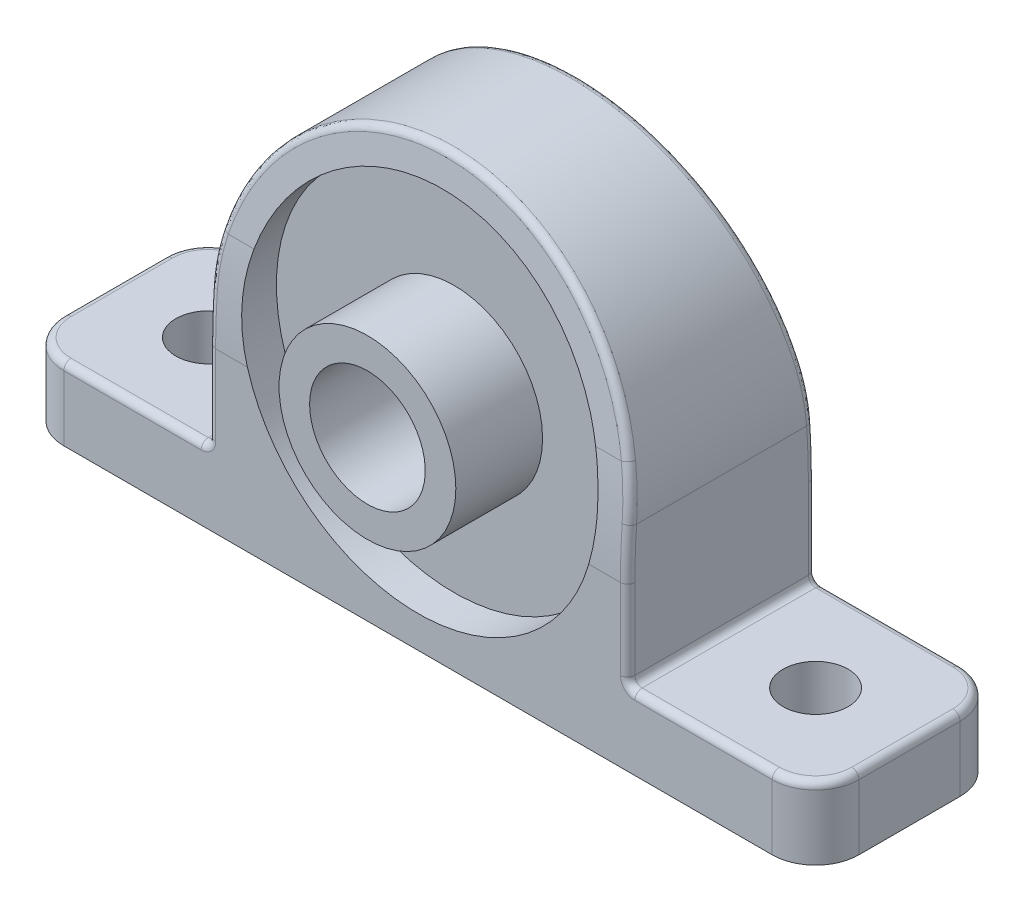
ISO-10303-21;
HEADER;
FILE_DESCRIPTION(('STEP AP214'),'2;1');
FILE_NAME('part.step','',(''),(''),'','','');
FILE_SCHEMA(('AUTOMOTIVE_DESIGN { 1 0 10303 214 1 1 1 1 }'));
ENDSEC;
DATA;
#1=APPLICATION_CONTEXT('core data for automotive mechanical design processes');
#2=APPLICATION_PROTOCOL_DEFINITION('international standard','automotive_design',2000,#1);
#3=PRODUCT_CONTEXT('',#1,'mechanical');
#4=PRODUCT('Part','Part','',(#3));
#5=PRODUCT_RELATED_PRODUCT_CATEGORY('part','',(#4));
#6=PRODUCT_DEFINITION_FORMATION('','',#4);
#7=PRODUCT_DEFINITION_CONTEXT('part definition',#1,'design');
#8=PRODUCT_DEFINITION('design','',#6,#7);
#9=PRODUCT_DEFINITION_SHAPE('','',#8);
#10=(LENGTH_UNIT() NAMED_UNIT(*) SI_UNIT(.MILLI.,.METRE.));
#11=(NAMED_UNIT(*) PLANE_ANGLE_UNIT() SI_UNIT($,.RADIAN.));
#12=(NAMED_UNIT(*) SI_UNIT($,.STERADIAN.) SOLID_ANGLE_UNIT());
#13=UNCERTAINTY_MEASURE_WITH_UNIT(LENGTH_MEASURE(1.E-05),#10,'distance_accuracy_value','');
#14=(GEOMETRIC_REPRESENTATION_CONTEXT(3) GLOBAL_UNCERTAINTY_ASSIGNED_CONTEXT((#13)) GLOBAL_UNIT_ASSIGNED_CONTEXT((#10,
#11,#12)) REPRESENTATION_CONTEXT('',''));
#15=CARTESIAN_POINT('',(0.,0.,0.));
#16=DIRECTION('',(0.,0.,1.));
#17=DIRECTION('',(1.,0.,0.));
#18=AXIS2_PLACEMENT_3D('',#15,#16,#17);
#19=CARTESIAN_POINT('',(27.5,14.5,2.5));
#20=DIRECTION('',(0.,0.,-1.));
#21=DIRECTION('',(-1.,0.,0.));
#22=AXIS2_PLACEMENT_3D('',#19,#20,#21);
#23=PLANE('',#22);
#24=CARTESIAN_POINT('',(27.5,14.5,2.5));
#25=DIRECTION('',(0.,0.,-1.));
#26=DIRECTION('',(-1.,0.,0.));
#27=AXIS2_PLACEMENT_3D('',#24,#25,#26);
#28=CIRCLE('',#27,12.2968264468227);
#29=CARTESIAN_POINT('',(15.2031735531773,14.5,2.5));
#30=VERTEX_POINT('',#29);
#31=EDGE_CURVE('E299',#30,#30,#28,.T.);
#32=ORIENTED_EDGE('',*,*,#31,.T.);
#33=EDGE_LOOP('',(#32));
#34=FACE_BOUND('',#33,.T.);
#35=CARTESIAN_POINT('',(27.5,14.5,2.5));
#36=DIRECTION('',(0.,0.,-1.));
#37=DIRECTION('',(-1.,0.,0.));
#38=AXIS2_PLACEMENT_3D('',#35,#36,#37);
#39=CIRCLE('',#38,6.11456548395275);
#40=CARTESIAN_POINT('',(21.3854345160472,14.5,2.5));
#41=VERTEX_POINT('',#40);
#42=EDGE_CURVE('E568',#41,#41,#39,.T.);
#43=ORIENTED_EDGE('',*,*,#42,.F.);
#44=EDGE_LOOP('',(#43));
#45=FACE_BOUND('',#44,.T.);
#46=ADVANCED_FACE('F44',(#34,#45),#23,.T.);
#47=CARTESIAN_POINT('',(27.5,14.5,10.5));
#48=DIRECTION('',(0.,0.,1.));
#49=DIRECTION('',(1.,0.,0.));
#50=AXIS2_PLACEMENT_3D('',#47,#48,#49);
#51=PLANE('',#50);
#52=CARTESIAN_POINT('',(27.5,14.5,10.5));
#53=DIRECTION('',(0.,0.,1.));
#54=DIRECTION('',(1.,0.,0.));
#55=AXIS2_PLACEMENT_3D('',#52,#53,#54);
#56=CIRCLE('',#55,12.2968264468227);
#57=CARTESIAN_POINT('',(39.7968264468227,14.5,10.5));
#58=VERTEX_POINT('',#57);
#59=EDGE_CURVE('E297',#58,#58,#56,.T.);
#60=ORIENTED_EDGE('',*,*,#59,.T.);
#61=EDGE_LOOP('',(#60));
#62=FACE_BOUND('',#61,.T.);
#63=CARTESIAN_POINT('',(27.5,14.5,10.5));
#64=DIRECTION('',(0.,0.,1.));
#65=DIRECTION('',(1.,0.,0.));
#66=AXIS2_PLACEMENT_3D('',#63,#64,#65);
#67=CIRCLE('',#66,6.11456548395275);
#68=CARTESIAN_POINT('',(33.6145654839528,14.5,10.5));
#69=VERTEX_POINT('',#68);
#70=EDGE_CURVE('E583',#69,#69,#67,.T.);
#71=ORIENTED_EDGE('',*,*,#70,.F.);
#72=EDGE_LOOP('',(#71));
#73=FACE_BOUND('',#72,.T.);
#74=ADVANCED_FACE('F335',(#62,#73),#51,.T.);
#75=CARTESIAN_POINT('',(27.5,14.5,13.));
#76=DIRECTION('',(0.,0.,-1.));
#77=DIRECTION('',(-1.,0.,0.));
#78=AXIS2_PLACEMENT_3D('',#75,#76,#77);
#79=CYLINDRICAL_SURFACE('',#78,4.00000000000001);
#80=CARTESIAN_POINT('',(27.5,14.5,16.5));
#81=DIRECTION('',(0.,0.,1.));
#82=DIRECTION('',(1.,0.,0.));
#83=AXIS2_PLACEMENT_3D('',#80,#81,#82);
#84=CIRCLE('',#83,4.);
#85=CARTESIAN_POINT('',(23.5,14.5,16.5));
#86=VERTEX_POINT('',#85);
#87=EDGE_CURVE('E577',#86,#86,#84,.T.);
#88=CARTESIAN_POINT('',(27.5,14.5,2.));
#89=DIRECTION('',(0.,0.,-1.));
#90=DIRECTION('',(-1.,0.,0.));
#91=AXIS2_PLACEMENT_3D('',#88,#89,#90);
#92=CIRCLE('',#91,4.00000000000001);
#93=CARTESIAN_POINT('',(23.5,14.5,2.));
#94=VERTEX_POINT('',#93);
#95=EDGE_CURVE('E566',#94,#94,#92,.T.);
#96=CARTESIAN_POINT('',(23.5,14.5,16.5));
#97=CARTESIAN_POINT('',(23.5,14.5,16.3489583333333));
#98=CARTESIAN_POINT('',(23.5,14.5,16.1979166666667));
#99=CARTESIAN_POINT('',(23.5,14.5,15.8958333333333));
#100=CARTESIAN_POINT('',(23.5,14.5,15.7447916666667));
#101=CARTESIAN_POINT('',(23.5,14.5,15.4427083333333));
#102=CARTESIAN_POINT('',(23.5,14.5,15.2916666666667));
#103=CARTESIAN_POINT('',(23.5,14.5,14.9895833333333));
#104=CARTESIAN_POINT('',(23.5,14.5,14.8385416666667));
#105=CARTESIAN_POINT('',(23.5,14.5,14.5364583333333));
#106=CARTESIAN_POINT('',(23.5,14.5,14.3854166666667));
#107=CARTESIAN_POINT('',(23.5,14.5,14.0833333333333));
#108=CARTESIAN_POINT('',(23.5,14.5,13.9322916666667));
#109=CARTESIAN_POINT('',(23.5,14.5,13.6302083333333));
#110=CARTESIAN_POINT('',(23.5,14.5,13.4791666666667));
#111=CARTESIAN_POINT('',(23.5,14.5,13.1770833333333));
#112=CARTESIAN_POINT('',(23.5,14.5,13.0260416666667));
#113=CARTESIAN_POINT('',(23.5,14.5,12.7239583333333));
#114=CARTESIAN_POINT('',(23.5,14.5,12.5729166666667));
#115=CARTESIAN_POINT('',(23.5,14.5,12.2708333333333));
#116=CARTESIAN_POINT('',(23.5,14.5,12.1197916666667));
#117=CARTESIAN_POINT('',(23.5,14.5,11.8177083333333));
#118=CARTESIAN_POINT('',(23.5,14.5,11.6666666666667));
#119=CARTESIAN_POINT('',(23.5,14.5,11.3645833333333));
#120=CARTESIAN_POINT('',(23.5,14.5,11.2135416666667));
#121=CARTESIAN_POINT('',(23.5,14.5,10.9114583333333));
#122=CARTESIAN_POINT('',(23.5,14.5,10.7604166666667));
#123=CARTESIAN_POINT('',(23.5,14.5,10.4583333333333));
#124=CARTESIAN_POINT('',(23.5,14.5,10.3072916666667));
#125=CARTESIAN_POINT('',(23.5,14.5,10.0052083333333));
#126=CARTESIAN_POINT('',(23.5,14.5,9.85416666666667));
#127=CARTESIAN_POINT('',(23.5,14.5,9.55208333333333));
#128=CARTESIAN_POINT('',(23.5,14.5,9.40104166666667));
#129=CARTESIAN_POINT('',(23.5,14.5,9.09895833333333));
#130=CARTESIAN_POINT('',(23.5,14.5,8.94791666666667));
#131=CARTESIAN_POINT('',(23.5,14.5,8.64583333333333));
#132=CARTESIAN_POINT('',(23.5,14.5,8.49479166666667));
#133=CARTESIAN_POINT('',(23.5,14.5,8.19270833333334));
#134=CARTESIAN_POINT('',(23.5,14.5,8.04166666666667));
#135=CARTESIAN_POINT('',(23.5,14.5,7.73958333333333));
#136=CARTESIAN_POINT('',(23.5,14.5,7.58854166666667));
#137=CARTESIAN_POINT('',(23.5,14.5,7.28645833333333));
#138=CARTESIAN_POINT('',(23.5,14.5,7.13541666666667));
#139=CARTESIAN_POINT('',(23.5,14.5,6.83333333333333));
#140=CARTESIAN_POINT('',(23.5,14.5,6.68229166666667));
#141=CARTESIAN_POINT('',(23.5,14.5,6.38020833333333));
#142=CARTESIAN_POINT('',(23.5,14.5,6.22916666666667));
#143=CARTESIAN_POINT('',(23.5,14.5,5.92708333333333));
#144=CARTESIAN_POINT('',(23.5,14.5,5.77604166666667));
#145=CARTESIAN_POINT('',(23.5,14.5,5.47395833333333));
#146=CARTESIAN_POINT('',(23.5,14.5,5.32291666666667));
#147=CARTESIAN_POINT('',(23.5,14.5,5.02083333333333));
#148=CARTESIAN_POINT('',(23.5,14.5,4.86979166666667));
#149=CARTESIAN_POINT('',(23.5,14.5,4.56770833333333));
#150=CARTESIAN_POINT('',(23.5,14.5,4.41666666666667));
#151=CARTESIAN_POINT('',(23.5,14.5,4.11458333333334));
#152=CARTESIAN_POINT('',(23.5,14.5,3.96354166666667));
#153=CARTESIAN_POINT('',(23.5,14.5,3.66145833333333));
#154=CARTESIAN_POINT('',(23.5,14.5,3.51041666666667));
#155=CARTESIAN_POINT('',(23.5,14.5,3.20833333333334));
#156=CARTESIAN_POINT('',(23.5,14.5,3.05729166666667));
#157=CARTESIAN_POINT('',(23.5,14.5,2.75520833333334));
#158=CARTESIAN_POINT('',(23.5,14.5,2.60416666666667));
#159=CARTESIAN_POINT('',(23.5,14.5,2.30208333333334));
#160=CARTESIAN_POINT('',(23.5,14.5,2.15104166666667));
#161=CARTESIAN_POINT('',(23.5,14.5,2.));
#162=B_SPLINE_CURVE_WITH_KNOTS('',3,(#96,#97,#98,#99,#100,#101,#102,#103,#104,#105,#106,#107,
#108,#109,#110,#111,#112,#113,#114,#115,#116,#117,#118,#119,#120,#121,#122,#123,#124,#125,#126,
#127,#128,#129,#130,#131,#132,#133,#134,#135,#136,#137,#138,#139,#140,#141,#142,#143,#144,#145,
#146,#147,#148,#149,#150,#151,#152,#153,#154,#155,#156,#157,#158,#159,#160,#161),.UNSPECIFIED.,
.F.,.F.,(4,2,2,2,2,2,2,2,2,2,2,2,2,2,2,2,2,2,2,2,2,2,2,2,2,2,2,2,2,2,2,2,4),(0.,
0.453124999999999,0.906249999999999,1.359375,1.8125,2.265625,2.71875,3.171875,3.625,4.078125,
4.53125,4.984375,5.4375,5.890625,6.34375,6.796875,7.25,7.703125,8.15625,8.60937499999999,9.0625,
9.515625,9.96875,10.421875,10.875,11.328125,11.78125,12.234375,12.6875,13.140625,13.59375,
14.046875,14.5),.UNSPECIFIED.);
#163=EDGE_CURVE('BSEAM331',#86,#94,#162,.T.);
#164=ORIENTED_EDGE('',*,*,#87,.T.);
#165=ORIENTED_EDGE('',*,*,#95,.T.);
#166=ORIENTED_EDGE('',*,*,#163,.T.);
#167=ORIENTED_EDGE('',*,*,#163,.F.);
#168=EDGE_LOOP('',(#164,#166,#165,#167));
#169=FACE_BOUND('',#168,.T.);
#170=ADVANCED_FACE('F331',(#169),#79,.F.);
#171=CARTESIAN_POINT('',(27.5,14.5,13.));
#172=DIRECTION('',(0.,0.,-1.));
#173=DIRECTION('',(-1.,0.,0.));
#174=AXIS2_PLACEMENT_3D('',#171,#172,#173);
#175=PLANE('',#174);
#176=CARTESIAN_POINT('',(12.5,5.5,13.));
#177=DIRECTION('',(0.,0.,-1.));
#178=DIRECTION('',(-1.,0.,0.));
#179=AXIS2_PLACEMENT_3D('',#176,#177,#178);
#180=CIRCLE('',#179,1.);
#181=CARTESIAN_POINT('',(12.5,4.5,13.));
#182=VERTEX_POINT('',#181);
#183=CARTESIAN_POINT('',(13.5,5.5,13.));
#184=VERTEX_POINT('',#183);
#185=EDGE_CURVE('E856',#182,#184,#180,.F.);
#186=ORIENTED_EDGE('',*,*,#185,.F.);
#187=DIRECTION('',(-1.,0.,0.));
#188=VECTOR('',#187,1.);
#189=CARTESIAN_POINT('',(27.5,4.50000000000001,13.));
#190=LINE('',#189,#188);
#191=CARTESIAN_POINT('',(3.,4.5,13.));
#192=VERTEX_POINT('',#191);
#193=EDGE_CURVE('E861',#182,#192,#190,.T.);
#194=ORIENTED_EDGE('',*,*,#193,.T.);
#195=DIRECTION('',(0.,-1.,0.));
#196=VECTOR('',#195,1.);
#197=CARTESIAN_POINT('',(3.00000000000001,14.5,13.));
#198=LINE('',#197,#196);
#199=CARTESIAN_POINT('',(3.,0.,13.));
#200=VERTEX_POINT('',#199);
#201=EDGE_CURVE('E930',#192,#200,#198,.T.);
#202=ORIENTED_EDGE('',*,*,#201,.T.);
#203=DIRECTION('',(1.,0.,0.));
#204=VECTOR('',#203,1.);
#205=CARTESIAN_POINT('',(55.,0.,13.));
#206=LINE('',#205,#204);
#207=CARTESIAN_POINT('',(52.,0.,13.));
#208=VERTEX_POINT('',#207);
#209=EDGE_CURVE('E602',#200,#208,#206,.T.);
#210=ORIENTED_EDGE('',*,*,#209,.T.);
#211=DIRECTION('',(0.,1.,0.));
#212=VECTOR('',#211,1.);
#213=CARTESIAN_POINT('',(52.,14.5,13.));
#214=LINE('',#213,#212);
#215=CARTESIAN_POINT('',(52.,4.49999999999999,13.));
#216=VERTEX_POINT('',#215);
#217=EDGE_CURVE('E927',#208,#216,#214,.T.);
#218=ORIENTED_EDGE('',*,*,#217,.T.);
#219=DIRECTION('',(-1.,0.,0.));
#220=VECTOR('',#219,1.);
#221=CARTESIAN_POINT('',(27.5,4.50000000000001,13.));
#222=LINE('',#221,#220);
#223=CARTESIAN_POINT('',(42.5,4.5,13.));
#224=VERTEX_POINT('',#223);
#225=EDGE_CURVE('E858',#216,#224,#222,.T.);
#226=ORIENTED_EDGE('',*,*,#225,.T.);
#227=CARTESIAN_POINT('',(42.5,5.5,13.));
#228=DIRECTION('',(0.,0.,-1.));
#229=DIRECTION('',(-1.,0.,0.));
#230=AXIS2_PLACEMENT_3D('',#227,#228,#229);
#231=CIRCLE('',#230,1.);
#232=CARTESIAN_POINT('',(41.5,5.5,13.));
#233=VERTEX_POINT('',#232);
#234=EDGE_CURVE('E854',#233,#224,#231,.F.);
#235=ORIENTED_EDGE('',*,*,#234,.F.);
#236=DIRECTION('',(0.,1.,0.));
#237=VECTOR('',#236,1.);
#238=CARTESIAN_POINT('',(41.5,14.5,13.));
#239=LINE('',#238,#237);
#240=CARTESIAN_POINT('',(41.5,11.0679707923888,13.));
#241=VERTEX_POINT('',#240);
#242=EDGE_CURVE('E851',#233,#241,#239,.T.);
#243=ORIENTED_EDGE('',*,*,#242,.T.);
#244=DIRECTION('',(-1.,0.,0.));
#245=VECTOR('',#244,1.);
#246=CARTESIAN_POINT('',(27.5,11.0679707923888,13.));
#247=LINE('',#246,#245);
#248=CARTESIAN_POINT('',(39.3081800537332,11.0679707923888,13.));
#249=VERTEX_POINT('',#248);
#250=EDGE_CURVE('E292',#241,#249,#247,.T.);
#251=ORIENTED_EDGE('',*,*,#250,.T.);
#252=CARTESIAN_POINT('',(27.5,14.5,13.));
#253=DIRECTION('',(0.,0.,1.));
#254=DIRECTION('',(1.,0.,0.));
#255=AXIS2_PLACEMENT_3D('',#252,#253,#254);
#256=CIRCLE('',#255,12.2968264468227);
#257=CARTESIAN_POINT('',(15.6918199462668,11.0679707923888,13.));
#258=VERTEX_POINT('',#257);
#259=EDGE_CURVE('E282',#258,#249,#256,.T.);
#260=ORIENTED_EDGE('',*,*,#259,.F.);
#261=DIRECTION('',(-1.,0.,0.));
#262=VECTOR('',#261,1.);
#263=CARTESIAN_POINT('',(27.5,11.0679707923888,13.));
#264=LINE('',#263,#262);
#265=CARTESIAN_POINT('',(13.5,11.0679707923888,13.));
#266=VERTEX_POINT('',#265);
#267=EDGE_CURVE('E298',#258,#266,#264,.T.);
#268=ORIENTED_EDGE('',*,*,#267,.T.);
#269=DIRECTION('',(0.,-1.,0.));
#270=VECTOR('',#269,1.);
#271=CARTESIAN_POINT('',(13.5,14.5,13.));
#272=LINE('',#271,#270);
#273=EDGE_CURVE('E863',#266,#184,#272,.T.);
#274=ORIENTED_EDGE('',*,*,#273,.T.);
#275=EDGE_LOOP('',(#186,#194,#202,#210,#218,#226,#235,#243,#251,#260,#268,#274));
#276=FACE_BOUND('',#275,.T.);
#277=ADVANCED_FACE('F293',(#276),#175,.F.);
#278=CARTESIAN_POINT('',(27.5,14.5,0.));
#279=DIRECTION('',(0.,0.,-1.));
#280=DIRECTION('',(-1.,0.,0.));
#281=AXIS2_PLACEMENT_3D('',#278,#279,#280);
#282=PLANE('',#281);
#283=CARTESIAN_POINT('',(42.5,5.5,0.));
#284=DIRECTION('',(0.,0.,-1.));
#285=DIRECTION('',(-1.,0.,0.));
#286=AXIS2_PLACEMENT_3D('',#283,#284,#285);
#287=CIRCLE('',#286,1.);
#288=CARTESIAN_POINT('',(42.5,4.5,0.));
#289=VERTEX_POINT('',#288);
#290=CARTESIAN_POINT('',(41.5,5.5,0.));
#291=VERTEX_POINT('',#290);
#292=EDGE_CURVE('E844',#289,#291,#287,.T.);
#293=ORIENTED_EDGE('',*,*,#292,.F.);
#294=DIRECTION('',(-1.,0.,0.));
#295=VECTOR('',#294,1.);
#296=CARTESIAN_POINT('',(52.,4.5,0.));
#297=LINE('',#296,#295);
#298=CARTESIAN_POINT('',(52.,4.5,0.));
#299=VERTEX_POINT('',#298);
#300=EDGE_CURVE('E847',#289,#299,#297,.F.);
#301=ORIENTED_EDGE('',*,*,#300,.T.);
#302=DIRECTION('',(0.,1.,0.));
#303=VECTOR('',#302,1.);
#304=CARTESIAN_POINT('',(52.,0.,0.));
#305=LINE('',#304,#303);
#306=CARTESIAN_POINT('',(52.,0.,0.));
#307=VERTEX_POINT('',#306);
#308=EDGE_CURVE('E916',#299,#307,#305,.F.);
#309=ORIENTED_EDGE('',*,*,#308,.T.);
#310=DIRECTION('',(1.,0.,0.));
#311=VECTOR('',#310,1.);
#312=CARTESIAN_POINT('',(55.,0.,0.));
#313=LINE('',#312,#311);
#314=CARTESIAN_POINT('',(3.,0.,0.));
#315=VERTEX_POINT('',#314);
#316=EDGE_CURVE('E601',#315,#307,#313,.T.);
#317=ORIENTED_EDGE('',*,*,#316,.F.);
#318=DIRECTION('',(0.,-1.,0.));
#319=VECTOR('',#318,1.);
#320=CARTESIAN_POINT('',(3.,4.99999999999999,0.));
#321=LINE('',#320,#319);
#322=CARTESIAN_POINT('',(3.,4.5,0.));
#323=VERTEX_POINT('',#322);
#324=EDGE_CURVE('E910',#315,#323,#321,.F.);
#325=ORIENTED_EDGE('',*,*,#324,.T.);
#326=DIRECTION('',(-1.,0.,0.));
#327=VECTOR('',#326,1.);
#328=CARTESIAN_POINT('',(13.,4.5,0.));
#329=LINE('',#328,#327);
#330=CARTESIAN_POINT('',(12.5,4.5,0.));
#331=VERTEX_POINT('',#330);
#332=EDGE_CURVE('E845',#323,#331,#329,.F.);
#333=ORIENTED_EDGE('',*,*,#332,.T.);
#334=CARTESIAN_POINT('',(12.5,5.5,0.));
#335=DIRECTION('',(0.,0.,-1.));
#336=DIRECTION('',(-1.,0.,0.));
#337=AXIS2_PLACEMENT_3D('',#334,#335,#336);
#338=CIRCLE('',#337,1.);
#339=CARTESIAN_POINT('',(13.5,5.5,0.));
#340=VERTEX_POINT('',#339);
#341=EDGE_CURVE('E836',#340,#331,#338,.T.);
#342=ORIENTED_EDGE('',*,*,#341,.F.);
#343=DIRECTION('',(0.,-1.,0.));
#344=VECTOR('',#343,1.);
#345=CARTESIAN_POINT('',(13.5,11.0679707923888,0.));
#346=LINE('',#345,#344);
#347=CARTESIAN_POINT('',(13.5,11.0679707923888,0.));
#348=VERTEX_POINT('',#347);
#349=EDGE_CURVE('E839',#340,#348,#346,.F.);
#350=ORIENTED_EDGE('',*,*,#349,.T.);
#351=DIRECTION('',(-1.,0.,0.));
#352=VECTOR('',#351,1.);
#353=CARTESIAN_POINT('',(15.2031735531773,11.0679707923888,0.));
#354=LINE('',#353,#352);
#355=CARTESIAN_POINT('',(15.6918199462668,11.0679707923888,0.));
#356=VERTEX_POINT('',#355);
#357=EDGE_CURVE('E911',#348,#356,#354,.F.);
#358=ORIENTED_EDGE('',*,*,#357,.T.);
#359=CARTESIAN_POINT('',(27.5,14.5,0.));
#360=DIRECTION('',(0.,0.,-1.));
#361=DIRECTION('',(-1.,0.,0.));
#362=AXIS2_PLACEMENT_3D('',#359,#360,#361);
#363=CIRCLE('',#362,12.2968264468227);
#364=CARTESIAN_POINT('',(39.3081800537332,11.0679707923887,0.));
#365=VERTEX_POINT('',#364);
#366=EDGE_CURVE('E596',#365,#356,#363,.T.);
#367=ORIENTED_EDGE('',*,*,#366,.F.);
#368=DIRECTION('',(-1.,0.,0.));
#369=VECTOR('',#368,1.);
#370=CARTESIAN_POINT('',(42.,11.0679707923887,0.));
#371=LINE('',#370,#369);
#372=CARTESIAN_POINT('',(41.5,11.0679707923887,0.));
#373=VERTEX_POINT('',#372);
#374=EDGE_CURVE('E907',#365,#373,#371,.F.);
#375=ORIENTED_EDGE('',*,*,#374,.T.);
#376=DIRECTION('',(0.,1.,0.));
#377=VECTOR('',#376,1.);
#378=CARTESIAN_POINT('',(41.5,5.,0.));
#379=LINE('',#378,#377);
#380=EDGE_CURVE('E850',#373,#291,#379,.F.);
#381=ORIENTED_EDGE('',*,*,#380,.T.);
#382=EDGE_LOOP('',(#293,#301,#309,#317,#325,#333,#342,#350,#358,#367,#375,#381));
#383=FACE_BOUND('',#382,.T.);
#384=ADVANCED_FACE('F342',(#383),#282,.T.);
#385=CARTESIAN_POINT('',(55.,0.,13.));
#386=DIRECTION('',(0.,1.,0.));
#387=DIRECTION('',(0.,0.,1.));
#388=AXIS2_PLACEMENT_3D('',#385,#386,#387);
#389=PLANE('',#388);
#390=CARTESIAN_POINT('',(6.5,0.,6.5));
#391=DIRECTION('',(0.,-1.,0.));
#392=DIRECTION('',(0.,0.,-1.));
#393=AXIS2_PLACEMENT_3D('',#390,#391,#392);
#394=CIRCLE('',#393,2.25);
#395=CARTESIAN_POINT('',(6.5,0.,4.25));
#396=VERTEX_POINT('',#395);
#397=EDGE_CURVE('E586',#396,#396,#394,.T.);
#398=ORIENTED_EDGE('',*,*,#397,.F.);
#399=EDGE_LOOP('',(#398));
#400=FACE_BOUND('',#399,.T.);
#401=CARTESIAN_POINT('',(48.5,0.,6.5));
#402=DIRECTION('',(0.,-1.,0.));
#403=DIRECTION('',(0.,0.,-1.));
#404=AXIS2_PLACEMENT_3D('',#401,#402,#403);
#405=CIRCLE('',#404,2.25);
#406=CARTESIAN_POINT('',(48.5,0.,4.25));
#407=VERTEX_POINT('',#406);
#408=EDGE_CURVE('E584',#407,#407,#405,.T.);
#409=ORIENTED_EDGE('',*,*,#408,.F.);
#410=EDGE_LOOP('',(#409));
#411=FACE_BOUND('',#410,.T.);
#412=ORIENTED_EDGE('',*,*,#316,.T.);
#413=CARTESIAN_POINT('',(52.,0.,3.));
#414=DIRECTION('',(0.,1.,0.));
#415=DIRECTION('',(0.,0.,1.));
#416=AXIS2_PLACEMENT_3D('',#413,#414,#415);
#417=CIRCLE('',#416,3.);
#418=CARTESIAN_POINT('',(55.,0.,3.));
#419=VERTEX_POINT('',#418);
#420=EDGE_CURVE('E924',#307,#419,#417,.F.);
#421=ORIENTED_EDGE('',*,*,#420,.T.);
#422=DIRECTION('',(0.,0.,-1.));
#423=VECTOR('',#422,1.);
#424=CARTESIAN_POINT('',(55.,0.,13.));
#425=LINE('',#424,#423);
#426=CARTESIAN_POINT('',(55.,0.,10.));
#427=VERTEX_POINT('',#426);
#428=EDGE_CURVE('E614',#427,#419,#425,.T.);
#429=ORIENTED_EDGE('',*,*,#428,.F.);
#430=CARTESIAN_POINT('',(52.,0.,10.));
#431=DIRECTION('',(0.,1.,0.));
#432=DIRECTION('',(0.,0.,1.));
#433=AXIS2_PLACEMENT_3D('',#430,#431,#432);
#434=CIRCLE('',#433,3.);
#435=EDGE_CURVE('E901',#427,#208,#434,.F.);
#436=ORIENTED_EDGE('',*,*,#435,.T.);
#437=ORIENTED_EDGE('',*,*,#209,.F.);
#438=CARTESIAN_POINT('',(3.,0.,10.));
#439=DIRECTION('',(0.,1.,0.));
#440=DIRECTION('',(0.,0.,1.));
#441=AXIS2_PLACEMENT_3D('',#438,#439,#440);
#442=CIRCLE('',#441,3.);
#443=CARTESIAN_POINT('',(0.,0.,10.));
#444=VERTEX_POINT('',#443);
#445=EDGE_CURVE('E925',#200,#444,#442,.F.);
#446=ORIENTED_EDGE('',*,*,#445,.T.);
#447=DIRECTION('',(0.,0.,-1.));
#448=VECTOR('',#447,1.);
#449=CARTESIAN_POINT('',(0.,0.,13.));
#450=LINE('',#449,#448);
#451=CARTESIAN_POINT('',(0.,0.,3.));
#452=VERTEX_POINT('',#451);
#453=EDGE_CURVE('E607',#444,#452,#450,.T.);
#454=ORIENTED_EDGE('',*,*,#453,.T.);
#455=CARTESIAN_POINT('',(3.,0.,3.));
#456=DIRECTION('',(0.,1.,0.));
#457=DIRECTION('',(0.,0.,1.));
#458=AXIS2_PLACEMENT_3D('',#455,#456,#457);
#459=CIRCLE('',#458,3.);
#460=EDGE_CURVE('E917',#452,#315,#459,.F.);
#461=ORIENTED_EDGE('',*,*,#460,.T.);
#462=EDGE_LOOP('',(#412,#421,#429,#436,#437,#446,#454,#461));
#463=FACE_BOUND('',#462,.T.);
#464=ADVANCED_FACE('F341',(#400,#411,#463),#389,.F.);
#465=CARTESIAN_POINT('',(55.,0.,13.));
#466=DIRECTION('',(-1.,0.,0.));
#467=DIRECTION('',(0.,-1.,0.));
#468=AXIS2_PLACEMENT_3D('',#465,#466,#467);
#469=PLANE('',#468);
#470=DIRECTION('',(0.,1.,0.));
#471=VECTOR('',#470,1.);
#472=CARTESIAN_POINT('',(55.,4.99999999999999,3.));
#473=LINE('',#472,#471);
#474=CARTESIAN_POINT('',(55.,4.49999999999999,3.));
#475=VERTEX_POINT('',#474);
#476=EDGE_CURVE('E906',#419,#475,#473,.T.);
#477=ORIENTED_EDGE('',*,*,#476,.T.);
#478=DIRECTION('',(0.,0.,-1.));
#479=VECTOR('',#478,1.);
#480=CARTESIAN_POINT('',(55.,4.49999999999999,13.));
#481=LINE('',#480,#479);
#482=CARTESIAN_POINT('',(55.,4.49999999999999,10.));
#483=VERTEX_POINT('',#482);
#484=EDGE_CURVE('E817',#475,#483,#481,.F.);
#485=ORIENTED_EDGE('',*,*,#484,.T.);
#486=DIRECTION('',(0.,1.,0.));
#487=VECTOR('',#486,1.);
#488=CARTESIAN_POINT('',(55.,0.,10.));
#489=LINE('',#488,#487);
#490=EDGE_CURVE('E898',#483,#427,#489,.F.);
#491=ORIENTED_EDGE('',*,*,#490,.T.);
#492=ORIENTED_EDGE('',*,*,#428,.T.);
#493=EDGE_LOOP('',(#477,#485,#491,#492));
#494=FACE_BOUND('',#493,.T.);
#495=ADVANCED_FACE('F1016',(#494),#469,.F.);
#496=CARTESIAN_POINT('',(55.,4.99999999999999,13.));
#497=DIRECTION('',(0.,-1.,0.));
#498=DIRECTION('',(1.,0.,0.));
#499=AXIS2_PLACEMENT_3D('',#496,#497,#498);
#500=PLANE('',#499);
#501=CARTESIAN_POINT('',(52.,4.99999999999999,10.));
#502=DIRECTION('',(0.,-1.,0.));
#503=DIRECTION('',(1.,0.,0.));
#504=AXIS2_PLACEMENT_3D('',#501,#502,#503);
#505=CIRCLE('',#504,2.5);
#506=CARTESIAN_POINT('',(52.,4.99999999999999,12.5));
#507=VERTEX_POINT('',#506);
#508=CARTESIAN_POINT('',(54.5,4.99999999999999,10.));
#509=VERTEX_POINT('',#508);
#510=EDGE_CURVE('E813',#507,#509,#505,.F.);
#511=ORIENTED_EDGE('',*,*,#510,.T.);
#512=DIRECTION('',(0.,0.,-1.));
#513=VECTOR('',#512,1.);
#514=CARTESIAN_POINT('',(54.5,4.99999999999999,13.));
#515=LINE('',#514,#513);
#516=CARTESIAN_POINT('',(54.5,4.99999999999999,3.));
#517=VERTEX_POINT('',#516);
#518=EDGE_CURVE('E825',#509,#517,#515,.T.);
#519=ORIENTED_EDGE('',*,*,#518,.T.);
#520=CARTESIAN_POINT('',(52.,4.99999999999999,3.));
#521=DIRECTION('',(0.,-1.,0.));
#522=DIRECTION('',(1.,0.,0.));
#523=AXIS2_PLACEMENT_3D('',#520,#521,#522);
#524=CIRCLE('',#523,2.5);
#525=CARTESIAN_POINT('',(52.,4.99999999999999,0.5));
#526=VERTEX_POINT('',#525);
#527=EDGE_CURVE('E823',#517,#526,#524,.F.);
#528=ORIENTED_EDGE('',*,*,#527,.T.);
#529=DIRECTION('',(-1.,0.,0.));
#530=VECTOR('',#529,1.);
#531=CARTESIAN_POINT('',(42.,5.,0.5));
#532=LINE('',#531,#530);
#533=CARTESIAN_POINT('',(42.5,5.,0.5));
#534=VERTEX_POINT('',#533);
#535=EDGE_CURVE('E958',#526,#534,#532,.T.);
#536=ORIENTED_EDGE('',*,*,#535,.T.);
#537=DIRECTION('',(0.,0.,-1.));
#538=VECTOR('',#537,1.);
#539=CARTESIAN_POINT('',(42.5,5.,13.));
#540=LINE('',#539,#538);
#541=CARTESIAN_POINT('',(42.5,5.,12.5));
#542=VERTEX_POINT('',#541);
#543=EDGE_CURVE('E955',#534,#542,#540,.F.);
#544=ORIENTED_EDGE('',*,*,#543,.T.);
#545=DIRECTION('',(-1.,0.,0.));
#546=VECTOR('',#545,1.);
#547=CARTESIAN_POINT('',(55.,4.99999999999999,12.5));
#548=LINE('',#547,#546);
#549=EDGE_CURVE('E954',#542,#507,#548,.F.);
#550=ORIENTED_EDGE('',*,*,#549,.T.);
#551=EDGE_LOOP('',(#511,#519,#528,#536,#544,#550));
#552=FACE_BOUND('',#551,.T.);
#553=CARTESIAN_POINT('',(48.5,5.,6.5));
#554=DIRECTION('',(0.,-1.,0.));
#555=DIRECTION('',(1.,0.,0.));
#556=AXIS2_PLACEMENT_3D('',#553,#554,#555);
#557=CIRCLE('',#556,2.25);
#558=CARTESIAN_POINT('',(50.75,5.,6.5));
#559=VERTEX_POINT('',#558);
#560=EDGE_CURVE('E597',#559,#559,#557,.T.);
#561=ORIENTED_EDGE('',*,*,#560,.T.);
#562=EDGE_LOOP('',(#561));
#563=FACE_BOUND('',#562,.T.);
#564=ADVANCED_FACE('F960',(#552,#563),#500,.F.);
#565=CARTESIAN_POINT('',(42.,5.,13.));
#566=DIRECTION('',(-1.,0.,0.));
#567=DIRECTION('',(0.,0.,1.));
#568=AXIS2_PLACEMENT_3D('',#565,#566,#567);
#569=PLANE('',#568);
#570=DIRECTION('',(0.,1.,0.));
#571=VECTOR('',#570,1.);
#572=CARTESIAN_POINT('',(42.,11.0679707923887,0.5));
#573=LINE('',#572,#571);
#574=CARTESIAN_POINT('',(42.,5.5,0.5));
#575=VERTEX_POINT('',#574);
#576=CARTESIAN_POINT('',(42.,11.0679707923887,0.5));
#577=VERTEX_POINT('',#576);
#578=EDGE_CURVE('E867',#575,#577,#573,.T.);
#579=ORIENTED_EDGE('',*,*,#578,.T.);
#580=CARTESIAN_POINT('',(42.,11.0679707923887,50.));
#581=DIRECTION('',(-1.,0.,0.));
#582=DIRECTION('',(0.,0.,1.));
#583=AXIS2_PLACEMENT_3D('',#580,#581,#582);
#584=CIRCLE('',#583,49.5);
#585=CARTESIAN_POINT('',(42.,14.5,0.619121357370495));
#586=VERTEX_POINT('',#585);
#587=EDGE_CURVE('E872',#577,#586,#584,.F.);
#588=ORIENTED_EDGE('',*,*,#587,.T.);
#589=DIRECTION('',(0.,0.,-1.));
#590=VECTOR('',#589,1.);
#591=CARTESIAN_POINT('',(42.,14.5,13.));
#592=LINE('',#591,#590);
#593=CARTESIAN_POINT('',(42.,14.5,12.3808786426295));
#594=VERTEX_POINT('',#593);
#595=EDGE_CURVE('E611',#594,#586,#592,.T.);
#596=ORIENTED_EDGE('',*,*,#595,.F.);
#597=CARTESIAN_POINT('',(42.,11.0679707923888,-37.));
#598=DIRECTION('',(-1.,0.,0.));
#599=DIRECTION('',(0.,0.,1.));
#600=AXIS2_PLACEMENT_3D('',#597,#598,#599);
#601=CIRCLE('',#600,49.5);
#602=CARTESIAN_POINT('',(42.,11.0679707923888,12.5));
#603=VERTEX_POINT('',#602);
#604=EDGE_CURVE('E875',#594,#603,#601,.F.);
#605=ORIENTED_EDGE('',*,*,#604,.T.);
#606=DIRECTION('',(0.,1.,0.));
#607=VECTOR('',#606,1.);
#608=CARTESIAN_POINT('',(42.,5.,12.5));
#609=LINE('',#608,#607);
#610=CARTESIAN_POINT('',(42.,5.5,12.5));
#611=VERTEX_POINT('',#610);
#612=EDGE_CURVE('E870',#603,#611,#609,.F.);
#613=ORIENTED_EDGE('',*,*,#612,.T.);
#614=DIRECTION('',(0.,0.,-1.));
#615=VECTOR('',#614,1.);
#616=CARTESIAN_POINT('',(42.,5.5,0.));
#617=LINE('',#616,#615);
#618=EDGE_CURVE('E862',#611,#575,#617,.T.);
#619=ORIENTED_EDGE('',*,*,#618,.T.);
#620=EDGE_LOOP('',(#579,#588,#596,#605,#613,#619));
#621=FACE_BOUND('',#620,.T.);
#622=ADVANCED_FACE('F363',(#621),#569,.F.);
#623=CARTESIAN_POINT('',(27.5,14.5,13.));
#624=DIRECTION('',(0.,0.,-1.));
#625=DIRECTION('',(-1.,0.,0.));
#626=AXIS2_PLACEMENT_3D('',#623,#624,#625);
#627=CYLINDRICAL_SURFACE('',#626,14.5);
#628=ORIENTED_EDGE('',*,*,#595,.T.);
#629=CARTESIAN_POINT('',(39.6265818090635,22.4495920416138,1.76232279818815));
#630=CARTESIAN_POINT('',(39.5807740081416,22.5194688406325,1.32845005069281));
#631=CARTESIAN_POINT('',(39.2084238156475,22.2876651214,1.27507353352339));
#632=CARTESIAN_POINT('',(39.8511052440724,22.1071523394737,1.68616050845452));
#633=CARTESIAN_POINT('',(39.8083567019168,22.1766243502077,1.24779483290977));
#634=CARTESIAN_POINT('',(39.4252050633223,21.9536939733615,1.19814192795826));
#635=CARTESIAN_POINT('',(40.0612418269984,21.7549085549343,1.61145506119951));
#636=CARTESIAN_POINT('',(40.0206622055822,21.8251353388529,1.16898562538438));
#637=CARTESIAN_POINT('',(39.6280955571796,21.6101611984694,1.1226818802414));
#638=CARTESIAN_POINT('',(40.4513801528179,21.0329890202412,1.46636794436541));
#639=CARTESIAN_POINT('',(40.415761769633,21.1037936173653,1.01572066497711));
#640=CARTESIAN_POINT('',(40.0047808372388,20.9060947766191,0.976129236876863));
#641=CARTESIAN_POINT('',(40.6313681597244,20.6633054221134,1.39598825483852));
#642=CARTESIAN_POINT('',(40.5982125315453,20.7339755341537,0.941339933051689));
#643=CARTESIAN_POINT('',(40.1785623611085,20.5455534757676,0.905038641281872));
#644=CARTESIAN_POINT('',(40.9592422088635,19.9099154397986,1.26119874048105));
#645=CARTESIAN_POINT('',(40.9314355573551,19.9793514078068,0.798726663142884));
#646=CARTESIAN_POINT('',(40.4951304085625,19.8107948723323,0.768887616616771));
#647=CARTESIAN_POINT('',(41.1072052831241,19.5262453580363,1.1967748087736));
#648=CARTESIAN_POINT('',(41.0819438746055,19.5947327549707,0.730572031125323));
#649=CARTESIAN_POINT('',(40.6379913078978,19.4366129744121,0.703812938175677));
#650=CARTESIAN_POINT('',(41.3702433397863,18.7468240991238,1.07497489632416));
#651=CARTESIAN_POINT('',(41.350309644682,18.8122971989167,0.601592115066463));
#652=CARTESIAN_POINT('',(40.8919590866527,18.6764668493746,0.580782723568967));
#653=CARTESIAN_POINT('',(41.4853303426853,18.3510773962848,1.01759634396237));
#654=CARTESIAN_POINT('',(41.4678473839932,18.4147548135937,0.540869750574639));
#655=CARTESIAN_POINT('',(41.00307757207,18.2905069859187,0.522824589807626));
#656=CARTESIAN_POINT('',(41.7211641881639,17.3884455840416,0.889407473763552));
#657=CARTESIAN_POINT('',(41.7098698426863,17.445391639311,0.404984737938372));
#658=CARTESIAN_POINT('',(41.2307792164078,17.3516811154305,0.393340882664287));
#659=CARTESIAN_POINT('',(41.8254885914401,16.8168852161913,0.822507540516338));
#660=CARTESIAN_POINT('',(41.8169880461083,16.870320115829,0.334332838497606));
#661=CARTESIAN_POINT('',(41.3315062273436,16.7942554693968,0.325765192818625));
#662=CARTESIAN_POINT('',(41.9648818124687,15.6637141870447,0.70690397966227));
#663=CARTESIAN_POINT('',(41.9616167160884,15.7076915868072,0.212275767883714));
#664=CARTESIAN_POINT('',(41.4660927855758,15.669602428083,0.20899391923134));
#665=CARTESIAN_POINT('',(41.9999899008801,15.0821094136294,0.658190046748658));
#666=CARTESIAN_POINT('',(41.9986070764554,15.1215458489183,0.161118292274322));
#667=CARTESIAN_POINT('',(41.4999902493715,15.1023807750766,0.159787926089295));
#668=CARTESIAN_POINT('',(42.0000068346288,14.1060546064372,0.59268143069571));
#669=CARTESIAN_POINT('',(42.0009448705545,14.1365657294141,0.0926527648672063));
#670=CARTESIAN_POINT('',(41.5000065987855,14.1504638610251,0.093617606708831));
#671=CARTESIAN_POINT('',(41.9839388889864,13.7118780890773,0.570658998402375));
#672=CARTESIAN_POINT('',(41.9855024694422,13.7387424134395,0.06979424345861));
#673=CARTESIAN_POINT('',(41.4844927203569,13.7660353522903,0.071372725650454));
#674=CARTESIAN_POINT('',(41.9196661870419,12.9255780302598,0.535477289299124));
#675=CARTESIAN_POINT('',(41.921855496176,12.9446220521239,0.0336211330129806));
#676=CARTESIAN_POINT('',(41.4224363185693,12.9991805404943,0.035835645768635));
#677=CARTESIAN_POINT('',(41.8714533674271,12.5334550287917,0.522320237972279));
#678=CARTESIAN_POINT('',(41.8736620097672,12.5488260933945,0.0203377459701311));
#679=CARTESIAN_POINT('',(41.3758860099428,12.6167547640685,0.0225456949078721));
#680=CARTESIAN_POINT('',(41.7428414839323,11.7525092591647,0.504693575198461));
#681=CARTESIAN_POINT('',(41.7444332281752,11.7602078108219,0.00314361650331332));
#682=CARTESIAN_POINT('',(41.2517090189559,11.8551218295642,0.00474098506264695));
#683=CARTESIAN_POINT('',(41.6622983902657,11.3637093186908,0.500263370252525));
#684=CARTESIAN_POINT('',(41.6633507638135,11.3678905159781,-0.000719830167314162));
#685=CARTESIAN_POINT('',(41.1739432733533,11.4759369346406,0.000266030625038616));
#686=CARTESIAN_POINT('',(41.4696602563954,10.5940678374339,0.499757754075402));
#687=CARTESIAN_POINT('',(41.4689371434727,10.5912019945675,0.000581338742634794));
#688=CARTESIAN_POINT('',(40.9879478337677,10.7253287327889,-0.000244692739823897));
#689=CARTESIAN_POINT('',(41.357570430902,10.2132249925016,0.503680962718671));
#690=CARTESIAN_POINT('',(41.3557809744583,10.2072611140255,0.00572746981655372));
#691=CARTESIAN_POINT('',(40.8797231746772,10.3539041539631,0.00371814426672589));
#692=CARTESIAN_POINT('',(41.230010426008,9.83772440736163,0.511554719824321));
#693=CARTESIAN_POINT('',(41.2267440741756,9.82810527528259,0.0151201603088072));
#694=CARTESIAN_POINT('',(40.7565617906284,9.98768972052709,0.0116714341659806));
#695=(BOUNDED_SURFACE() B_SPLINE_SURFACE(3,2,((#629,#630,#631),(#632,#633,#634),(#635,#636,
#637),(#638,#639,#640),(#641,#642,#643),(#644,#645,#646),(#647,#648,#649),(#650,#651,#652),
(#653,#654,#655),(#656,#657,#658),(#659,#660,#661),(#662,#663,#664),(#665,#666,#667),(#668,#669,
#670),(#671,#672,#673),(#674,#675,#676),(#677,#678,#679),(#680,#681,#682),(#683,#684,#685),
(#686,#687,#688),(#689,#690,#691),(#692,#693,#694)),.UNSPECIFIED.,.F.,.F.,
.F.) B_SPLINE_SURFACE_WITH_KNOTS((4,2,2,2,2,2,2,2,2,2,4),(3,3),(0.,1.20757075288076,
2.41569019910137,3.62087054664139,4.82560967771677,6.51602725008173,8.20548546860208,
9.34883458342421,10.4924706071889,11.6412590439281,12.7898576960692),(0.,1.),
.UNSPECIFIED.) GEOMETRIC_REPRESENTATION_ITEM() RATIONAL_B_SPLINE_SURFACE(((1.,0.74934085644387,
1.),(1.,0.74635047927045,1.),(1.,0.743415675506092,1.),(1.,0.73773059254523,1.),(1.,
0.73498039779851,1.),(1.,0.72974713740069,1.),(1.,0.727263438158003,1.),(1.,0.722625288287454,
1.),(1.,0.72047071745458,1.),(1.,0.715760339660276,1.),(1.,0.713392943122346,1.),(1.,
0.70955866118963,1.),(1.,0.708091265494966,1.),(1.,0.706440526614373,1.),(1.,0.705995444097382,
1.),(1.,0.705548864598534,1.),(1.,0.705547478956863,1.),(1.,0.705978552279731,1.),(1.,
0.706412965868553,1.),(1.,0.707688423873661,1.),(1.,0.708529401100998,1.),(1.,0.709558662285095,1.))) REPRESENTATION_ITEM('') SURFACE());
#696=CARTESIAN_POINT('',(41.230010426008,9.83772440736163,0.511554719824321));
#697=CARTESIAN_POINT('',(41.357570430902,10.2132249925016,0.503680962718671));
#698=CARTESIAN_POINT('',(41.4696602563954,10.5940678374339,0.499757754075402));
#699=CARTESIAN_POINT('',(41.6622983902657,11.3637093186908,0.500263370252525));
#700=CARTESIAN_POINT('',(41.7428414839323,11.7525092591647,0.504693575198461));
#701=CARTESIAN_POINT('',(41.8714533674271,12.5334550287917,0.522320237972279));
#702=CARTESIAN_POINT('',(41.9196661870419,12.9255780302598,0.535477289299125));
#703=CARTESIAN_POINT('',(41.9839388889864,13.7118780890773,0.570658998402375));
#704=CARTESIAN_POINT('',(42.0000068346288,14.1060546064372,0.59268143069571));
#705=CARTESIAN_POINT('',(41.9999899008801,15.0821094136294,0.658190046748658));
#706=CARTESIAN_POINT('',(41.9648818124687,15.6637141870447,0.70690397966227));
#707=CARTESIAN_POINT('',(41.8254885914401,16.8168852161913,0.822507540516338));
#708=CARTESIAN_POINT('',(41.7211641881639,17.3884455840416,0.889407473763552));
#709=CARTESIAN_POINT('',(41.4853303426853,18.3510773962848,1.01759634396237));
#710=CARTESIAN_POINT('',(41.3702433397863,18.7468240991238,1.07497489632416));
#711=CARTESIAN_POINT('',(41.1072052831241,19.5262453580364,1.1967748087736));
#712=CARTESIAN_POINT('',(40.9592422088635,19.9099154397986,1.26119874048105));
#713=CARTESIAN_POINT('',(40.6313681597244,20.6633054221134,1.39598825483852));
#714=CARTESIAN_POINT('',(40.4513801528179,21.0329890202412,1.46636794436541));
#715=CARTESIAN_POINT('',(40.0612418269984,21.7549085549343,1.61145506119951));
#716=CARTESIAN_POINT('',(39.8511052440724,22.1071523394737,1.68616050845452));
#717=CARTESIAN_POINT('',(39.6265818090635,22.4495920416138,1.76232279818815));
#718=B_SPLINE_CURVE_WITH_KNOTS('',3,(#696,#697,#698,#699,#700,#701,#702,#703,#704,#705,#706,
#707,#708,#709,#710,#711,#712,#713,#714,#715,#716,#717),.UNSPECIFIED.,.F.,.F.,(4,2,2,2,2,2,2,2,
2,2,4),(0.,1.14859865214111,2.29738708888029,3.44102311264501,4.58437222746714,6.27383044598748,
7.96424801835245,9.16898714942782,10.3741674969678,11.5822869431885,12.7898576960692),.UNSPECIFIED.);
#719=CARTESIAN_POINT('',(41.5834660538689,17.9505048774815,0.964254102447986));
#720=VERTEX_POINT('',#719);
#721=EDGE_CURVE('E370',#586,#720,#718,.T.);
#722=ORIENTED_EDGE('',*,*,#721,.T.);
#723=CARTESIAN_POINT('',(27.5,14.5,0.504733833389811));
#724=DIRECTION('',(0.,0.132009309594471,-0.991248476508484));
#725=DIRECTION('',(0.,-0.991248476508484,-0.132009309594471));
#726=AXIS2_PLACEMENT_3D('',#723,#724,#725);
#727=ELLIPSE('',#726,14.6280174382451,14.5);
#728=CARTESIAN_POINT('',(13.4165339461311,17.9505048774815,0.964254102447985));
#729=VERTEX_POINT('',#728);
#730=EDGE_CURVE('E431',#720,#729,#727,.F.);
#731=ORIENTED_EDGE('',*,*,#730,.T.);
#732=CARTESIAN_POINT('',(13.769989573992,9.83772440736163,0.51155471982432));
#733=CARTESIAN_POINT('',(13.7732559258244,9.82810527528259,0.0151201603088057));
#734=CARTESIAN_POINT('',(14.2434382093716,9.9876897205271,0.0116714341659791));
#735=CARTESIAN_POINT('',(13.642429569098,10.2132249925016,0.503680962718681));
#736=CARTESIAN_POINT('',(13.6442190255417,10.2072611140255,0.00572746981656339));
#737=CARTESIAN_POINT('',(14.1202768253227,10.3539041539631,0.00371814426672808));
#738=CARTESIAN_POINT('',(13.5303397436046,10.5940678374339,0.499757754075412));
#739=CARTESIAN_POINT('',(13.5310628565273,10.5912019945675,0.000581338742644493));
#740=CARTESIAN_POINT('',(14.0120521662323,10.7253287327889,-0.000244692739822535));
#741=CARTESIAN_POINT('',(13.3377016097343,11.3637093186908,0.500263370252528));
#742=CARTESIAN_POINT('',(13.3366492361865,11.3678905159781,-0.000719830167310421));
#743=CARTESIAN_POINT('',(13.8260567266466,11.4759369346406,0.00026603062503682));
#744=CARTESIAN_POINT('',(13.2571585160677,11.7525092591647,0.504693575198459));
#745=CARTESIAN_POINT('',(13.2555667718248,11.7602078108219,0.00314361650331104));
#746=CARTESIAN_POINT('',(13.7482909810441,11.8551218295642,0.0047409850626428));
#747=CARTESIAN_POINT('',(13.1285466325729,12.5334550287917,0.522320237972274));
#748=CARTESIAN_POINT('',(13.1263379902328,12.5488260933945,0.0203377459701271));
#749=CARTESIAN_POINT('',(13.6241139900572,12.6167547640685,0.0225456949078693));
#750=CARTESIAN_POINT('',(13.0803338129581,12.9255780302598,0.535477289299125));
#751=CARTESIAN_POINT('',(13.078144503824,12.9446220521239,0.0336211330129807));
#752=CARTESIAN_POINT('',(13.5775636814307,12.9991805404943,0.0358356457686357));
#753=CARTESIAN_POINT('',(13.0160611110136,13.7118780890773,0.57065899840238));
#754=CARTESIAN_POINT('',(13.0144975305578,13.7387424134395,0.0697942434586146));
#755=CARTESIAN_POINT('',(13.5155072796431,13.7660353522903,0.0713727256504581));
#756=CARTESIAN_POINT('',(12.9999931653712,14.1060546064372,0.592681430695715));
#757=CARTESIAN_POINT('',(12.9990551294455,14.1365657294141,0.0926527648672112));
#758=CARTESIAN_POINT('',(13.4999934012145,14.1504638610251,0.093617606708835));
#759=CARTESIAN_POINT('',(13.0000100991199,15.0821094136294,0.65819004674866));
#760=CARTESIAN_POINT('',(13.0013929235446,15.1215458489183,0.161118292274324));
#761=CARTESIAN_POINT('',(13.5000097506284,15.1023807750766,0.159787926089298));
#762=CARTESIAN_POINT('',(13.0351181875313,15.6637141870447,0.706903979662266));
#763=CARTESIAN_POINT('',(13.0383832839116,15.7076915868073,0.212275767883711));
#764=CARTESIAN_POINT('',(13.5339072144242,15.6696024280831,0.208993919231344));
#765=CARTESIAN_POINT('',(13.1745114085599,16.8168852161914,0.822507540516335));
#766=CARTESIAN_POINT('',(13.1830119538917,16.870320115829,0.334332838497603));
#767=CARTESIAN_POINT('',(13.6684937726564,16.7942554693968,0.325765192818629));
#768=CARTESIAN_POINT('',(13.2788358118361,17.3884455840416,0.889407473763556));
#769=CARTESIAN_POINT('',(13.2901301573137,17.445391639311,0.404984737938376));
#770=CARTESIAN_POINT('',(13.7692207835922,17.3516811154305,0.393340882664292));
#771=CARTESIAN_POINT('',(13.5146696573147,18.3510773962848,1.01759634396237));
#772=CARTESIAN_POINT('',(13.5321526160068,18.4147548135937,0.540869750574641));
#773=CARTESIAN_POINT('',(13.99692242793,18.2905069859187,0.522824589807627));
#774=CARTESIAN_POINT('',(13.6297566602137,18.7468240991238,1.07497489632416));
#775=CARTESIAN_POINT('',(13.649690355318,18.8122971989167,0.601592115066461));
#776=CARTESIAN_POINT('',(14.1080409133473,18.6764668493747,0.580782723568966));
#777=CARTESIAN_POINT('',(13.8927947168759,19.5262453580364,1.19677480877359));
#778=CARTESIAN_POINT('',(13.9180561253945,19.5947327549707,0.730572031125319));
#779=CARTESIAN_POINT('',(14.3620086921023,19.4366129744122,0.703812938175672));
#780=CARTESIAN_POINT('',(14.0407577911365,19.9099154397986,1.26119874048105));
#781=CARTESIAN_POINT('',(14.0685644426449,19.9793514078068,0.798726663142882));
#782=CARTESIAN_POINT('',(14.5048695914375,19.8107948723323,0.768887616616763));
#783=CARTESIAN_POINT('',(14.3686318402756,20.6633054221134,1.39598825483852));
#784=CARTESIAN_POINT('',(14.4017874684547,20.7339755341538,0.941339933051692));
#785=CARTESIAN_POINT('',(14.8214376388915,20.5455534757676,0.905038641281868));
#786=CARTESIAN_POINT('',(14.5486198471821,21.0329890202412,1.46636794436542));
#787=CARTESIAN_POINT('',(14.584238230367,21.1037936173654,1.01572066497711));
#788=CARTESIAN_POINT('',(14.9952191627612,20.9060947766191,0.976129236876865));
#789=CARTESIAN_POINT('',(14.9387581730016,21.7549085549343,1.61145506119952));
#790=CARTESIAN_POINT('',(14.9793377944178,21.8251353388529,1.16898562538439));
#791=CARTESIAN_POINT('',(15.3719044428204,21.6101611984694,1.12268188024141));
#792=CARTESIAN_POINT('',(15.1488947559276,22.1071523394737,1.68616050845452));
#793=CARTESIAN_POINT('',(15.1916432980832,22.1766243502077,1.24779483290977));
#794=CARTESIAN_POINT('',(15.5747949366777,21.9536939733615,1.19814192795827));
#795=CARTESIAN_POINT('',(15.3734181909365,22.4495920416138,1.76232279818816));
#796=CARTESIAN_POINT('',(15.4192259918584,22.5194688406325,1.32845005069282));
#797=CARTESIAN_POINT('',(15.7915761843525,22.2876651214,1.27507353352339));
#798=(BOUNDED_SURFACE() B_SPLINE_SURFACE(3,2,((#732,#733,#734),(#735,#736,#737),(#738,#739,
#740),(#741,#742,#743),(#744,#745,#746),(#747,#748,#749),(#750,#751,#752),(#753,#754,#755),
(#756,#757,#758),(#759,#760,#761),(#762,#763,#764),(#765,#766,#767),(#768,#769,#770),(#771,#772,
#773),(#774,#775,#776),(#777,#778,#779),(#780,#781,#782),(#783,#784,#785),(#786,#787,#788),
(#789,#790,#791),(#792,#793,#794),(#795,#796,#797)),.UNSPECIFIED.,.F.,.F.,
.F.) B_SPLINE_SURFACE_WITH_KNOTS((4,2,2,2,2,2,2,2,2,2,4),(3,3),(0.,1.14859865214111,
2.29738708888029,3.441023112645,4.58437222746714,6.27383044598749,7.96424801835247,
9.16898714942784,10.3741674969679,11.5822869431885,12.7898576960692),(0.,1.),
.UNSPECIFIED.) GEOMETRIC_REPRESENTATION_ITEM() RATIONAL_B_SPLINE_SURFACE(((1.,0.709558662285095,
1.),(1.,0.708529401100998,1.),(1.,0.707688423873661,1.),(1.,0.706412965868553,1.),(1.,
0.705978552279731,1.),(1.,0.705547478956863,1.),(1.,0.705548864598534,1.),(1.,0.705995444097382,
1.),(1.,0.706440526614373,1.),(1.,0.708091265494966,1.),(1.,0.70955866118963,1.),(1.,
0.713392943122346,1.),(1.,0.715760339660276,1.),(1.,0.72047071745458,1.),(1.,0.722625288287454,
1.),(1.,0.727263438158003,1.),(1.,0.72974713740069,1.),(1.,0.73498039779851,1.),(1.,
0.737730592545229,1.),(1.,0.743415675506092,1.),(1.,0.746350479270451,1.),(1.,0.74934085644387,1.))) REPRESENTATION_ITEM('') SURFACE());
#799=CARTESIAN_POINT('',(15.3734181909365,22.4495920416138,1.76232279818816));
#800=CARTESIAN_POINT('',(15.1488947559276,22.1071523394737,1.68616050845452));
#801=CARTESIAN_POINT('',(14.9387581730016,21.7549085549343,1.61145506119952));
#802=CARTESIAN_POINT('',(14.5486198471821,21.0329890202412,1.46636794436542));
#803=CARTESIAN_POINT('',(14.3686318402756,20.6633054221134,1.39598825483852));
#804=CARTESIAN_POINT('',(14.0407577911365,19.9099154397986,1.26119874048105));
#805=CARTESIAN_POINT('',(13.8927947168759,19.5262453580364,1.19677480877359));
#806=CARTESIAN_POINT('',(13.6297566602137,18.7468240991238,1.07497489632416));
#807=CARTESIAN_POINT('',(13.5146696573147,18.3510773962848,1.01759634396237));
#808=CARTESIAN_POINT('',(13.2788358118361,17.3884455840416,0.889407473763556));
#809=CARTESIAN_POINT('',(13.1745114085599,16.8168852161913,0.822507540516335));
#810=CARTESIAN_POINT('',(13.0351181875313,15.6637141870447,0.706903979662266));
#811=CARTESIAN_POINT('',(13.0000100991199,15.0821094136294,0.65819004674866));
#812=CARTESIAN_POINT('',(12.9999931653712,14.1060546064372,0.592681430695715));
#813=CARTESIAN_POINT('',(13.0160611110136,13.7118780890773,0.57065899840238));
#814=CARTESIAN_POINT('',(13.0803338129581,12.9255780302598,0.535477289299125));
#815=CARTESIAN_POINT('',(13.1285466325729,12.5334550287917,0.522320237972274));
#816=CARTESIAN_POINT('',(13.2571585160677,11.7525092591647,0.504693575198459));
#817=CARTESIAN_POINT('',(13.3377016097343,11.3637093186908,0.500263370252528));
#818=CARTESIAN_POINT('',(13.5303397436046,10.5940678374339,0.499757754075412));
#819=CARTESIAN_POINT('',(13.642429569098,10.2132249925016,0.503680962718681));
#820=CARTESIAN_POINT('',(13.769989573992,9.83772440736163,0.51155471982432));
#821=B_SPLINE_CURVE_WITH_KNOTS('',3,(#799,#800,#801,#802,#803,#804,#805,#806,#807,#808,#809,
#810,#811,#812,#813,#814,#815,#816,#817,#818,#819,#820),.UNSPECIFIED.,.F.,.F.,(4,2,2,2,2,2,2,2,
2,2,4),(0.,1.20757075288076,2.41569019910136,3.6208705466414,4.82560967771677,6.51602725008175,
8.2054854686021,9.34883458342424,10.4924706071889,11.6412590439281,12.7898576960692),.UNSPECIFIED.);
#822=CARTESIAN_POINT('',(13.,14.5,0.619121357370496));
#823=VERTEX_POINT('',#822);
#824=EDGE_CURVE('E438',#729,#823,#821,.T.);
#825=ORIENTED_EDGE('',*,*,#824,.T.);
#826=DIRECTION('',(0.,0.,-1.));
#827=VECTOR('',#826,1.);
#828=CARTESIAN_POINT('',(13.,14.5,13.));
#829=LINE('',#828,#827);
#830=CARTESIAN_POINT('',(13.,14.5,12.3808786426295));
#831=VERTEX_POINT('',#830);
#832=EDGE_CURVE('E613',#831,#823,#829,.T.);
#833=ORIENTED_EDGE('',*,*,#832,.F.);
#834=CARTESIAN_POINT('',(15.3734181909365,22.4495920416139,11.2376772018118));
#835=CARTESIAN_POINT('',(15.4192259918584,22.5194688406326,11.6715499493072));
#836=CARTESIAN_POINT('',(15.7915761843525,22.2876651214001,11.7249264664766));
#837=CARTESIAN_POINT('',(15.1488947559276,22.1071523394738,11.3138394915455));
#838=CARTESIAN_POINT('',(15.1916432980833,22.1766243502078,11.7522051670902));
#839=CARTESIAN_POINT('',(15.5747949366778,21.9536939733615,11.8018580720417));
#840=CARTESIAN_POINT('',(14.9387581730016,21.7549085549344,11.3885449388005));
#841=CARTESIAN_POINT('',(14.9793377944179,21.825135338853,11.8310143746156));
#842=CARTESIAN_POINT('',(15.3719044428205,21.6101611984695,11.8773181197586));
#843=CARTESIAN_POINT('',(14.5486198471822,21.0329890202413,11.5336320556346));
#844=CARTESIAN_POINT('',(14.584238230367,21.1037936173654,11.9842793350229));
#845=CARTESIAN_POINT('',(14.9952191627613,20.9060947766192,12.0238707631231));
#846=CARTESIAN_POINT('',(14.3686318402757,20.6633054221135,11.6040117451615));
#847=CARTESIAN_POINT('',(14.4017874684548,20.7339755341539,12.0586600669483));
#848=CARTESIAN_POINT('',(14.8214376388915,20.5455534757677,12.0949613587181));
#849=CARTESIAN_POINT('',(14.0407577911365,19.9099154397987,11.7388012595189));
#850=CARTESIAN_POINT('',(14.0685644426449,19.9793514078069,12.2012733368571));
#851=CARTESIAN_POINT('',(14.5048695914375,19.8107948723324,12.2311123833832));
#852=CARTESIAN_POINT('',(13.8927947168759,19.5262453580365,11.8032251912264));
#853=CARTESIAN_POINT('',(13.9180561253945,19.5947327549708,12.2694279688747));
#854=CARTESIAN_POINT('',(14.3620086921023,19.4366129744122,12.2961870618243));
#855=CARTESIAN_POINT('',(13.6297566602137,18.7468240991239,11.9250251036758));
#856=CARTESIAN_POINT('',(13.649690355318,18.8122971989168,12.3984078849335));
#857=CARTESIAN_POINT('',(14.1080409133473,18.6764668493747,12.419217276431));
#858=CARTESIAN_POINT('',(13.5146696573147,18.3510773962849,11.9824036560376));
#859=CARTESIAN_POINT('',(13.5321526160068,18.4147548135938,12.4591302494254));
#860=CARTESIAN_POINT('',(13.99692242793,18.2905069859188,12.4771754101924));
#861=CARTESIAN_POINT('',(13.2788358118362,17.3884455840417,12.1105925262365));
#862=CARTESIAN_POINT('',(13.2901301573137,17.4453916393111,12.5950152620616));
#863=CARTESIAN_POINT('',(13.7692207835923,17.3516811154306,12.6066591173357));
#864=CARTESIAN_POINT('',(13.1745114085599,16.8168852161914,12.1774924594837));
#865=CARTESIAN_POINT('',(13.1830119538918,16.8703201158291,12.6656671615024));
#866=CARTESIAN_POINT('',(13.6684937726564,16.7942554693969,12.6742348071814));
#867=CARTESIAN_POINT('',(13.0351181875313,15.6637141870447,12.2930960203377));
#868=CARTESIAN_POINT('',(13.0383832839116,15.7076915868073,12.7877242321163));
#869=CARTESIAN_POINT('',(13.5339072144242,15.6696024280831,12.7910060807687));
#870=CARTESIAN_POINT('',(13.0000100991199,15.0821094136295,12.3418099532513));
#871=CARTESIAN_POINT('',(13.0013929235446,15.1215458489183,12.8388817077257));
#872=CARTESIAN_POINT('',(13.5000097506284,15.1023807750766,12.8402120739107));
#873=CARTESIAN_POINT('',(12.9999931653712,14.1060546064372,12.4073185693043));
#874=CARTESIAN_POINT('',(12.9990551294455,14.1365657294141,12.9073472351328));
#875=CARTESIAN_POINT('',(13.4999934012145,14.1504638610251,12.9063823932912));
#876=CARTESIAN_POINT('',(13.0160611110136,13.7118780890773,12.4293410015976));
#877=CARTESIAN_POINT('',(13.0144975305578,13.7387424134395,12.9302057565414));
#878=CARTESIAN_POINT('',(13.5155072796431,13.7660353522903,12.9286272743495));
#879=CARTESIAN_POINT('',(13.0803338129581,12.9255780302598,12.4645227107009));
#880=CARTESIAN_POINT('',(13.078144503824,12.9446220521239,12.966378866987));
#881=CARTESIAN_POINT('',(13.5775636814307,12.9991805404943,12.9641643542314));
#882=CARTESIAN_POINT('',(13.1285466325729,12.5334550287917,12.4776797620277));
#883=CARTESIAN_POINT('',(13.1263379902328,12.5488260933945,12.9796622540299));
#884=CARTESIAN_POINT('',(13.6241139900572,12.6167547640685,12.9774543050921));
#885=CARTESIAN_POINT('',(13.2571585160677,11.7525092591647,12.4953064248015));
#886=CARTESIAN_POINT('',(13.2555667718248,11.7602078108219,12.9968563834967));
#887=CARTESIAN_POINT('',(13.7482909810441,11.8551218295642,12.9952590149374));
#888=CARTESIAN_POINT('',(13.3377016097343,11.3637093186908,12.4997366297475));
#889=CARTESIAN_POINT('',(13.3366492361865,11.3678905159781,13.0007198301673));
#890=CARTESIAN_POINT('',(13.8260567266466,11.4759369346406,12.999733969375));
#891=CARTESIAN_POINT('',(13.5303397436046,10.5940678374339,12.5002422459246));
#892=CARTESIAN_POINT('',(13.5310628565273,10.5912019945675,12.9994186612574));
#893=CARTESIAN_POINT('',(14.0120521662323,10.7253287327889,13.0002446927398));
#894=CARTESIAN_POINT('',(13.642429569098,10.2132249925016,12.4963190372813));
#895=CARTESIAN_POINT('',(13.6442190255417,10.2072611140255,12.9942725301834));
#896=CARTESIAN_POINT('',(14.1202768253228,10.3539041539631,12.9962818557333));
#897=CARTESIAN_POINT('',(13.769989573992,9.83772440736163,12.4884452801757));
#898=CARTESIAN_POINT('',(13.7732559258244,9.82810527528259,12.9848798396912));
#899=CARTESIAN_POINT('',(14.2434382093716,9.98768972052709,12.988328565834));
#900=(BOUNDED_SURFACE() B_SPLINE_SURFACE(3,2,((#834,#835,#836),(#837,#838,#839),(#840,#841,
#842),(#843,#844,#845),(#846,#847,#848),(#849,#850,#851),(#852,#853,#854),(#855,#856,#857),
(#858,#859,#860),(#861,#862,#863),(#864,#865,#866),(#867,#868,#869),(#870,#871,#872),(#873,#874,
#875),(#876,#877,#878),(#879,#880,#881),(#882,#883,#884),(#885,#886,#887),(#888,#889,#890),
(#891,#892,#893),(#894,#895,#896),(#897,#898,#899)),.UNSPECIFIED.,.F.,.F.,
.F.) B_SPLINE_SURFACE_WITH_KNOTS((4,2,2,2,2,2,2,2,2,2,4),(3,3),(0.,1.20757075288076,
2.41569019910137,3.62087054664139,4.82560967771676,6.51602725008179,8.20548546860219,
9.34883458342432,10.492470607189,11.6412590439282,12.7898576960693),(0.,1.),
.UNSPECIFIED.) GEOMETRIC_REPRESENTATION_ITEM() RATIONAL_B_SPLINE_SURFACE(((1.,0.749340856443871,
1.),(1.,0.74635047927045,1.),(1.,0.743415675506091,1.),(1.,0.737730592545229,1.),(1.,
0.73498039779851,1.),(1.,0.72974713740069,1.),(1.,0.727263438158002,1.),(1.,0.722625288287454,
1.),(1.,0.72047071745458,1.),(1.,0.715760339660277,1.),(1.,0.713392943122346,1.),(1.,
0.70955866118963,1.),(1.,0.708091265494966,1.),(1.,0.706440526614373,1.),(1.,0.705995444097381,
1.),(1.,0.705548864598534,1.),(1.,0.705547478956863,1.),(1.,0.705978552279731,1.),(1.,
0.706412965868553,1.),(1.,0.707688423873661,1.),(1.,0.708529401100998,1.),(1.,0.709558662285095,1.))) REPRESENTATION_ITEM('') SURFACE());
#901=CARTESIAN_POINT('',(13.769989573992,9.83772440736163,12.4884452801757));
#902=CARTESIAN_POINT('',(13.642429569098,10.2132249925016,12.4963190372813));
#903=CARTESIAN_POINT('',(13.5303397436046,10.5940678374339,12.5002422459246));
#904=CARTESIAN_POINT('',(13.3377016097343,11.3637093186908,12.4997366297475));
#905=CARTESIAN_POINT('',(13.2571585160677,11.7525092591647,12.4953064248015));
#906=CARTESIAN_POINT('',(13.1285466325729,12.5334550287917,12.4776797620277));
#907=CARTESIAN_POINT('',(13.0803338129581,12.9255780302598,12.4645227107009));
#908=CARTESIAN_POINT('',(13.0160611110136,13.7118780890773,12.4293410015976));
#909=CARTESIAN_POINT('',(12.9999931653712,14.1060546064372,12.4073185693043));
#910=CARTESIAN_POINT('',(13.0000100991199,15.0821094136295,12.3418099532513));
#911=CARTESIAN_POINT('',(13.0351181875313,15.6637141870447,12.2930960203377));
#912=CARTESIAN_POINT('',(13.1745114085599,16.8168852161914,12.1774924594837));
#913=CARTESIAN_POINT('',(13.2788358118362,17.3884455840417,12.1105925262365));
#914=CARTESIAN_POINT('',(13.5146696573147,18.3510773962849,11.9824036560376));
#915=CARTESIAN_POINT('',(13.6297566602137,18.7468240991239,11.9250251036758));
#916=CARTESIAN_POINT('',(13.8927947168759,19.5262453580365,11.8032251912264));
#917=CARTESIAN_POINT('',(14.0407577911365,19.9099154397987,11.7388012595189));
#918=CARTESIAN_POINT('',(14.3686318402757,20.6633054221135,11.6040117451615));
#919=CARTESIAN_POINT('',(14.5486198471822,21.0329890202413,11.5336320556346));
#920=CARTESIAN_POINT('',(14.9387581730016,21.7549085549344,11.3885449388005));
#921=CARTESIAN_POINT('',(15.1488947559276,22.1071523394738,11.3138394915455));
#922=CARTESIAN_POINT('',(15.3734181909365,22.4495920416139,11.2376772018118));
#923=B_SPLINE_CURVE_WITH_KNOTS('',3,(#901,#902,#903,#904,#905,#906,#907,#908,#909,#910,#911,
#912,#913,#914,#915,#916,#917,#918,#919,#920,#921,#922),.UNSPECIFIED.,.F.,.F.,(4,2,2,2,2,2,2,2,
2,2,4),(0.,1.14859865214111,2.29738708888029,3.441023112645,4.58437222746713,6.27383044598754,
7.96424801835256,9.16898714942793,10.374167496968,11.5822869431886,12.7898576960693),.UNSPECIFIED.);
#924=CARTESIAN_POINT('',(13.4165339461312,17.9505048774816,12.035745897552));
#925=VERTEX_POINT('',#924);
#926=EDGE_CURVE('E424',#831,#925,#923,.T.);
#927=ORIENTED_EDGE('',*,*,#926,.T.);
#928=CARTESIAN_POINT('',(27.5,14.5,12.4952661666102));
#929=DIRECTION('',(0.,0.132009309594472,0.991248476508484));
#930=DIRECTION('',(0.,0.991248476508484,-0.132009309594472));
#931=AXIS2_PLACEMENT_3D('',#928,#929,#930);
#932=ELLIPSE('',#931,14.6280174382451,14.5);
#933=CARTESIAN_POINT('',(41.5834660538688,17.9505048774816,12.035745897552));
#934=VERTEX_POINT('',#933);
#935=EDGE_CURVE('E1101',#925,#934,#932,.F.);
#936=ORIENTED_EDGE('',*,*,#935,.T.);
#937=CARTESIAN_POINT('',(41.230010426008,9.83772440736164,12.4884452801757));
#938=CARTESIAN_POINT('',(41.2267440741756,9.82810527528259,12.9848798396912));
#939=CARTESIAN_POINT('',(40.7565617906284,9.9876897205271,12.988328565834));
#940=CARTESIAN_POINT('',(41.357570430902,10.2132249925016,12.4963190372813));
#941=CARTESIAN_POINT('',(41.3557809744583,10.2072611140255,12.9942725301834));
#942=CARTESIAN_POINT('',(40.8797231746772,10.3539041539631,12.9962818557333));
#943=CARTESIAN_POINT('',(41.4696602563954,10.5940678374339,12.5002422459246));
#944=CARTESIAN_POINT('',(41.4689371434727,10.5912019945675,12.9994186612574));
#945=CARTESIAN_POINT('',(40.9879478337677,10.7253287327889,13.0002446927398));
#946=CARTESIAN_POINT('',(41.6622983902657,11.3637093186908,12.4997366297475));
#947=CARTESIAN_POINT('',(41.6633507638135,11.3678905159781,13.0007198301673));
#948=CARTESIAN_POINT('',(41.1739432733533,11.4759369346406,12.999733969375));
#949=CARTESIAN_POINT('',(41.7428414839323,11.7525092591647,12.4953064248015));
#950=CARTESIAN_POINT('',(41.7444332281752,11.7602078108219,12.9968563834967));
#951=CARTESIAN_POINT('',(41.2517090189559,11.8551218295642,12.9952590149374));
#952=CARTESIAN_POINT('',(41.8714533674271,12.5334550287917,12.4776797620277));
#953=CARTESIAN_POINT('',(41.8736620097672,12.5488260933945,12.9796622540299));
#954=CARTESIAN_POINT('',(41.3758860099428,12.6167547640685,12.9774543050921));
#955=CARTESIAN_POINT('',(41.9196661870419,12.9255780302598,12.4645227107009));
#956=CARTESIAN_POINT('',(41.921855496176,12.9446220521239,12.966378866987));
#957=CARTESIAN_POINT('',(41.4224363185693,12.9991805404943,12.9641643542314));
#958=CARTESIAN_POINT('',(41.9839388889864,13.7118780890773,12.4293410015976));
#959=CARTESIAN_POINT('',(41.9855024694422,13.7387424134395,12.9302057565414));
#960=CARTESIAN_POINT('',(41.4844927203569,13.7660353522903,12.9286272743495));
#961=CARTESIAN_POINT('',(42.0000068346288,14.1060546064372,12.4073185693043));
#962=CARTESIAN_POINT('',(42.0009448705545,14.1365657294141,12.9073472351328));
#963=CARTESIAN_POINT('',(41.5000065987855,14.1504638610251,12.9063823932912));
#964=CARTESIAN_POINT('',(41.9999899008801,15.0821094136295,12.3418099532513));
#965=CARTESIAN_POINT('',(41.9986070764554,15.1215458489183,12.8388817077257));
#966=CARTESIAN_POINT('',(41.4999902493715,15.1023807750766,12.8402120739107));
#967=CARTESIAN_POINT('',(41.9648818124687,15.6637141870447,12.2930960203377));
#968=CARTESIAN_POINT('',(41.9616167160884,15.7076915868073,12.7877242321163));
#969=CARTESIAN_POINT('',(41.4660927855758,15.6696024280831,12.7910060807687));
#970=CARTESIAN_POINT('',(41.8254885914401,16.8168852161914,12.1774924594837));
#971=CARTESIAN_POINT('',(41.8169880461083,16.8703201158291,12.6656671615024));
#972=CARTESIAN_POINT('',(41.3315062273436,16.7942554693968,12.6742348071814));
#973=CARTESIAN_POINT('',(41.7211641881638,17.3884455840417,12.1105925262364));
#974=CARTESIAN_POINT('',(41.7098698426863,17.4453916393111,12.5950152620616));
#975=CARTESIAN_POINT('',(41.2307792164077,17.3516811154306,12.6066591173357));
#976=CARTESIAN_POINT('',(41.4853303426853,18.3510773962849,11.9824036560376));
#977=CARTESIAN_POINT('',(41.4678473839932,18.4147548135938,12.4591302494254));
#978=CARTESIAN_POINT('',(41.00307757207,18.2905069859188,12.4771754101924));
#979=CARTESIAN_POINT('',(41.3702433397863,18.7468240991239,11.9250251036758));
#980=CARTESIAN_POINT('',(41.350309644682,18.8122971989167,12.3984078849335));
#981=CARTESIAN_POINT('',(40.8919590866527,18.6764668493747,12.419217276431));
#982=CARTESIAN_POINT('',(41.1072052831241,19.5262453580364,11.8032251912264));
#983=CARTESIAN_POINT('',(41.0819438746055,19.5947327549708,12.2694279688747));
#984=CARTESIAN_POINT('',(40.6379913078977,19.4366129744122,12.2961870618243));
#985=CARTESIAN_POINT('',(40.9592422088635,19.9099154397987,11.7388012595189));
#986=CARTESIAN_POINT('',(40.9314355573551,19.9793514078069,12.2012733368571));
#987=CARTESIAN_POINT('',(40.4951304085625,19.8107948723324,12.2311123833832));
#988=CARTESIAN_POINT('',(40.6313681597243,20.6633054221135,11.6040117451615));
#989=CARTESIAN_POINT('',(40.5982125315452,20.7339755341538,12.0586600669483));
#990=CARTESIAN_POINT('',(40.1785623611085,20.5455534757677,12.0949613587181));
#991=CARTESIAN_POINT('',(40.4513801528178,21.0329890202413,11.5336320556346));
#992=CARTESIAN_POINT('',(40.415761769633,21.1037936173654,11.9842793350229));
#993=CARTESIAN_POINT('',(40.0047808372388,20.9060947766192,12.0238707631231));
#994=CARTESIAN_POINT('',(40.0612418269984,21.7549085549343,11.3885449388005));
#995=CARTESIAN_POINT('',(40.0206622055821,21.8251353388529,11.8310143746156));
#996=CARTESIAN_POINT('',(39.6280955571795,21.6101611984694,11.8773181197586));
#997=CARTESIAN_POINT('',(39.8511052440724,22.1071523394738,11.3138394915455));
#998=CARTESIAN_POINT('',(39.8083567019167,22.1766243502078,11.7522051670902));
#999=CARTESIAN_POINT('',(39.4252050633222,21.9536939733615,11.8018580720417));
#1000=CARTESIAN_POINT('',(39.6265818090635,22.4495920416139,11.2376772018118));
#1001=CARTESIAN_POINT('',(39.5807740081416,22.5194688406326,11.6715499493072));
#1002=CARTESIAN_POINT('',(39.2084238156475,22.2876651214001,11.7249264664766));
#1003=(BOUNDED_SURFACE() B_SPLINE_SURFACE(3,2,((#937,#938,#939),(#940,#941,#942),(#943,#944,
#945),(#946,#947,#948),(#949,#950,#951),(#952,#953,#954),(#955,#956,#957),(#958,#959,#960),
(#961,#962,#963),(#964,#965,#966),(#967,#968,#969),(#970,#971,#972),(#973,#974,#975),(#976,#977,
#978),(#979,#980,#981),(#982,#983,#984),(#985,#986,#987),(#988,#989,#990),(#991,#992,#993),
(#994,#995,#996),(#997,#998,#999),(#1000,#1001,#1002)),.UNSPECIFIED.,.F.,.F.,
.F.) B_SPLINE_SURFACE_WITH_KNOTS((4,2,2,2,2,2,2,2,2,2,4),(3,3),(0.,1.14859865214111,
2.29738708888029,3.441023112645,4.58437222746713,6.27383044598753,7.96424801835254,
9.16898714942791,10.3741674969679,11.5822869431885,12.7898576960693),(0.,1.),
.UNSPECIFIED.) GEOMETRIC_REPRESENTATION_ITEM() RATIONAL_B_SPLINE_SURFACE(((1.,0.709558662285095,
1.),(1.,0.708529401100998,1.),(1.,0.707688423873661,1.),(1.,0.706412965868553,1.),(1.,
0.705978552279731,1.),(1.,0.705547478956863,1.),(1.,0.705548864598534,1.),(1.,0.705995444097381,
1.),(1.,0.706440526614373,1.),(1.,0.708091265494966,1.),(1.,0.70955866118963,1.),(1.,
0.713392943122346,1.),(1.,0.715760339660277,1.),(1.,0.72047071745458,1.),(1.,0.722625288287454,
1.),(1.,0.727263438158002,1.),(1.,0.72974713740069,1.),(1.,0.73498039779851,1.),(1.,
0.737730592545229,1.),(1.,0.743415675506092,1.),(1.,0.74635047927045,1.),(1.,0.74934085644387,1.))) REPRESENTATION_ITEM('') SURFACE());
#1004=CARTESIAN_POINT('',(39.6265818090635,22.4495920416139,11.2376772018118));
#1005=CARTESIAN_POINT('',(39.8511052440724,22.1071523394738,11.3138394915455));
#1006=CARTESIAN_POINT('',(40.0612418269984,21.7549085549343,11.3885449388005));
#1007=CARTESIAN_POINT('',(40.4513801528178,21.0329890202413,11.5336320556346));
#1008=CARTESIAN_POINT('',(40.6313681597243,20.6633054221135,11.6040117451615));
#1009=CARTESIAN_POINT('',(40.9592422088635,19.9099154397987,11.7388012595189));
#1010=CARTESIAN_POINT('',(41.1072052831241,19.5262453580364,11.8032251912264));
#1011=CARTESIAN_POINT('',(41.3702433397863,18.7468240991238,11.9250251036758));
#1012=CARTESIAN_POINT('',(41.4853303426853,18.3510773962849,11.9824036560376));
#1013=CARTESIAN_POINT('',(41.7211641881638,17.3884455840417,12.1105925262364));
#1014=CARTESIAN_POINT('',(41.8254885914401,16.8168852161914,12.1774924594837));
#1015=CARTESIAN_POINT('',(41.9648818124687,15.6637141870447,12.2930960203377));
#1016=CARTESIAN_POINT('',(41.9999899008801,15.0821094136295,12.3418099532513));
#1017=CARTESIAN_POINT('',(42.0000068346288,14.1060546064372,12.4073185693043));
#1018=CARTESIAN_POINT('',(41.9839388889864,13.7118780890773,12.4293410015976));
#1019=CARTESIAN_POINT('',(41.9196661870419,12.9255780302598,12.4645227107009));
#1020=CARTESIAN_POINT('',(41.8714533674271,12.5334550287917,12.4776797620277));
#1021=CARTESIAN_POINT('',(41.7428414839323,11.7525092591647,12.4953064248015));
#1022=CARTESIAN_POINT('',(41.6622983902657,11.3637093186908,12.4997366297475));
#1023=CARTESIAN_POINT('',(41.4696602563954,10.5940678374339,12.5002422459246));
#1024=CARTESIAN_POINT('',(41.357570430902,10.2132249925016,12.4963190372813));
#1025=CARTESIAN_POINT('',(41.230010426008,9.83772440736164,12.4884452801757));
#1026=B_SPLINE_CURVE_WITH_KNOTS('',3,(#1004,#1005,#1006,#1007,#1008,#1009,#1010,#1011,#1012,
#1013,#1014,#1015,#1016,#1017,#1018,#1019,#1020,#1021,#1022,#1023,#1024,#1025),.UNSPECIFIED.,
.F.,.F.,(4,2,2,2,2,2,2,2,2,2,4),(0.,1.20757075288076,2.41569019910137,3.62087054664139,
4.82560967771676,6.51602725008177,8.20548546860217,9.3488345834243,10.492470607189,
11.6412590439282,12.7898576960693),.UNSPECIFIED.);
#1027=EDGE_CURVE('E418',#934,#594,#1026,.T.);
#1028=ORIENTED_EDGE('',*,*,#1027,.T.);
#1029=EDGE_LOOP('',(#628,#722,#731,#825,#833,#927,#936,#1028));
#1030=FACE_BOUND('',#1029,.T.);
#1031=ADVANCED_FACE('F356',(#1030),#627,.T.);
#1032=CARTESIAN_POINT('',(13.,14.5,13.));
#1033=DIRECTION('',(1.,0.,0.));
#1034=DIRECTION('',(0.,1.,0.));
#1035=AXIS2_PLACEMENT_3D('',#1032,#1033,#1034);
#1036=PLANE('',#1035);
#1037=ORIENTED_EDGE('',*,*,#832,.T.);
#1038=CARTESIAN_POINT('',(13.,11.0679707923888,50.));
#1039=DIRECTION('',(1.,0.,0.));
#1040=DIRECTION('',(0.,1.,0.));
#1041=AXIS2_PLACEMENT_3D('',#1038,#1039,#1040);
#1042=CIRCLE('',#1041,49.5);
#1043=CARTESIAN_POINT('',(13.,11.0679707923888,0.5));
#1044=VERTEX_POINT('',#1043);
#1045=EDGE_CURVE('E471',#823,#1044,#1042,.F.);
#1046=ORIENTED_EDGE('',*,*,#1045,.T.);
#1047=DIRECTION('',(0.,-1.,0.));
#1048=VECTOR('',#1047,1.);
#1049=CARTESIAN_POINT('',(13.,5.,0.5));
#1050=LINE('',#1049,#1048);
#1051=CARTESIAN_POINT('',(13.,5.5,0.5));
#1052=VERTEX_POINT('',#1051);
#1053=EDGE_CURVE('E485',#1044,#1052,#1050,.T.);
#1054=ORIENTED_EDGE('',*,*,#1053,.T.);
#1055=DIRECTION('',(0.,0.,-1.));
#1056=VECTOR('',#1055,1.);
#1057=CARTESIAN_POINT('',(13.,5.5,13.));
#1058=LINE('',#1057,#1056);
#1059=CARTESIAN_POINT('',(13.,5.5,12.5));
#1060=VERTEX_POINT('',#1059);
#1061=EDGE_CURVE('E450',#1052,#1060,#1058,.F.);
#1062=ORIENTED_EDGE('',*,*,#1061,.T.);
#1063=DIRECTION('',(0.,-1.,0.));
#1064=VECTOR('',#1063,1.);
#1065=CARTESIAN_POINT('',(13.,14.5,12.5));
#1066=LINE('',#1065,#1064);
#1067=CARTESIAN_POINT('',(13.,11.0679707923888,12.5));
#1068=VERTEX_POINT('',#1067);
#1069=EDGE_CURVE('E1062',#1060,#1068,#1066,.F.);
#1070=ORIENTED_EDGE('',*,*,#1069,.T.);
#1071=CARTESIAN_POINT('',(13.,11.0679707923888,-37.));
#1072=DIRECTION('',(1.,0.,0.));
#1073=DIRECTION('',(0.,1.,0.));
#1074=AXIS2_PLACEMENT_3D('',#1071,#1072,#1073);
#1075=CIRCLE('',#1074,49.5);
#1076=EDGE_CURVE('E476',#1068,#831,#1075,.F.);
#1077=ORIENTED_EDGE('',*,*,#1076,.T.);
#1078=EDGE_LOOP('',(#1037,#1046,#1054,#1062,#1070,#1077));
#1079=FACE_BOUND('',#1078,.T.);
#1080=ADVANCED_FACE('F355',(#1079),#1036,.F.);
#1081=CARTESIAN_POINT('',(13.,5.,13.));
#1082=DIRECTION('',(0.,-1.,0.));
#1083=DIRECTION('',(1.,0.,0.));
#1084=AXIS2_PLACEMENT_3D('',#1081,#1082,#1083);
#1085=PLANE('',#1084);
#1086=CARTESIAN_POINT('',(3.,4.99999999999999,3.));
#1087=DIRECTION('',(0.,-1.,0.));
#1088=DIRECTION('',(1.,0.,0.));
#1089=AXIS2_PLACEMENT_3D('',#1086,#1087,#1088);
#1090=CIRCLE('',#1089,2.5);
#1091=CARTESIAN_POINT('',(3.,4.99999999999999,0.5));
#1092=VERTEX_POINT('',#1091);
#1093=CARTESIAN_POINT('',(0.500000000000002,4.99999999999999,3.));
#1094=VERTEX_POINT('',#1093);
#1095=EDGE_CURVE('E949',#1092,#1094,#1090,.F.);
#1096=ORIENTED_EDGE('',*,*,#1095,.T.);
#1097=DIRECTION('',(0.,0.,-1.));
#1098=VECTOR('',#1097,1.);
#1099=CARTESIAN_POINT('',(0.500000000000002,4.99999999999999,13.));
#1100=LINE('',#1099,#1098);
#1101=CARTESIAN_POINT('',(0.500000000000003,4.99999999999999,10.));
#1102=VERTEX_POINT('',#1101);
#1103=EDGE_CURVE('E946',#1094,#1102,#1100,.F.);
#1104=ORIENTED_EDGE('',*,*,#1103,.T.);
#1105=CARTESIAN_POINT('',(3.,4.99999999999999,10.));
#1106=DIRECTION('',(0.,-1.,0.));
#1107=DIRECTION('',(1.,0.,0.));
#1108=AXIS2_PLACEMENT_3D('',#1105,#1106,#1107);
#1109=CIRCLE('',#1108,2.5);
#1110=CARTESIAN_POINT('',(3.,4.99999999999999,12.5));
#1111=VERTEX_POINT('',#1110);
#1112=EDGE_CURVE('E944',#1102,#1111,#1109,.F.);
#1113=ORIENTED_EDGE('',*,*,#1112,.T.);
#1114=DIRECTION('',(-1.,0.,0.));
#1115=VECTOR('',#1114,1.);
#1116=CARTESIAN_POINT('',(13.,5.,12.5));
#1117=LINE('',#1116,#1115);
#1118=CARTESIAN_POINT('',(12.5,5.,12.5));
#1119=VERTEX_POINT('',#1118);
#1120=EDGE_CURVE('E943',#1111,#1119,#1117,.F.);
#1121=ORIENTED_EDGE('',*,*,#1120,.T.);
#1122=DIRECTION('',(0.,0.,-1.));
#1123=VECTOR('',#1122,1.);
#1124=CARTESIAN_POINT('',(12.5,5.,0.));
#1125=LINE('',#1124,#1123);
#1126=CARTESIAN_POINT('',(12.5,5.,0.5));
#1127=VERTEX_POINT('',#1126);
#1128=EDGE_CURVE('E936',#1119,#1127,#1125,.T.);
#1129=ORIENTED_EDGE('',*,*,#1128,.T.);
#1130=DIRECTION('',(-1.,0.,0.));
#1131=VECTOR('',#1130,1.);
#1132=CARTESIAN_POINT('',(3.,4.99999999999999,0.5));
#1133=LINE('',#1132,#1131);
#1134=EDGE_CURVE('E941',#1127,#1092,#1133,.T.);
#1135=ORIENTED_EDGE('',*,*,#1134,.T.);
#1136=EDGE_LOOP('',(#1096,#1104,#1113,#1121,#1129,#1135));
#1137=FACE_BOUND('',#1136,.T.);
#1138=CARTESIAN_POINT('',(6.5,4.99999999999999,6.5));
#1139=DIRECTION('',(0.,-1.,0.));
#1140=DIRECTION('',(1.,0.,0.));
#1141=AXIS2_PLACEMENT_3D('',#1138,#1139,#1140);
#1142=CIRCLE('',#1141,2.25);
#1143=CARTESIAN_POINT('',(8.75,4.99999999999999,6.5));
#1144=VERTEX_POINT('',#1143);
#1145=EDGE_CURVE('E591',#1144,#1144,#1142,.T.);
#1146=ORIENTED_EDGE('',*,*,#1145,.T.);
#1147=EDGE_LOOP('',(#1146));
#1148=FACE_BOUND('',#1147,.T.);
#1149=ADVANCED_FACE('F346',(#1137,#1148),#1085,.F.);
#1150=CARTESIAN_POINT('',(0.,4.99999999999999,13.));
#1151=DIRECTION('',(1.,0.,0.));
#1152=DIRECTION('',(0.,1.,0.));
#1153=AXIS2_PLACEMENT_3D('',#1150,#1151,#1152);
#1154=PLANE('',#1153);
#1155=DIRECTION('',(0.,-1.,0.));
#1156=VECTOR('',#1155,1.);
#1157=CARTESIAN_POINT('',(0.,4.99999999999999,10.));
#1158=LINE('',#1157,#1156);
#1159=CARTESIAN_POINT('',(0.,4.5,10.));
#1160=VERTEX_POINT('',#1159);
#1161=EDGE_CURVE('E932',#444,#1160,#1158,.F.);
#1162=ORIENTED_EDGE('',*,*,#1161,.T.);
#1163=DIRECTION('',(0.,0.,-1.));
#1164=VECTOR('',#1163,1.);
#1165=CARTESIAN_POINT('',(0.,4.49999999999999,13.));
#1166=LINE('',#1165,#1164);
#1167=CARTESIAN_POINT('',(0.,4.49999999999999,3.));
#1168=VERTEX_POINT('',#1167);
#1169=EDGE_CURVE('E937',#1160,#1168,#1166,.T.);
#1170=ORIENTED_EDGE('',*,*,#1169,.T.);
#1171=DIRECTION('',(0.,-1.,0.));
#1172=VECTOR('',#1171,1.);
#1173=CARTESIAN_POINT('',(0.,0.,3.));
#1174=LINE('',#1173,#1172);
#1175=EDGE_CURVE('E931',#1168,#452,#1174,.T.);
#1176=ORIENTED_EDGE('',*,*,#1175,.T.);
#1177=ORIENTED_EDGE('',*,*,#453,.F.);
#1178=EDGE_LOOP('',(#1162,#1170,#1176,#1177));
#1179=FACE_BOUND('',#1178,.T.);
#1180=ADVANCED_FACE('F329',(#1179),#1154,.F.);
#1181=CARTESIAN_POINT('',(27.5,14.5,10.5));
#1182=DIRECTION('',(0.,0.,1.));
#1183=DIRECTION('',(1.,0.,0.));
#1184=AXIS2_PLACEMENT_3D('',#1181,#1182,#1183);
#1185=CYLINDRICAL_SURFACE('',#1184,12.2968264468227);
#1186=ORIENTED_EDGE('',*,*,#59,.F.);
#1187=EDGE_LOOP('',(#1186));
#1188=FACE_BOUND('',#1187,.T.);
#1189=ORIENTED_EDGE('',*,*,#259,.T.);
#1190=CARTESIAN_POINT('',(39.3081800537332,11.0679707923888,13.));
#1191=CARTESIAN_POINT('',(39.4038384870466,11.3969378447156,13.0000330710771));
#1192=CARTESIAN_POINT('',(39.4856662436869,11.7299197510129,12.9967546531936));
#1193=CARTESIAN_POINT('',(39.6212671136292,12.4014534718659,12.9833346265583));
#1194=CARTESIAN_POINT('',(39.6750368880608,12.7400059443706,12.9731922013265));
#1195=CARTESIAN_POINT('',(39.753168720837,13.4120830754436,12.946128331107));
#1196=CARTESIAN_POINT('',(39.7781974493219,13.7455367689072,12.9293732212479));
#1197=CARTESIAN_POINT('',(39.8010499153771,14.4128210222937,12.8891145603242));
#1198=CARTESIAN_POINT('',(39.7988810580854,14.7466514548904,12.8656128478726));
#1199=CARTESIAN_POINT('',(39.7607716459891,15.5537205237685,12.8006389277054));
#1200=CARTESIAN_POINT('',(39.7109199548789,16.0261351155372,12.7557711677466));
#1201=CARTESIAN_POINT('',(39.5951840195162,16.7308339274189,12.6788629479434));
#1202=CARTESIAN_POINT('',(39.5492009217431,16.9670945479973,12.6513462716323));
#1203=CARTESIAN_POINT('',(39.4435510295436,17.4362022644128,12.593361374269));
#1204=CARTESIAN_POINT('',(39.3838824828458,17.6690489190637,12.5628927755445));
#1205=CARTESIAN_POINT('',(39.3174880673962,17.8998406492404,12.5310564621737));
#1206=B_SPLINE_CURVE_WITH_KNOTS('',3,(#1190,#1191,#1192,#1193,#1194,#1195,#1196,#1197,#1198,
#1199,#1200,#1201,#1202,#1203,#1204,#1205),.UNSPECIFIED.,.F.,.F.,(4,2,2,2,2,2,2,4),(0.,
1.0274529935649,2.05502822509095,3.05825339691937,4.06120542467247,5.48883891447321,
6.21526565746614,6.94178546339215),.UNSPECIFIED.);
#1207=CARTESIAN_POINT('',(39.3174880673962,17.8998406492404,12.5310564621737));
#1208=VERTEX_POINT('',#1207);
#1209=EDGE_CURVE('E288',#249,#1208,#1206,.T.);
#1210=ORIENTED_EDGE('',*,*,#1209,.T.);
#1211=CARTESIAN_POINT('',(27.5,14.5,13.));
#1212=DIRECTION('',(0.,-0.136637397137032,-0.990621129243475));
#1213=DIRECTION('',(0.,-0.990621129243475,0.136637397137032));
#1214=AXIS2_PLACEMENT_3D('',#1211,#1212,#1213);
#1215=ELLIPSE('',#1214,12.413248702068,12.2968264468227);
#1216=CARTESIAN_POINT('',(15.6825119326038,17.8998406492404,12.5310564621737));
#1217=VERTEX_POINT('',#1216);
#1218=EDGE_CURVE('E287',#1208,#1217,#1215,.F.);
#1219=ORIENTED_EDGE('',*,*,#1218,.T.);
#1220=CARTESIAN_POINT('',(15.6825119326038,17.8998406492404,12.5310564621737));
#1221=CARTESIAN_POINT('',(15.5885686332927,17.5734477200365,12.5761089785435));
#1222=CARTESIAN_POINT('',(15.5081158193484,17.2427683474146,12.618400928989));
#1223=CARTESIAN_POINT('',(15.3747552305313,16.5750998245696,12.696918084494));
#1224=CARTESIAN_POINT('',(15.3218550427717,16.2381089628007,12.7331416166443));
#1225=CARTESIAN_POINT('',(15.2451399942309,15.568328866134,12.7981678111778));
#1226=CARTESIAN_POINT('',(15.2206628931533,15.2356305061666,12.8271265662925));
#1227=CARTESIAN_POINT('',(15.1988473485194,14.5689103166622,12.8784027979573));
#1228=CARTESIAN_POINT('',(15.201500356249,14.2348889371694,12.9007223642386));
#1229=CARTESIAN_POINT('',(15.2293199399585,13.664018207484,12.9331267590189));
#1230=CARTESIAN_POINT('',(15.2477763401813,13.4269130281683,12.9448837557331));
#1231=CARTESIAN_POINT('',(15.2984242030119,12.9540308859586,12.9649753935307));
#1232=CARTESIAN_POINT('',(15.3306147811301,12.7182538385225,12.9733102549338));
#1233=CARTESIAN_POINT('',(15.4093155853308,12.2448165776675,12.9867185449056));
#1234=CARTESIAN_POINT('',(15.456063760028,12.0071942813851,12.9917330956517));
#1235=CARTESIAN_POINT('',(15.5635166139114,11.5350371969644,12.9983781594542));
#1236=CARTESIAN_POINT('',(15.6242235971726,11.3005029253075,13.0000081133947));
#1237=CARTESIAN_POINT('',(15.6918199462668,11.0679707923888,13.));
#1238=B_SPLINE_CURVE_WITH_KNOTS('',3,(#1220,#1221,#1222,#1223,#1224,#1225,#1226,#1227,#1228,
#1229,#1230,#1231,#1232,#1233,#1234,#1235,#1236,#1237),.UNSPECIFIED.,.F.,.F.,(4,2,2,2,2,2,2,2,
4),(0.,1.02759192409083,2.05546666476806,3.05887898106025,4.06197513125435,4.77592020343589,
5.48981930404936,6.21606091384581,6.94242248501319),.UNSPECIFIED.);
#1239=EDGE_CURVE('E283',#1217,#258,#1238,.T.);
#1240=ORIENTED_EDGE('',*,*,#1239,.T.);
#1241=EDGE_LOOP('',(#1189,#1210,#1219,#1240));
#1242=FACE_BOUND('',#1241,.T.);
#1243=ADVANCED_FACE('F281',(#1188,#1242),#1185,.F.);
#1244=CARTESIAN_POINT('',(27.5,14.5,2.5));
#1245=DIRECTION('',(0.,0.,-1.));
#1246=DIRECTION('',(-1.,0.,0.));
#1247=AXIS2_PLACEMENT_3D('',#1244,#1245,#1246);
#1248=CYLINDRICAL_SURFACE('',#1247,12.2968264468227);
#1249=ORIENTED_EDGE('',*,*,#31,.F.);
#1250=EDGE_LOOP('',(#1249));
#1251=FACE_BOUND('',#1250,.T.);
#1252=CARTESIAN_POINT('',(27.5,14.5,0.));
#1253=DIRECTION('',(0.,-0.136637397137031,0.990621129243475));
#1254=DIRECTION('',(0.,-0.990621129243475,-0.136637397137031));
#1255=AXIS2_PLACEMENT_3D('',#1252,#1253,#1254);
#1256=ELLIPSE('',#1255,12.413248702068,12.2968264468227);
#1257=CARTESIAN_POINT('',(15.6825119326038,17.8998406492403,0.468943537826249));
#1258=VERTEX_POINT('',#1257);
#1259=CARTESIAN_POINT('',(39.3174880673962,17.8998406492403,0.468943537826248));
#1260=VERTEX_POINT('',#1259);
#1261=EDGE_CURVE('E307',#1258,#1260,#1256,.F.);
#1262=ORIENTED_EDGE('',*,*,#1261,.T.);
#1263=CARTESIAN_POINT('',(39.3174880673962,17.8998406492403,0.468943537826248));
#1264=CARTESIAN_POINT('',(39.4114313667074,17.5734477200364,0.423891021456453));
#1265=CARTESIAN_POINT('',(39.4918841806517,17.2427683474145,0.381599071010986));
#1266=CARTESIAN_POINT('',(39.6252447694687,16.5750998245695,0.303081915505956));
#1267=CARTESIAN_POINT('',(39.6781449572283,16.2381089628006,0.266858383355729));
#1268=CARTESIAN_POINT('',(39.7548600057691,15.5683288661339,0.201832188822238));
#1269=CARTESIAN_POINT('',(39.7793371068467,15.2356305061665,0.172873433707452));
#1270=CARTESIAN_POINT('',(39.8011526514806,14.5689103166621,0.12159720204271));
#1271=CARTESIAN_POINT('',(39.798499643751,14.2348889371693,0.0992776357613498));
#1272=CARTESIAN_POINT('',(39.7706800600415,13.6640182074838,0.0668732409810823));
#1273=CARTESIAN_POINT('',(39.7522236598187,13.4269130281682,0.0551162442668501));
#1274=CARTESIAN_POINT('',(39.7015757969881,12.9540308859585,0.0350246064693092));
#1275=CARTESIAN_POINT('',(39.6693852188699,12.7182538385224,0.0266897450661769));
#1276=CARTESIAN_POINT('',(39.5906844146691,12.2448165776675,0.0132814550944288));
#1277=CARTESIAN_POINT('',(39.5439362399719,12.007194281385,0.00826690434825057));
#1278=CARTESIAN_POINT('',(39.4364833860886,11.5350371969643,0.00162184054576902));
#1279=CARTESIAN_POINT('',(39.3757764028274,11.3005029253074,-8.11339472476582E-06));
#1280=CARTESIAN_POINT('',(39.3081800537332,11.0679707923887,0.));
#1281=B_SPLINE_CURVE_WITH_KNOTS('',3,(#1263,#1264,#1265,#1266,#1267,#1268,#1269,#1270,#1271,
#1272,#1273,#1274,#1275,#1276,#1277,#1278,#1279,#1280),.UNSPECIFIED.,.F.,.F.,(4,2,2,2,2,2,2,2,
4),(0.,1.02759192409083,2.05546666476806,3.05887898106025,4.06197513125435,4.77592020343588,
5.48981930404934,6.21606091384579,6.94242248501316),.UNSPECIFIED.);
#1282=EDGE_CURVE('E515',#1260,#365,#1281,.T.);
#1283=ORIENTED_EDGE('',*,*,#1282,.T.);
#1284=ORIENTED_EDGE('',*,*,#366,.T.);
#1285=CARTESIAN_POINT('',(15.6918199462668,11.0679707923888,0.));
#1286=CARTESIAN_POINT('',(15.5961615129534,11.3969378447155,-3.30710770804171E-05));
#1287=CARTESIAN_POINT('',(15.5143337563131,11.7299197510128,0.00324534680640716));
#1288=CARTESIAN_POINT('',(15.3787328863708,12.4014534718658,0.0166653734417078));
#1289=CARTESIAN_POINT('',(15.3249631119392,12.7400059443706,0.0268077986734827));
#1290=CARTESIAN_POINT('',(15.246831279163,13.4120830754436,0.0538716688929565));
#1291=CARTESIAN_POINT('',(15.2218025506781,13.7455367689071,0.0706267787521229));
#1292=CARTESIAN_POINT('',(15.1989500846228,14.4128210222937,0.110885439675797));
#1293=CARTESIAN_POINT('',(15.2011189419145,14.7466514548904,0.134387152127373));
#1294=CARTESIAN_POINT('',(15.2392283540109,15.5537205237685,0.199361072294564));
#1295=CARTESIAN_POINT('',(15.2890800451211,16.0261351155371,0.244228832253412));
#1296=CARTESIAN_POINT('',(15.4048159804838,16.7308339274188,0.321137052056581));
#1297=CARTESIAN_POINT('',(15.4507990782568,16.9670945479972,0.348653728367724));
#1298=CARTESIAN_POINT('',(15.5564489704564,17.4362022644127,0.406638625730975));
#1299=CARTESIAN_POINT('',(15.6161175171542,17.6690489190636,0.437107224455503));
#1300=CARTESIAN_POINT('',(15.6825119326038,17.8998406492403,0.468943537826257));
#1301=B_SPLINE_CURVE_WITH_KNOTS('',3,(#1285,#1286,#1287,#1288,#1289,#1290,#1291,#1292,#1293,
#1294,#1295,#1296,#1297,#1298,#1299,#1300),.UNSPECIFIED.,.F.,.F.,(4,2,2,2,2,2,2,4),(0.,
1.02745299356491,2.05502822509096,3.05825339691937,4.06120542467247,5.48883891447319,
6.21526565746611,6.94178546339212),.UNSPECIFIED.);
#1302=EDGE_CURVE('E504',#356,#1258,#1301,.T.);
#1303=ORIENTED_EDGE('',*,*,#1302,.T.);
#1304=EDGE_LOOP('',(#1262,#1283,#1284,#1303));
#1305=FACE_BOUND('',#1304,.T.);
#1306=ADVANCED_FACE('F328',(#1251,#1305),#1248,.F.);
#1307=CARTESIAN_POINT('',(6.5,29.,6.5));
#1308=DIRECTION('',(0.,-1.,0.));
#1309=DIRECTION('',(0.,0.,-1.));
#1310=AXIS2_PLACEMENT_3D('',#1307,#1308,#1309);
#1311=CYLINDRICAL_SURFACE('',#1310,2.25);
#1312=ORIENTED_EDGE('',*,*,#397,.T.);
#1313=EDGE_LOOP('',(#1312));
#1314=FACE_BOUND('',#1313,.T.);
#1315=ORIENTED_EDGE('',*,*,#1145,.F.);
#1316=EDGE_LOOP('',(#1315));
#1317=FACE_BOUND('',#1316,.T.);
#1318=ADVANCED_FACE('F524',(#1314,#1317),#1311,.F.);
#1319=CARTESIAN_POINT('',(48.5,29.,6.5));
#1320=DIRECTION('',(0.,-1.,0.));
#1321=DIRECTION('',(0.,0.,-1.));
#1322=AXIS2_PLACEMENT_3D('',#1319,#1320,#1321);
#1323=CYLINDRICAL_SURFACE('',#1322,2.25);
#1324=ORIENTED_EDGE('',*,*,#408,.T.);
#1325=EDGE_LOOP('',(#1324));
#1326=FACE_BOUND('',#1325,.T.);
#1327=ORIENTED_EDGE('',*,*,#560,.F.);
#1328=EDGE_LOOP('',(#1327));
#1329=FACE_BOUND('',#1328,.T.);
#1330=ADVANCED_FACE('F530',(#1326,#1329),#1323,.F.);
#1331=CARTESIAN_POINT('',(55.,14.5,0.));
#1332=DIRECTION('',(0.,-0.136637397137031,0.990621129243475));
#1333=DIRECTION('',(0.,-0.990621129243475,-0.136637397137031));
#1334=AXIS2_PLACEMENT_3D('',#1331,#1332,#1333);
#1335=PLANE('',#1334);
#1336=DIRECTION('',(-1.,0.,0.));
#1337=VECTOR('',#1336,1.);
#1338=CARTESIAN_POINT('',(13.,17.8998406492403,0.468943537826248));
#1339=LINE('',#1338,#1337);
#1340=CARTESIAN_POINT('',(13.9021707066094,17.8998406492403,0.468943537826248));
#1341=VERTEX_POINT('',#1340);
#1342=EDGE_CURVE('E627',#1258,#1341,#1339,.T.);
#1343=ORIENTED_EDGE('',*,*,#1342,.T.);
#1344=CARTESIAN_POINT('',(27.5,14.5683186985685,0.00942326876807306));
#1345=DIRECTION('',(0.,-0.136637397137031,0.990621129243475));
#1346=DIRECTION('',(0.,-0.990621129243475,-0.136637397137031));
#1347=AXIS2_PLACEMENT_3D('',#1344,#1345,#1346);
#1348=ELLIPSE('',#1347,14.1325473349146,14.);
#1349=CARTESIAN_POINT('',(41.0978292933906,17.8998406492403,0.468943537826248));
#1350=VERTEX_POINT('',#1349);
#1351=EDGE_CURVE('E53',#1341,#1350,#1348,.F.);
#1352=ORIENTED_EDGE('',*,*,#1351,.T.);
#1353=DIRECTION('',(-1.,0.,0.));
#1354=VECTOR('',#1353,1.);
#1355=CARTESIAN_POINT('',(39.7968264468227,17.8998406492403,0.468943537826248));
#1356=LINE('',#1355,#1354);
#1357=EDGE_CURVE('E511',#1350,#1260,#1356,.T.);
#1358=ORIENTED_EDGE('',*,*,#1357,.T.);
#1359=ORIENTED_EDGE('',*,*,#1261,.F.);
#1360=EDGE_LOOP('',(#1343,#1352,#1358,#1359));
#1361=FACE_BOUND('',#1360,.T.);
#1362=ADVANCED_FACE('F535',(#1361),#1335,.F.);
#1363=CARTESIAN_POINT('',(55.,29.,11.));
#1364=DIRECTION('',(0.,-0.136637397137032,-0.990621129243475));
#1365=DIRECTION('',(0.,0.990621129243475,-0.136637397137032));
#1366=AXIS2_PLACEMENT_3D('',#1363,#1364,#1365);
#1367=PLANE('',#1366);
#1368=DIRECTION('',(-1.,0.,0.));
#1369=VECTOR('',#1368,1.);
#1370=CARTESIAN_POINT('',(55.,17.8998406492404,12.5310564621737));
#1371=LINE('',#1370,#1369);
#1372=CARTESIAN_POINT('',(41.0978292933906,17.8998406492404,12.5310564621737));
#1373=VERTEX_POINT('',#1372);
#1374=EDGE_CURVE('E632',#1208,#1373,#1371,.F.);
#1375=ORIENTED_EDGE('',*,*,#1374,.T.);
#1376=CARTESIAN_POINT('',(27.5,14.5683186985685,12.9905767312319));
#1377=DIRECTION('',(0.,-0.136637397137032,-0.990621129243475));
#1378=DIRECTION('',(0.,0.990621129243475,-0.136637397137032));
#1379=AXIS2_PLACEMENT_3D('',#1376,#1377,#1378);
#1380=ELLIPSE('',#1379,14.1325473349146,14.);
#1381=CARTESIAN_POINT('',(13.9021707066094,17.8998406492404,12.5310564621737));
#1382=VERTEX_POINT('',#1381);
#1383=EDGE_CURVE('E11',#1373,#1382,#1380,.F.);
#1384=ORIENTED_EDGE('',*,*,#1383,.T.);
#1385=DIRECTION('',(-1.,0.,0.));
#1386=VECTOR('',#1385,1.);
#1387=CARTESIAN_POINT('',(55.,17.8998406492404,12.5310564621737));
#1388=LINE('',#1387,#1386);
#1389=EDGE_CURVE('E634',#1382,#1217,#1388,.F.);
#1390=ORIENTED_EDGE('',*,*,#1389,.T.);
#1391=ORIENTED_EDGE('',*,*,#1218,.F.);
#1392=EDGE_LOOP('',(#1375,#1384,#1390,#1391));
#1393=FACE_BOUND('',#1392,.T.);
#1394=ADVANCED_FACE('F538',(#1393),#1367,.F.);
#1395=CARTESIAN_POINT('',(27.5,14.5,16.5));
#1396=DIRECTION('',(0.,0.,1.));
#1397=DIRECTION('',(1.,0.,0.));
#1398=AXIS2_PLACEMENT_3D('',#1395,#1396,#1397);
#1399=PLANE('',#1398);
#1400=CARTESIAN_POINT('',(27.5,14.5,16.5));
#1401=DIRECTION('',(0.,0.,1.));
#1402=DIRECTION('',(1.,0.,0.));
#1403=AXIS2_PLACEMENT_3D('',#1400,#1401,#1402);
#1404=CIRCLE('',#1403,6.11456548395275);
#1405=CARTESIAN_POINT('',(33.6145654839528,14.5,16.5));
#1406=VERTEX_POINT('',#1405);
#1407=EDGE_CURVE('E582',#1406,#1406,#1404,.T.);
#1408=ORIENTED_EDGE('',*,*,#1407,.T.);
#1409=EDGE_LOOP('',(#1408));
#1410=FACE_BOUND('',#1409,.T.);
#1411=ORIENTED_EDGE('',*,*,#87,.F.);
#1412=EDGE_LOOP('',(#1411));
#1413=FACE_BOUND('',#1412,.T.);
#1414=ADVANCED_FACE('F543',(#1410,#1413),#1399,.T.);
#1415=CARTESIAN_POINT('',(27.5,14.5,16.5));
#1416=DIRECTION('',(0.,0.,-1.));
#1417=DIRECTION('',(-1.,0.,0.));
#1418=AXIS2_PLACEMENT_3D('',#1415,#1416,#1417);
#1419=CYLINDRICAL_SURFACE('',#1418,6.11456548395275);
#1420=ORIENTED_EDGE('',*,*,#1407,.F.);
#1421=EDGE_LOOP('',(#1420));
#1422=FACE_BOUND('',#1421,.T.);
#1423=ORIENTED_EDGE('',*,*,#70,.T.);
#1424=EDGE_LOOP('',(#1423));
#1425=FACE_BOUND('',#1424,.T.);
#1426=ADVANCED_FACE('F544',(#1422,#1425),#1419,.T.);
#1427=CARTESIAN_POINT('',(27.5,14.5,2.));
#1428=DIRECTION('',(0.,0.,-1.));
#1429=DIRECTION('',(-1.,0.,0.));
#1430=AXIS2_PLACEMENT_3D('',#1427,#1428,#1429);
#1431=PLANE('',#1430);
#1432=CARTESIAN_POINT('',(27.5,14.5,2.));
#1433=DIRECTION('',(0.,0.,-1.));
#1434=DIRECTION('',(-1.,0.,0.));
#1435=AXIS2_PLACEMENT_3D('',#1432,#1433,#1434);
#1436=CIRCLE('',#1435,6.11456548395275);
#1437=CARTESIAN_POINT('',(21.3854345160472,14.5,2.));
#1438=VERTEX_POINT('',#1437);
#1439=EDGE_CURVE('E563',#1438,#1438,#1436,.T.);
#1440=ORIENTED_EDGE('',*,*,#1439,.T.);
#1441=EDGE_LOOP('',(#1440));
#1442=FACE_BOUND('',#1441,.T.);
#1443=ORIENTED_EDGE('',*,*,#95,.F.);
#1444=EDGE_LOOP('',(#1443));
#1445=FACE_BOUND('',#1444,.T.);
#1446=ADVANCED_FACE('F547',(#1442,#1445),#1431,.T.);
#1447=CARTESIAN_POINT('',(27.5,14.5,2.));
#1448=DIRECTION('',(0.,0.,1.));
#1449=DIRECTION('',(1.,0.,0.));
#1450=AXIS2_PLACEMENT_3D('',#1447,#1448,#1449);
#1451=CYLINDRICAL_SURFACE('',#1450,6.11456548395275);
#1452=ORIENTED_EDGE('',*,*,#1439,.F.);
#1453=EDGE_LOOP('',(#1452));
#1454=FACE_BOUND('',#1453,.T.);
#1455=ORIENTED_EDGE('',*,*,#42,.T.);
#1456=EDGE_LOOP('',(#1455));
#1457=FACE_BOUND('',#1456,.T.);
#1458=ADVANCED_FACE('F554',(#1454,#1457),#1451,.T.);
#1459=CARTESIAN_POINT('',(27.5,11.0679707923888,-37.));
#1460=DIRECTION('',(-1.,0.,0.));
#1461=DIRECTION('',(0.,-1.,0.));
#1462=AXIS2_PLACEMENT_3D('',#1459,#1460,#1461);
#1463=CYLINDRICAL_SURFACE('',#1462,50.);
#1464=ORIENTED_EDGE('',*,*,#250,.F.);
#1465=CARTESIAN_POINT('',(41.5,11.0679707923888,-37.));
#1466=DIRECTION('',(-1.,0.,0.));
#1467=DIRECTION('',(0.,0.,1.));
#1468=AXIS2_PLACEMENT_3D('',#1465,#1466,#1467);
#1469=CIRCLE('',#1468,50.);
#1470=CARTESIAN_POINT('',(41.5,14.5346669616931,12.8796753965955));
#1471=VERTEX_POINT('',#1470);
#1472=EDGE_CURVE('E65',#241,#1471,#1469,.T.);
#1473=ORIENTED_EDGE('',*,*,#1472,.T.);
#1474=CARTESIAN_POINT('',(40.7565617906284,9.9876897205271,12.988328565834));
#1475=CARTESIAN_POINT('',(40.8797231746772,10.3539041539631,12.9962818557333));
#1476=CARTESIAN_POINT('',(40.9879478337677,10.7253287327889,13.0002446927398));
#1477=CARTESIAN_POINT('',(41.1739432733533,11.4759369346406,12.999733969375));
#1478=CARTESIAN_POINT('',(41.2517090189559,11.8551218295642,12.9952590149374));
#1479=CARTESIAN_POINT('',(41.3758860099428,12.6167547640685,12.9774543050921));
#1480=CARTESIAN_POINT('',(41.4224363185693,12.9991805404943,12.9641643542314));
#1481=CARTESIAN_POINT('',(41.4844927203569,13.7660353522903,12.9286272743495));
#1482=CARTESIAN_POINT('',(41.5000065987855,14.1504638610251,12.9063823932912));
#1483=CARTESIAN_POINT('',(41.4999902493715,15.1023807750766,12.8402120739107));
#1484=CARTESIAN_POINT('',(41.4660927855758,15.6696024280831,12.7910060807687));
#1485=CARTESIAN_POINT('',(41.3315062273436,16.7942554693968,12.6742348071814));
#1486=CARTESIAN_POINT('',(41.2307792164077,17.3516811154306,12.6066591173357));
#1487=CARTESIAN_POINT('',(41.00307757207,18.2905069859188,12.4771754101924));
#1488=CARTESIAN_POINT('',(40.8919590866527,18.6764668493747,12.419217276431));
#1489=CARTESIAN_POINT('',(40.6379913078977,19.4366129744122,12.2961870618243));
#1490=CARTESIAN_POINT('',(40.4951304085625,19.8107948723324,12.2311123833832));
#1491=CARTESIAN_POINT('',(40.1785623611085,20.5455534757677,12.0949613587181));
#1492=CARTESIAN_POINT('',(40.0047808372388,20.9060947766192,12.0238707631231));
#1493=CARTESIAN_POINT('',(39.6280955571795,21.6101611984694,11.8773181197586));
#1494=CARTESIAN_POINT('',(39.4252050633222,21.9536939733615,11.8018580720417));
#1495=CARTESIAN_POINT('',(39.2084238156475,22.2876651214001,11.7249264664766));
#1496=B_SPLINE_CURVE_WITH_KNOTS('',3,(#1474,#1475,#1476,#1477,#1478,#1479,#1480,#1481,#1482,
#1483,#1484,#1485,#1486,#1487,#1488,#1489,#1490,#1491,#1492,#1493,#1494,#1495),.UNSPECIFIED.,
.F.,.F.,(4,2,2,2,2,2,2,2,2,2,4),(0.,1.14859865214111,2.29738708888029,3.441023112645,
4.58437222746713,6.27383044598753,7.96424801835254,9.16898714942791,10.3741674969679,
11.5822869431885,12.7898576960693),.UNSPECIFIED.);
#1497=EDGE_CURVE('E69',#1471,#1373,#1496,.T.);
#1498=ORIENTED_EDGE('',*,*,#1497,.T.);
#1499=ORIENTED_EDGE('',*,*,#1374,.F.);
#1500=ORIENTED_EDGE('',*,*,#1209,.F.);
#1501=EDGE_LOOP('',(#1464,#1473,#1498,#1499,#1500));
#1502=FACE_BOUND('',#1501,.T.);
#1503=ADVANCED_FACE('F558',(#1502),#1463,.T.);
#1504=CARTESIAN_POINT('',(27.5,11.0679707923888,-37.));
#1505=DIRECTION('',(-1.,0.,0.));
#1506=DIRECTION('',(0.,-1.,0.));
#1507=AXIS2_PLACEMENT_3D('',#1504,#1505,#1506);
#1508=CYLINDRICAL_SURFACE('',#1507,50.);
#1509=CARTESIAN_POINT('',(15.7915761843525,22.2876651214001,11.7249264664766));
#1510=CARTESIAN_POINT('',(15.5747949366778,21.9536939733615,11.8018580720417));
#1511=CARTESIAN_POINT('',(15.3719044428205,21.6101611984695,11.8773181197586));
#1512=CARTESIAN_POINT('',(14.9952191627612,20.9060947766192,12.0238707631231));
#1513=CARTESIAN_POINT('',(14.8214376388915,20.5455534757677,12.0949613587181));
#1514=CARTESIAN_POINT('',(14.5048695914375,19.8107948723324,12.2311123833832));
#1515=CARTESIAN_POINT('',(14.3620086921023,19.4366129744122,12.2961870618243));
#1516=CARTESIAN_POINT('',(14.1080409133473,18.6764668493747,12.419217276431));
#1517=CARTESIAN_POINT('',(13.99692242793,18.2905069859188,12.4771754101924));
#1518=CARTESIAN_POINT('',(13.7692207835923,17.3516811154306,12.6066591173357));
#1519=CARTESIAN_POINT('',(13.6684937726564,16.7942554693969,12.6742348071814));
#1520=CARTESIAN_POINT('',(13.5339072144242,15.6696024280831,12.7910060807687));
#1521=CARTESIAN_POINT('',(13.5000097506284,15.1023807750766,12.8402120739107));
#1522=CARTESIAN_POINT('',(13.4999934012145,14.1504638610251,12.9063823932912));
#1523=CARTESIAN_POINT('',(13.5155072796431,13.7660353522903,12.9286272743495));
#1524=CARTESIAN_POINT('',(13.5775636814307,12.9991805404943,12.9641643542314));
#1525=CARTESIAN_POINT('',(13.6241139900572,12.6167547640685,12.9774543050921));
#1526=CARTESIAN_POINT('',(13.7482909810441,11.8551218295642,12.9952590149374));
#1527=CARTESIAN_POINT('',(13.8260567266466,11.4759369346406,12.999733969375));
#1528=CARTESIAN_POINT('',(14.0120521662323,10.7253287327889,13.0002446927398));
#1529=CARTESIAN_POINT('',(14.1202768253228,10.3539041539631,12.9962818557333));
#1530=CARTESIAN_POINT('',(14.2434382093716,9.98768972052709,12.988328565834));
#1531=B_SPLINE_CURVE_WITH_KNOTS('',3,(#1509,#1510,#1511,#1512,#1513,#1514,#1515,#1516,#1517,
#1518,#1519,#1520,#1521,#1522,#1523,#1524,#1525,#1526,#1527,#1528,#1529,#1530),.UNSPECIFIED.,
.F.,.F.,(4,2,2,2,2,2,2,2,2,2,4),(0.,1.20757075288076,2.41569019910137,3.62087054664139,
4.82560967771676,6.51602725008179,8.20548546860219,9.34883458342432,10.492470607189,
11.6412590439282,12.7898576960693),.UNSPECIFIED.);
#1532=CARTESIAN_POINT('',(13.5,14.534666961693,12.8796753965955));
#1533=VERTEX_POINT('',#1532);
#1534=EDGE_CURVE('E1089',#1382,#1533,#1531,.T.);
#1535=ORIENTED_EDGE('',*,*,#1534,.T.);
#1536=CARTESIAN_POINT('',(13.5,11.0679707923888,-37.));
#1537=DIRECTION('',(1.,0.,0.));
#1538=DIRECTION('',(0.,1.,0.));
#1539=AXIS2_PLACEMENT_3D('',#1536,#1537,#1538);
#1540=CIRCLE('',#1539,50.);
#1541=EDGE_CURVE('E303',#1533,#266,#1540,.T.);
#1542=ORIENTED_EDGE('',*,*,#1541,.T.);
#1543=ORIENTED_EDGE('',*,*,#267,.F.);
#1544=ORIENTED_EDGE('',*,*,#1239,.F.);
#1545=ORIENTED_EDGE('',*,*,#1389,.F.);
#1546=EDGE_LOOP('',(#1535,#1542,#1543,#1544,#1545));
#1547=FACE_BOUND('',#1546,.T.);
#1548=ADVANCED_FACE('F302',(#1547),#1508,.T.);
#1549=CARTESIAN_POINT('',(55.,11.0679707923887,50.));
#1550=DIRECTION('',(1.,0.,0.));
#1551=DIRECTION('',(0.,1.,0.));
#1552=AXIS2_PLACEMENT_3D('',#1549,#1550,#1551);
#1553=CYLINDRICAL_SURFACE('',#1552,50.);
#1554=CARTESIAN_POINT('',(39.2084238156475,22.2876651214,1.27507353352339));
#1555=CARTESIAN_POINT('',(39.4252050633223,21.9536939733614,1.19814192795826));
#1556=CARTESIAN_POINT('',(39.6280955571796,21.6101611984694,1.1226818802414));
#1557=CARTESIAN_POINT('',(40.0047808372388,20.9060947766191,0.976129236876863));
#1558=CARTESIAN_POINT('',(40.1785623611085,20.5455534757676,0.905038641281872));
#1559=CARTESIAN_POINT('',(40.4951304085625,19.8107948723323,0.768887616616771));
#1560=CARTESIAN_POINT('',(40.6379913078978,19.4366129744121,0.703812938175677));
#1561=CARTESIAN_POINT('',(40.8919590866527,18.6764668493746,0.580782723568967));
#1562=CARTESIAN_POINT('',(41.00307757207,18.2905069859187,0.522824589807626));
#1563=CARTESIAN_POINT('',(41.2307792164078,17.3516811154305,0.393340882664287));
#1564=CARTESIAN_POINT('',(41.3315062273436,16.7942554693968,0.325765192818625));
#1565=CARTESIAN_POINT('',(41.4660927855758,15.669602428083,0.20899391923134));
#1566=CARTESIAN_POINT('',(41.4999902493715,15.1023807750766,0.159787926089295));
#1567=CARTESIAN_POINT('',(41.5000065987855,14.1504638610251,0.093617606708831));
#1568=CARTESIAN_POINT('',(41.4844927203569,13.7660353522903,0.0713727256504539));
#1569=CARTESIAN_POINT('',(41.4224363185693,12.9991805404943,0.035835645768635));
#1570=CARTESIAN_POINT('',(41.3758860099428,12.6167547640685,0.0225456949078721));
#1571=CARTESIAN_POINT('',(41.2517090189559,11.8551218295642,0.00474098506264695));
#1572=CARTESIAN_POINT('',(41.1739432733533,11.4759369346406,0.000266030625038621));
#1573=CARTESIAN_POINT('',(40.9879478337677,10.7253287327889,-0.000244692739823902));
#1574=CARTESIAN_POINT('',(40.8797231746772,10.3539041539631,0.00371814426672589));
#1575=CARTESIAN_POINT('',(40.7565617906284,9.98768972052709,0.0116714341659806));
#1576=B_SPLINE_CURVE_WITH_KNOTS('',3,(#1554,#1555,#1556,#1557,#1558,#1559,#1560,#1561,#1562,
#1563,#1564,#1565,#1566,#1567,#1568,#1569,#1570,#1571,#1572,#1573,#1574,#1575),.UNSPECIFIED.,
.F.,.F.,(4,2,2,2,2,2,2,2,2,2,4),(0.,1.20757075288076,2.41569019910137,3.62087054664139,
4.82560967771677,6.51602725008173,8.20548546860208,9.34883458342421,10.4924706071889,
11.6412590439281,12.7898576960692),.UNSPECIFIED.);
#1577=CARTESIAN_POINT('',(41.5,14.5346669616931,0.120324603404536));
#1578=VERTEX_POINT('',#1577);
#1579=EDGE_CURVE('E876',#1350,#1578,#1576,.T.);
#1580=ORIENTED_EDGE('',*,*,#1579,.T.);
#1581=CARTESIAN_POINT('',(41.5,11.0679707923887,50.));
#1582=DIRECTION('',(-1.,0.,0.));
#1583=DIRECTION('',(0.,0.,1.));
#1584=AXIS2_PLACEMENT_3D('',#1581,#1582,#1583);
#1585=CIRCLE('',#1584,50.);
#1586=EDGE_CURVE('E885',#1578,#373,#1585,.T.);
#1587=ORIENTED_EDGE('',*,*,#1586,.T.);
#1588=ORIENTED_EDGE('',*,*,#374,.F.);
#1589=ORIENTED_EDGE('',*,*,#1282,.F.);
#1590=ORIENTED_EDGE('',*,*,#1357,.F.);
#1591=EDGE_LOOP('',(#1580,#1587,#1588,#1589,#1590));
#1592=FACE_BOUND('',#1591,.T.);
#1593=ADVANCED_FACE('F499',(#1592),#1553,.T.);
#1594=CARTESIAN_POINT('',(55.,11.0679707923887,50.));
#1595=DIRECTION('',(1.,0.,0.));
#1596=DIRECTION('',(0.,1.,0.));
#1597=AXIS2_PLACEMENT_3D('',#1594,#1595,#1596);
#1598=CYLINDRICAL_SURFACE('',#1597,50.);
#1599=ORIENTED_EDGE('',*,*,#357,.F.);
#1600=CARTESIAN_POINT('',(13.5,11.0679707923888,50.));
#1601=DIRECTION('',(1.,0.,0.));
#1602=DIRECTION('',(0.,1.,0.));
#1603=AXIS2_PLACEMENT_3D('',#1600,#1601,#1602);
#1604=CIRCLE('',#1603,50.);
#1605=CARTESIAN_POINT('',(13.5,14.534666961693,0.120324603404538));
#1606=VERTEX_POINT('',#1605);
#1607=EDGE_CURVE('E477',#348,#1606,#1604,.T.);
#1608=ORIENTED_EDGE('',*,*,#1607,.T.);
#1609=CARTESIAN_POINT('',(14.2434382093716,9.9876897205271,0.0116714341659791));
#1610=CARTESIAN_POINT('',(14.1202768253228,10.3539041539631,0.00371814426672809));
#1611=CARTESIAN_POINT('',(14.0120521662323,10.7253287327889,-0.000244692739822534));
#1612=CARTESIAN_POINT('',(13.8260567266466,11.4759369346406,0.000266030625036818));
#1613=CARTESIAN_POINT('',(13.7482909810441,11.8551218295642,0.0047409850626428));
#1614=CARTESIAN_POINT('',(13.6241139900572,12.6167547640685,0.0225456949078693));
#1615=CARTESIAN_POINT('',(13.5775636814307,12.9991805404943,0.0358356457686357));
#1616=CARTESIAN_POINT('',(13.5155072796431,13.7660353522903,0.0713727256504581));
#1617=CARTESIAN_POINT('',(13.4999934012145,14.1504638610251,0.093617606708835));
#1618=CARTESIAN_POINT('',(13.5000097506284,15.1023807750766,0.159787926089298));
#1619=CARTESIAN_POINT('',(13.5339072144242,15.6696024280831,0.208993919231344));
#1620=CARTESIAN_POINT('',(13.6684937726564,16.7942554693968,0.325765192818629));
#1621=CARTESIAN_POINT('',(13.7692207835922,17.3516811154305,0.393340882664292));
#1622=CARTESIAN_POINT('',(13.99692242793,18.2905069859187,0.522824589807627));
#1623=CARTESIAN_POINT('',(14.1080409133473,18.6764668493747,0.580782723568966));
#1624=CARTESIAN_POINT('',(14.3620086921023,19.4366129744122,0.703812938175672));
#1625=CARTESIAN_POINT('',(14.5048695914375,19.8107948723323,0.768887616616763));
#1626=CARTESIAN_POINT('',(14.8214376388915,20.5455534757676,0.905038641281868));
#1627=CARTESIAN_POINT('',(14.9952191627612,20.9060947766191,0.976129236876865));
#1628=CARTESIAN_POINT('',(15.3719044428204,21.6101611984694,1.12268188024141));
#1629=CARTESIAN_POINT('',(15.5747949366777,21.9536939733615,1.19814192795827));
#1630=CARTESIAN_POINT('',(15.7915761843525,22.2876651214,1.27507353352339));
#1631=B_SPLINE_CURVE_WITH_KNOTS('',3,(#1609,#1610,#1611,#1612,#1613,#1614,#1615,#1616,#1617,
#1618,#1619,#1620,#1621,#1622,#1623,#1624,#1625,#1626,#1627,#1628,#1629,#1630),.UNSPECIFIED.,
.F.,.F.,(4,2,2,2,2,2,2,2,2,2,4),(0.,1.14859865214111,2.29738708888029,3.441023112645,
4.58437222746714,6.27383044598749,7.96424801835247,9.16898714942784,10.3741674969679,
11.5822869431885,12.7898576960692),.UNSPECIFIED.);
#1632=EDGE_CURVE('E467',#1606,#1341,#1631,.T.);
#1633=ORIENTED_EDGE('',*,*,#1632,.T.);
#1634=ORIENTED_EDGE('',*,*,#1342,.F.);
#1635=ORIENTED_EDGE('',*,*,#1302,.F.);
#1636=EDGE_LOOP('',(#1599,#1608,#1633,#1634,#1635));
#1637=FACE_BOUND('',#1636,.T.);
#1638=ADVANCED_FACE('F492',(#1637),#1598,.T.);
#1639=CARTESIAN_POINT('',(52.,0.,3.));
#1640=DIRECTION('',(0.,-1.,0.));
#1641=DIRECTION('',(1.,0.,0.));
#1642=AXIS2_PLACEMENT_3D('',#1639,#1640,#1641);
#1643=CYLINDRICAL_SURFACE('',#1642,3.);
#1644=ORIENTED_EDGE('',*,*,#308,.F.);
#1645=CARTESIAN_POINT('',(52.,4.5,3.));
#1646=DIRECTION('',(0.,-1.,0.));
#1647=DIRECTION('',(1.,0.,0.));
#1648=AXIS2_PLACEMENT_3D('',#1645,#1646,#1647);
#1649=CIRCLE('',#1648,3.);
#1650=EDGE_CURVE('E827',#299,#475,#1649,.T.);
#1651=ORIENTED_EDGE('',*,*,#1650,.T.);
#1652=ORIENTED_EDGE('',*,*,#476,.F.);
#1653=ORIENTED_EDGE('',*,*,#420,.F.);
#1654=EDGE_LOOP('',(#1644,#1651,#1652,#1653));
#1655=FACE_BOUND('',#1654,.T.);
#1656=ADVANCED_FACE('F500',(#1655),#1643,.T.);
#1657=CARTESIAN_POINT('',(52.,14.5,10.));
#1658=DIRECTION('',(0.,1.,0.));
#1659=DIRECTION('',(-1.,0.,0.));
#1660=AXIS2_PLACEMENT_3D('',#1657,#1658,#1659);
#1661=CYLINDRICAL_SURFACE('',#1660,3.);
#1662=ORIENTED_EDGE('',*,*,#490,.F.);
#1663=CARTESIAN_POINT('',(52.,4.5,10.));
#1664=DIRECTION('',(0.,-1.,0.));
#1665=DIRECTION('',(1.,0.,0.));
#1666=AXIS2_PLACEMENT_3D('',#1663,#1664,#1665);
#1667=CIRCLE('',#1666,3.);
#1668=EDGE_CURVE('E814',#483,#216,#1667,.T.);
#1669=ORIENTED_EDGE('',*,*,#1668,.T.);
#1670=ORIENTED_EDGE('',*,*,#217,.F.);
#1671=ORIENTED_EDGE('',*,*,#435,.F.);
#1672=EDGE_LOOP('',(#1662,#1669,#1670,#1671));
#1673=FACE_BOUND('',#1672,.T.);
#1674=ADVANCED_FACE('F889',(#1673),#1661,.T.);
#1675=CARTESIAN_POINT('',(3.00000000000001,14.5,10.));
#1676=DIRECTION('',(0.,-1.,0.));
#1677=DIRECTION('',(1.,0.,0.));
#1678=AXIS2_PLACEMENT_3D('',#1675,#1676,#1677);
#1679=CYLINDRICAL_SURFACE('',#1678,3.);
#1680=ORIENTED_EDGE('',*,*,#201,.F.);
#1681=CARTESIAN_POINT('',(3.,4.5,10.));
#1682=DIRECTION('',(0.,-1.,0.));
#1683=DIRECTION('',(1.,0.,0.));
#1684=AXIS2_PLACEMENT_3D('',#1681,#1682,#1683);
#1685=CIRCLE('',#1684,3.);
#1686=EDGE_CURVE('E832',#192,#1160,#1685,.T.);
#1687=ORIENTED_EDGE('',*,*,#1686,.T.);
#1688=ORIENTED_EDGE('',*,*,#1161,.F.);
#1689=ORIENTED_EDGE('',*,*,#445,.F.);
#1690=EDGE_LOOP('',(#1680,#1687,#1688,#1689));
#1691=FACE_BOUND('',#1690,.T.);
#1692=ADVANCED_FACE('F890',(#1691),#1679,.T.);
#1693=CARTESIAN_POINT('',(3.,4.99999999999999,3.));
#1694=DIRECTION('',(0.,1.,0.));
#1695=DIRECTION('',(-1.,0.,0.));
#1696=AXIS2_PLACEMENT_3D('',#1693,#1694,#1695);
#1697=CYLINDRICAL_SURFACE('',#1696,3.);
#1698=ORIENTED_EDGE('',*,*,#1175,.F.);
#1699=CARTESIAN_POINT('',(3.,4.5,3.));
#1700=DIRECTION('',(0.,-1.,0.));
#1701=DIRECTION('',(1.,0.,0.));
#1702=AXIS2_PLACEMENT_3D('',#1699,#1700,#1701);
#1703=CIRCLE('',#1702,3.);
#1704=EDGE_CURVE('E835',#1168,#323,#1703,.T.);
#1705=ORIENTED_EDGE('',*,*,#1704,.T.);
#1706=ORIENTED_EDGE('',*,*,#324,.F.);
#1707=ORIENTED_EDGE('',*,*,#460,.F.);
#1708=EDGE_LOOP('',(#1698,#1705,#1706,#1707));
#1709=FACE_BOUND('',#1708,.T.);
#1710=ADVANCED_FACE('F810',(#1709),#1697,.T.);
#1711=CARTESIAN_POINT('',(54.5,4.49999999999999,13.));
#1712=DIRECTION('',(0.,0.,-1.));
#1713=DIRECTION('',(-1.,0.,0.));
#1714=AXIS2_PLACEMENT_3D('',#1711,#1712,#1713);
#1715=CYLINDRICAL_SURFACE('',#1714,0.5);
#1716=CARTESIAN_POINT('',(54.5,4.49999999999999,3.));
#1717=DIRECTION('',(0.,0.,-1.));
#1718=DIRECTION('',(-1.,0.,0.));
#1719=AXIS2_PLACEMENT_3D('',#1716,#1717,#1718);
#1720=CIRCLE('',#1719,0.5);
#1721=EDGE_CURVE('E574',#517,#475,#1720,.T.);
#1722=ORIENTED_EDGE('',*,*,#1721,.F.);
#1723=ORIENTED_EDGE('',*,*,#518,.F.);
#1724=CARTESIAN_POINT('',(54.5,4.49999999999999,10.));
#1725=DIRECTION('',(0.,0.,1.));
#1726=DIRECTION('',(1.,0.,0.));
#1727=AXIS2_PLACEMENT_3D('',#1724,#1725,#1726);
#1728=CIRCLE('',#1727,0.5);
#1729=EDGE_CURVE('E47',#483,#509,#1728,.T.);
#1730=ORIENTED_EDGE('',*,*,#1729,.F.);
#1731=ORIENTED_EDGE('',*,*,#484,.F.);
#1732=EDGE_LOOP('',(#1722,#1723,#1730,#1731));
#1733=FACE_BOUND('',#1732,.T.);
#1734=ADVANCED_FACE('F50',(#1733),#1715,.T.);
#1735=CARTESIAN_POINT('',(52.,4.5,10.));
#1736=DIRECTION('',(0.,-1.,0.));
#1737=DIRECTION('',(1.,0.,0.));
#1738=AXIS2_PLACEMENT_3D('',#1735,#1736,#1737);
#1739=TOROIDAL_SURFACE('',#1738,2.5,0.5);
#1740=ORIENTED_EDGE('',*,*,#1729,.T.);
#1741=ORIENTED_EDGE('',*,*,#510,.F.);
#1742=CARTESIAN_POINT('',(52.,4.5,12.5));
#1743=DIRECTION('',(-1.,0.,0.));
#1744=DIRECTION('',(0.,0.,1.));
#1745=AXIS2_PLACEMENT_3D('',#1742,#1743,#1744);
#1746=CIRCLE('',#1745,0.5);
#1747=EDGE_CURVE('E968',#216,#507,#1746,.T.);
#1748=ORIENTED_EDGE('',*,*,#1747,.F.);
#1749=ORIENTED_EDGE('',*,*,#1668,.F.);
#1750=EDGE_LOOP('',(#1740,#1741,#1748,#1749));
#1751=FACE_BOUND('',#1750,.T.);
#1752=ADVANCED_FACE('F800',(#1751),#1739,.T.);
#1753=CARTESIAN_POINT('',(52.,4.5,3.));
#1754=DIRECTION('',(0.,-1.,0.));
#1755=DIRECTION('',(1.,0.,0.));
#1756=AXIS2_PLACEMENT_3D('',#1753,#1754,#1755);
#1757=TOROIDAL_SURFACE('',#1756,2.5,0.5);
#1758=ORIENTED_EDGE('',*,*,#1721,.T.);
#1759=ORIENTED_EDGE('',*,*,#1650,.F.);
#1760=CARTESIAN_POINT('',(52.,4.5,0.500000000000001));
#1761=DIRECTION('',(-1.,0.,0.));
#1762=DIRECTION('',(0.,0.,1.));
#1763=AXIS2_PLACEMENT_3D('',#1760,#1761,#1762);
#1764=CIRCLE('',#1763,0.5);
#1765=EDGE_CURVE('E974',#526,#299,#1764,.T.);
#1766=ORIENTED_EDGE('',*,*,#1765,.F.);
#1767=ORIENTED_EDGE('',*,*,#527,.F.);
#1768=EDGE_LOOP('',(#1758,#1759,#1766,#1767));
#1769=FACE_BOUND('',#1768,.T.);
#1770=ADVANCED_FACE('F797',(#1769),#1757,.T.);
#1771=CARTESIAN_POINT('',(27.5,4.50000000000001,12.5));
#1772=DIRECTION('',(-1.,0.,0.));
#1773=DIRECTION('',(0.,-1.,0.));
#1774=AXIS2_PLACEMENT_3D('',#1771,#1772,#1773);
#1775=CYLINDRICAL_SURFACE('',#1774,0.5);
#1776=ORIENTED_EDGE('',*,*,#1747,.T.);
#1777=ORIENTED_EDGE('',*,*,#549,.F.);
#1778=CARTESIAN_POINT('',(42.5,4.5,12.5));
#1779=DIRECTION('',(-1.,0.,0.));
#1780=DIRECTION('',(0.,0.,1.));
#1781=AXIS2_PLACEMENT_3D('',#1778,#1779,#1780);
#1782=CIRCLE('',#1781,0.5);
#1783=EDGE_CURVE('E965',#224,#542,#1782,.T.);
#1784=ORIENTED_EDGE('',*,*,#1783,.F.);
#1785=ORIENTED_EDGE('',*,*,#225,.F.);
#1786=EDGE_LOOP('',(#1776,#1777,#1784,#1785));
#1787=FACE_BOUND('',#1786,.T.);
#1788=ADVANCED_FACE('F791',(#1787),#1775,.T.);
#1789=CARTESIAN_POINT('',(55.,4.49999999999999,0.5));
#1790=DIRECTION('',(1.,0.,0.));
#1791=DIRECTION('',(0.,1.,0.));
#1792=AXIS2_PLACEMENT_3D('',#1789,#1790,#1791);
#1793=CYLINDRICAL_SURFACE('',#1792,0.5);
#1794=ORIENTED_EDGE('',*,*,#1765,.T.);
#1795=ORIENTED_EDGE('',*,*,#300,.F.);
#1796=CARTESIAN_POINT('',(42.5,4.5,0.5));
#1797=DIRECTION('',(-1.,0.,0.));
#1798=DIRECTION('',(0.,0.,1.));
#1799=AXIS2_PLACEMENT_3D('',#1796,#1797,#1798);
#1800=CIRCLE('',#1799,0.5);
#1801=EDGE_CURVE('E976',#534,#289,#1800,.T.);
#1802=ORIENTED_EDGE('',*,*,#1801,.F.);
#1803=ORIENTED_EDGE('',*,*,#535,.F.);
#1804=EDGE_LOOP('',(#1794,#1795,#1802,#1803));
#1805=FACE_BOUND('',#1804,.T.);
#1806=ADVANCED_FACE('F789',(#1805),#1793,.T.);
#1807=CARTESIAN_POINT('',(42.5,5.5,13.));
#1808=DIRECTION('',(0.,0.,1.));
#1809=DIRECTION('',(1.,0.,0.));
#1810=AXIS2_PLACEMENT_3D('',#1807,#1808,#1809);
#1811=CYLINDRICAL_SURFACE('',#1810,0.5);
#1812=CARTESIAN_POINT('',(42.5,5.5,12.5));
#1813=DIRECTION('',(0.,0.,-1.));
#1814=DIRECTION('',(-1.,0.,0.));
#1815=AXIS2_PLACEMENT_3D('',#1812,#1813,#1814);
#1816=CIRCLE('',#1815,0.5);
#1817=EDGE_CURVE('E970',#542,#611,#1816,.T.);
#1818=ORIENTED_EDGE('',*,*,#1817,.F.);
#1819=ORIENTED_EDGE('',*,*,#543,.F.);
#1820=CARTESIAN_POINT('',(42.5,5.5,0.5));
#1821=DIRECTION('',(0.,0.,-1.));
#1822=DIRECTION('',(-1.,0.,0.));
#1823=AXIS2_PLACEMENT_3D('',#1820,#1821,#1822);
#1824=CIRCLE('',#1823,0.5);
#1825=EDGE_CURVE('E977',#575,#534,#1824,.F.);
#1826=ORIENTED_EDGE('',*,*,#1825,.F.);
#1827=ORIENTED_EDGE('',*,*,#618,.F.);
#1828=EDGE_LOOP('',(#1818,#1819,#1826,#1827));
#1829=FACE_BOUND('',#1828,.T.);
#1830=ADVANCED_FACE('F783',(#1829),#1811,.F.);
#1831=CARTESIAN_POINT('',(42.5,5.5,12.5));
#1832=DIRECTION('',(0.,0.,-1.));
#1833=DIRECTION('',(-1.,0.,0.));
#1834=AXIS2_PLACEMENT_3D('',#1831,#1832,#1833);
#1835=TOROIDAL_SURFACE('',#1834,1.,0.5);
#1836=ORIENTED_EDGE('',*,*,#1783,.T.);
#1837=ORIENTED_EDGE('',*,*,#1817,.T.);
#1838=CARTESIAN_POINT('',(41.5,5.5,12.5));
#1839=DIRECTION('',(0.,-1.,0.));
#1840=DIRECTION('',(0.,0.,-1.));
#1841=AXIS2_PLACEMENT_3D('',#1838,#1839,#1840);
#1842=CIRCLE('',#1841,0.5);
#1843=EDGE_CURVE('E991',#233,#611,#1842,.F.);
#1844=ORIENTED_EDGE('',*,*,#1843,.F.);
#1845=ORIENTED_EDGE('',*,*,#234,.T.);
#1846=EDGE_LOOP('',(#1836,#1837,#1844,#1845));
#1847=FACE_BOUND('',#1846,.T.);
#1848=ADVANCED_FACE('F782',(#1847),#1835,.T.);
#1849=CARTESIAN_POINT('',(42.5,5.5,0.5));
#1850=DIRECTION('',(0.,0.,-1.));
#1851=DIRECTION('',(-1.,0.,0.));
#1852=AXIS2_PLACEMENT_3D('',#1849,#1850,#1851);
#1853=TOROIDAL_SURFACE('',#1852,1.,0.5);
#1854=ORIENTED_EDGE('',*,*,#1801,.T.);
#1855=ORIENTED_EDGE('',*,*,#292,.T.);
#1856=CARTESIAN_POINT('',(41.5,5.5,0.5));
#1857=DIRECTION('',(0.,-1.,0.));
#1858=DIRECTION('',(0.,0.,-1.));
#1859=AXIS2_PLACEMENT_3D('',#1856,#1857,#1858);
#1860=CIRCLE('',#1859,0.5);
#1861=EDGE_CURVE('E995',#575,#291,#1860,.F.);
#1862=ORIENTED_EDGE('',*,*,#1861,.F.);
#1863=ORIENTED_EDGE('',*,*,#1825,.T.);
#1864=EDGE_LOOP('',(#1854,#1855,#1862,#1863));
#1865=FACE_BOUND('',#1864,.T.);
#1866=ADVANCED_FACE('F780',(#1865),#1853,.T.);
#1867=CARTESIAN_POINT('',(41.5,14.5,12.5));
#1868=DIRECTION('',(0.,1.,0.));
#1869=DIRECTION('',(0.,0.,1.));
#1870=AXIS2_PLACEMENT_3D('',#1867,#1868,#1869);
#1871=CYLINDRICAL_SURFACE('',#1870,0.5);
#1872=ORIENTED_EDGE('',*,*,#1843,.T.);
#1873=ORIENTED_EDGE('',*,*,#612,.F.);
#1874=CARTESIAN_POINT('',(41.5,11.0679707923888,12.5));
#1875=DIRECTION('',(0.,1.,0.));
#1876=DIRECTION('',(0.,0.,1.));
#1877=AXIS2_PLACEMENT_3D('',#1874,#1875,#1876);
#1878=CIRCLE('',#1877,0.5);
#1879=EDGE_CURVE('E1000',#241,#603,#1878,.T.);
#1880=ORIENTED_EDGE('',*,*,#1879,.F.);
#1881=ORIENTED_EDGE('',*,*,#242,.F.);
#1882=EDGE_LOOP('',(#1872,#1873,#1880,#1881));
#1883=FACE_BOUND('',#1882,.T.);
#1884=ADVANCED_FACE('F774',(#1883),#1871,.T.);
#1885=CARTESIAN_POINT('',(41.5,5.,0.5));
#1886=DIRECTION('',(0.,-1.,0.));
#1887=DIRECTION('',(0.,0.,-1.));
#1888=AXIS2_PLACEMENT_3D('',#1885,#1886,#1887);
#1889=CYLINDRICAL_SURFACE('',#1888,0.5);
#1890=ORIENTED_EDGE('',*,*,#1861,.T.);
#1891=ORIENTED_EDGE('',*,*,#380,.F.);
#1892=CARTESIAN_POINT('',(41.5,11.0679707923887,0.5));
#1893=DIRECTION('',(0.,1.,0.));
#1894=DIRECTION('',(0.,0.,1.));
#1895=AXIS2_PLACEMENT_3D('',#1892,#1893,#1894);
#1896=CIRCLE('',#1895,0.5);
#1897=EDGE_CURVE('E749',#577,#373,#1896,.T.);
#1898=ORIENTED_EDGE('',*,*,#1897,.F.);
#1899=ORIENTED_EDGE('',*,*,#578,.F.);
#1900=EDGE_LOOP('',(#1890,#1891,#1898,#1899));
#1901=FACE_BOUND('',#1900,.T.);
#1902=ADVANCED_FACE('F768',(#1901),#1889,.T.);
#1903=CARTESIAN_POINT('',(41.5,11.0679707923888,-37.));
#1904=DIRECTION('',(-1.,0.,0.));
#1905=DIRECTION('',(0.,0.,1.));
#1906=AXIS2_PLACEMENT_3D('',#1903,#1904,#1905);
#1907=TOROIDAL_SURFACE('',#1906,49.5,0.5);
#1908=ORIENTED_EDGE('',*,*,#1879,.T.);
#1909=ORIENTED_EDGE('',*,*,#604,.F.);
#1910=CARTESIAN_POINT('',(41.5,14.5,12.3808786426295));
#1911=DIRECTION('',(0.,0.997593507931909,-0.0693339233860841));
#1912=DIRECTION('',(0.,0.0693339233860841,0.99759350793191));
#1913=AXIS2_PLACEMENT_3D('',#1910,#1911,#1912);
#1914=CIRCLE('',#1913,0.5);
#1915=EDGE_CURVE('E739',#1471,#594,#1914,.T.);
#1916=ORIENTED_EDGE('',*,*,#1915,.F.);
#1917=ORIENTED_EDGE('',*,*,#1472,.F.);
#1918=EDGE_LOOP('',(#1908,#1909,#1916,#1917));
#1919=FACE_BOUND('',#1918,.T.);
#1920=ADVANCED_FACE('F764',(#1919),#1907,.T.);
#1921=CARTESIAN_POINT('',(41.5,11.0679707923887,50.));
#1922=DIRECTION('',(-1.,0.,0.));
#1923=DIRECTION('',(0.,0.,1.));
#1924=AXIS2_PLACEMENT_3D('',#1921,#1922,#1923);
#1925=TOROIDAL_SURFACE('',#1924,49.5,0.5);
#1926=ORIENTED_EDGE('',*,*,#1897,.T.);
#1927=ORIENTED_EDGE('',*,*,#1586,.F.);
#1928=CARTESIAN_POINT('',(41.5,14.5,0.619121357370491));
#1929=DIRECTION('',(0.,0.997593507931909,0.0693339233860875));
#1930=DIRECTION('',(0.,-0.0693339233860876,0.997593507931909));
#1931=AXIS2_PLACEMENT_3D('',#1928,#1929,#1930);
#1932=CIRCLE('',#1931,0.5);
#1933=EDGE_CURVE('E738',#586,#1578,#1932,.T.);
#1934=ORIENTED_EDGE('',*,*,#1933,.F.);
#1935=ORIENTED_EDGE('',*,*,#587,.F.);
#1936=EDGE_LOOP('',(#1926,#1927,#1934,#1935));
#1937=FACE_BOUND('',#1936,.T.);
#1938=ADVANCED_FACE('F765',(#1937),#1925,.T.);
#1939=ORIENTED_EDGE('',*,*,#1915,.T.);
#1940=ORIENTED_EDGE('',*,*,#1027,.F.);
#1941=CARTESIAN_POINT('',(41.0978292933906,17.8315219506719,12.035745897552));
#1942=DIRECTION('',(-0.235858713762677,0.962673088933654,-0.132782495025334));
#1943=DIRECTION('',(-0.971273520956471,-0.237965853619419,0.));
#1944=AXIS2_PLACEMENT_3D('',#1941,#1942,#1943);
#1945=CIRCLE('',#1944,0.5);
#1946=EDGE_CURVE('E735',#1373,#934,#1945,.T.);
#1947=ORIENTED_EDGE('',*,*,#1946,.F.);
#1948=ORIENTED_EDGE('',*,*,#1497,.F.);
#1949=EDGE_LOOP('',(#1939,#1940,#1947,#1948));
#1950=FACE_BOUND('',#1949,.T.);
#1951=ADVANCED_FACE('F409',(#1950),#1003,.T.);
#1952=ORIENTED_EDGE('',*,*,#1933,.T.);
#1953=ORIENTED_EDGE('',*,*,#1579,.F.);
#1954=CARTESIAN_POINT('',(41.0978292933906,17.8315219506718,0.964254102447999));
#1955=DIRECTION('',(-0.235858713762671,0.962673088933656,0.132782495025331));
#1956=DIRECTION('',(-0.971273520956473,-0.237965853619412,0.));
#1957=AXIS2_PLACEMENT_3D('',#1954,#1955,#1956);
#1958=CIRCLE('',#1957,0.5);
#1959=EDGE_CURVE('E721',#720,#1350,#1958,.T.);
#1960=ORIENTED_EDGE('',*,*,#1959,.F.);
#1961=ORIENTED_EDGE('',*,*,#721,.F.);
#1962=EDGE_LOOP('',(#1952,#1953,#1960,#1961));
#1963=FACE_BOUND('',#1962,.T.);
#1964=ADVANCED_FACE('F404',(#1963),#695,.T.);
#1965=CARTESIAN_POINT('',(27.5,28.5683186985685,11.0595422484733));
#1966=CARTESIAN_POINT('',(27.5,29.,11.));
#1967=CARTESIAN_POINT('',(27.5,29.,10.5642316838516));
#1968=CARTESIAN_POINT('',(28.1108971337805,28.5683186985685,11.0595422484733));
#1969=CARTESIAN_POINT('',(28.1300912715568,29.,11.));
#1970=CARTESIAN_POINT('',(28.1327148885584,29.,10.5642316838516));
#1971=CARTESIAN_POINT('',(28.721794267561,28.5282718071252,11.0650659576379));
#1972=CARTESIAN_POINT('',(28.7603991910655,28.9588395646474,11.0056773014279));
#1973=CARTESIAN_POINT('',(28.7654297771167,28.9585228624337,10.5697553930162));
#1974=CARTESIAN_POINT('',(29.9331336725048,28.3687960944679,11.0870626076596));
#1975=CARTESIAN_POINT('',(30.0099166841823,28.7950291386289,11.0282718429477));
#1976=CARTESIAN_POINT('',(30.0200313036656,28.79335158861,10.5917520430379));
#1977=CARTESIAN_POINT('',(30.5335725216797,28.249341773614,11.1035390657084));
#1978=CARTESIAN_POINT('',(30.6295418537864,28.6722410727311,11.0452081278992));
#1979=CARTESIAN_POINT('',(30.641914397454,28.6696310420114,10.6082285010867));
#1980=CARTESIAN_POINT('',(31.7137265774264,27.933120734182,11.1471557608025));
#1981=CARTESIAN_POINT('',(31.847241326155,28.3473715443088,11.0900177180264));
#1982=CARTESIAN_POINT('',(31.8642168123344,28.3421163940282,10.6518451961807));
#1983=CARTESIAN_POINT('',(32.293428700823,27.7363061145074,11.1743026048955));
#1984=CARTESIAN_POINT('',(32.4456795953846,28.1450239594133,11.1179277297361));
#1985=CARTESIAN_POINT('',(32.4646225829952,28.1382726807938,10.6789920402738));
#1986=CARTESIAN_POINT('',(33.4222015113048,27.2687535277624,11.2387926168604));
#1987=CARTESIAN_POINT('',(33.6109365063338,27.6645526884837,11.1841996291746));
#1988=CARTESIAN_POINT('',(33.6337087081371,27.6540217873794,10.7434820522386));
#1989=CARTESIAN_POINT('',(33.9712449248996,26.9979509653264,11.2761446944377));
#1990=CARTESIAN_POINT('',(34.1780378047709,27.3860539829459,11.2226132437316));
#1991=CARTESIAN_POINT('',(34.2023608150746,27.3735477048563,10.780834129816));
#1992=CARTESIAN_POINT('',(35.0293212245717,26.3870708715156,11.360404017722));
#1993=CARTESIAN_POINT('',(35.2710985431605,26.7580546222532,11.3092338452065));
#1994=CARTESIAN_POINT('',(35.2982255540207,26.7408504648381,10.8650934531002));
#1995=CARTESIAN_POINT('',(35.5383106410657,26.0469194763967,11.4073214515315));
#1996=CARTESIAN_POINT('',(35.7972362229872,26.4080966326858,11.357503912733));
#1997=CARTESIAN_POINT('',(35.8253931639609,26.3885508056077,10.9120108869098));
#1998=CARTESIAN_POINT('',(36.5075865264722,25.3031685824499,11.509907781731));
#1999=CARTESIAN_POINT('',(36.7995461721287,25.643126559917,11.4630170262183));
#2000=CARTESIAN_POINT('',(36.8292860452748,25.6182373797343,11.0145972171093));
#2001=CARTESIAN_POINT('',(36.9678142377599,24.8994939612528,11.5655870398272));
#2002=CARTESIAN_POINT('',(37.2757773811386,25.2276065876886,11.520330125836));
#2003=CARTESIAN_POINT('',(37.305950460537,25.2001458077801,11.0702764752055));
#2004=CARTESIAN_POINT('',(37.8317068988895,24.0356020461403,11.68474454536));
#2005=CARTESIAN_POINT('',(38.1702892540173,24.3385338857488,11.642960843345));
#2006=CARTESIAN_POINT('',(38.2006964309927,24.305400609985,11.1894339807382));
#2007=CARTESIAN_POINT('',(38.235301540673,23.5753157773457,11.748232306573));
#2008=CARTESIAN_POINT('',(38.5885037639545,23.8644571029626,11.7083507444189));
#2009=CARTESIAN_POINT('',(38.6187051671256,23.8286755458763,11.2529217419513));
#2010=CARTESIAN_POINT('',(38.9790327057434,22.6060672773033,11.8819217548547));
#2011=CARTESIAN_POINT('',(39.3599613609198,22.8662501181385,11.8460344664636));
#2012=CARTESIAN_POINT('',(39.38899815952,22.8248110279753,11.386611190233));
#2013=CARTESIAN_POINT('',(39.3190934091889,22.0970479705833,11.9521313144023));
#2014=CARTESIAN_POINT('',(39.7130165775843,22.3416141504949,11.9183980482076));
#2015=CARTESIAN_POINT('',(39.7412038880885,22.2976124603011,11.4568207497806));
#2016=CARTESIAN_POINT('',(39.9299417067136,21.0390285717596,12.0980650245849));
#2017=CARTESIAN_POINT('',(40.3482096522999,21.2510972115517,12.068814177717));
#2018=CARTESIAN_POINT('',(40.3738681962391,21.2018066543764,11.6027544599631));
#2019=CARTESIAN_POINT('',(40.200655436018,20.4899866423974,12.1737949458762));
#2020=CARTESIAN_POINT('',(40.6300498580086,20.6847609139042,12.1469295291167));
#2021=CARTESIAN_POINT('',(40.6542502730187,20.6331560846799,11.6784843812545));
#2022=CARTESIAN_POINT('',(40.6681734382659,19.3612992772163,12.3294759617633));
#2023=CARTESIAN_POINT('',(41.1180363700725,19.5203402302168,12.3075392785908));
#2024=CARTESIAN_POINT('',(41.1384653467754,19.4641584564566,11.8341653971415));
#2025=CARTESIAN_POINT('',(40.8649136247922,18.7816277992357,12.4094306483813));
#2026=CARTESIAN_POINT('',(41.3237945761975,18.9218788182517,12.3900856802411));
#2027=CARTESIAN_POINT('',(41.3422319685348,18.8637844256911,11.9141200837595));
#2028=CARTESIAN_POINT('',(41.1811059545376,17.6015829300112,12.5721954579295));
#2029=CARTESIAN_POINT('',(41.6560872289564,17.7032428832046,12.55817339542));
#2030=CARTESIAN_POINT('',(41.6697168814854,17.6415950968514,12.0768848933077));
#2031=CARTESIAN_POINT('',(41.3005108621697,17.0011971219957,12.6550072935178));
#2032=CARTESIAN_POINT('',(41.7821683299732,17.0827916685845,12.6437528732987));
#2033=CARTESIAN_POINT('',(41.7933862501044,17.0197669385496,12.1596967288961));
#2034=CARTESIAN_POINT('',(41.459970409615,15.7899825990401,12.8220713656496));
#2035=CARTESIAN_POINT('',(41.9528829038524,15.8305906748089,12.8164702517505));
#2036=CARTESIAN_POINT('',(41.958540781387,15.7652947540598,12.3267608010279));
#2037=CARTESIAN_POINT('',(41.5,15.1791506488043,12.9063240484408));
#2038=CARTESIAN_POINT('',(41.9970271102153,15.1986796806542,12.9036303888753));
#2039=CARTESIAN_POINT('',(42.,15.1326473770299,12.411013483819));
#2040=CARTESIAN_POINT('',(41.5,13.9574867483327,13.0748294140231));
#2041=CARTESIAN_POINT('',(42.0029906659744,13.9341885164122,13.0780429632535));
#2042=CARTESIAN_POINT('',(42.,13.8673526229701,12.5795188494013));
#2043=CARTESIAN_POINT('',(41.459970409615,13.346654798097,13.1590820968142));
#2044=CARTESIAN_POINT('',(41.9643164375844,13.3015702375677,13.1653006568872));
#2045=CARTESIAN_POINT('',(41.958540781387,13.2347052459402,12.6637715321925));
#2046=CARTESIAN_POINT('',(41.3005108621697,12.1354402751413,13.326146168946));
#2047=CARTESIAN_POINT('',(41.8051339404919,12.0463396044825,13.3384359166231));
#2048=CARTESIAN_POINT('',(41.7933862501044,11.9802330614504,12.8308356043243));
#2049=CARTESIAN_POINT('',(41.1811059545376,11.5350544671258,13.4089580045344));
#2050=CARTESIAN_POINT('',(41.6841598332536,11.4238121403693,13.4243017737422));
#2051=CARTESIAN_POINT('',(41.6697168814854,11.3584049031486,12.9136474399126));
#2052=CARTESIAN_POINT('',(40.8649136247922,10.3550095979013,13.5717228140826));
#2053=CARTESIAN_POINT('',(41.362238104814,10.1993122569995,13.5931983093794));
#2054=CARTESIAN_POINT('',(41.3422319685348,10.1362155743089,13.0764122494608));
#2055=CARTESIAN_POINT('',(40.6681734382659,9.77533811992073,13.6516775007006));
#2056=CARTESIAN_POINT('',(41.160883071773,9.59754000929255,13.6762013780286));
#2057=CARTESIAN_POINT('',(41.1384653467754,9.53584154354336,13.1563669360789));
#2058=CARTESIAN_POINT('',(40.200655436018,8.64665075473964,13.8073585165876));
#2059=CARTESIAN_POINT('',(40.6814111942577,8.42480130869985,13.8379584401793));
#2060=CARTESIAN_POINT('',(40.6542502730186,8.36684391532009,13.3120479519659));
#2061=CARTESIAN_POINT('',(39.9299417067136,8.09760882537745,13.883088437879));
#2062=CARTESIAN_POINT('',(40.4029729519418,7.85413543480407,13.9166709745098));
#2063=CARTESIAN_POINT('',(40.3738681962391,7.79819334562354,13.3877778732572));
#2064=CARTESIAN_POINT('',(39.3190934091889,7.03958942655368,14.0290221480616));
#2065=CARTESIAN_POINT('',(39.7738583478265,6.75339070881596,14.0684978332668));
#2066=CARTESIAN_POINT('',(39.7412038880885,6.70238753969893,13.5337115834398));
#2067=CARTESIAN_POINT('',(38.9790327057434,6.53057011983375,14.0992317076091));
#2068=CARTESIAN_POINT('',(39.4229694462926,6.22369159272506,14.1415597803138));
#2069=CARTESIAN_POINT('',(39.38899815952,6.17518897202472,13.6039211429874));
#2070=CARTESIAN_POINT('',(38.235301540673,5.56132161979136,14.2329211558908));
#2071=CARTESIAN_POINT('',(38.6547288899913,5.21402426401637,14.280824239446));
#2072=CARTESIAN_POINT('',(38.6187051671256,5.17132445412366,13.7376105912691));
#2073=CARTESIAN_POINT('',(37.8317068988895,5.10103535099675,14.2964089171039));
#2074=CARTESIAN_POINT('',(38.2372901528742,4.73448844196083,14.3469671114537));
#2075=CARTESIAN_POINT('',(38.2006964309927,4.69459939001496,13.8010983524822));
#2076=CARTESIAN_POINT('',(36.9678142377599,4.23714343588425,14.4155664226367));
#2077=CARTESIAN_POINT('',(37.3428950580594,3.83349211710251,14.4712424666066));
#2078=CARTESIAN_POINT('',(37.305950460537,3.79985419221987,13.9202558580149));
#2079=CARTESIAN_POINT('',(36.5075865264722,3.83346881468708,14.4712456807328));
#2080=CARTESIAN_POINT('',(36.8659861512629,3.41248639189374,14.5293122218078));
#2081=CARTESIAN_POINT('',(36.8292860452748,3.38176262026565,13.9759351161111));
#2082=CARTESIAN_POINT('',(35.5383106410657,3.08971792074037,14.5738320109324));
#2083=CARTESIAN_POINT('',(35.860661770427,2.63594156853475,14.6364218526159));
#2084=CARTESIAN_POINT('',(35.8253931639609,2.61144919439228,14.0785214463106));
#2085=CARTESIAN_POINT('',(35.0293212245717,2.74956652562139,14.6207494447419));
#2086=CARTESIAN_POINT('',(35.3324288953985,2.28084744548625,14.6854003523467));
#2087=CARTESIAN_POINT('',(35.2982255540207,2.25914953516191,14.1254388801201));
#2088=CARTESIAN_POINT('',(33.9712449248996,2.13868643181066,14.7050087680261));
#2089=CARTESIAN_POINT('',(34.2334077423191,1.64242213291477,14.7734590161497));
#2090=CARTESIAN_POINT('',(34.2023608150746,1.62645229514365,14.2096982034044));
#2091=CARTESIAN_POINT('',(33.4222015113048,1.86788386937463,14.7423608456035));
#2092=CARTESIAN_POINT('',(33.6629289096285,1.35949414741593,14.8124835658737));
#2093=CARTESIAN_POINT('',(33.6337087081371,1.34597821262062,14.2470502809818));
#2094=CARTESIAN_POINT('',(32.293428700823,1.40033128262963,14.8068508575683));
#2095=CARTESIAN_POINT('',(32.4891599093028,0.870476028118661,14.8799343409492));
#2096=CARTESIAN_POINT('',(32.4646225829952,0.861727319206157,14.3115402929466));
#2097=CARTESIAN_POINT('',(31.7137265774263,1.20351666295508,14.8339977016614));
#2098=CARTESIAN_POINT('',(31.8862889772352,0.664717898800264,14.9083147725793));
#2099=CARTESIAN_POINT('',(31.8642168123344,0.6578836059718,14.3386871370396));
#2100=CARTESIAN_POINT('',(30.5335725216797,0.887295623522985,14.8776143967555));
#2101=CARTESIAN_POINT('',(30.6581056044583,0.333786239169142,14.9539605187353));
#2102=CARTESIAN_POINT('',(30.6419143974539,0.330368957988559,14.3823038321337));
#2103=CARTESIAN_POINT('',(29.9331336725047,0.767841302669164,14.8940908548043));
#2104=CARTESIAN_POINT('',(30.0332972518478,0.208848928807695,14.9711932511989));
#2105=CARTESIAN_POINT('',(30.0200313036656,0.206648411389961,14.3987802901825));
#2106=CARTESIAN_POINT('',(28.721794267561,0.60836559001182,14.916087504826));
#2107=CARTESIAN_POINT('',(28.7720501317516,0.0418944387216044,14.9942214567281));
#2108=CARTESIAN_POINT('',(28.7654297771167,0.0414771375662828,14.4207769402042));
#2109=CARTESIAN_POINT('',(28.1108971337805,0.568318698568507,14.9216112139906));
#2110=CARTESIAN_POINT('',(28.1361690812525,0.,15.));
#2111=CARTESIAN_POINT('',(28.1327148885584,0.,14.4263006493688));
#2112=CARTESIAN_POINT('',(26.8891028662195,0.568318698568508,14.9216112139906));
#2113=CARTESIAN_POINT('',(26.8638309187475,0.,15.));
#2114=CARTESIAN_POINT('',(26.8672851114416,0.,14.4263006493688));
#2115=CARTESIAN_POINT('',(26.278205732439,0.608365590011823,14.916087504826));
#2116=CARTESIAN_POINT('',(26.2279498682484,0.0418944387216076,14.9942214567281));
#2117=CARTESIAN_POINT('',(26.2345702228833,0.041477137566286,14.4207769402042));
#2118=CARTESIAN_POINT('',(25.0668663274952,0.767841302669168,14.8940908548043));
#2119=CARTESIAN_POINT('',(24.9667027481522,0.208848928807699,14.9711932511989));
#2120=CARTESIAN_POINT('',(24.9799686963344,0.206648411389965,14.3987802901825));
#2121=CARTESIAN_POINT('',(24.4664274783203,0.887295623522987,14.8776143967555));
#2122=CARTESIAN_POINT('',(24.3418943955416,0.333786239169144,14.9539605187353));
#2123=CARTESIAN_POINT('',(24.358085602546,0.330368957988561,14.3823038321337));
#2124=CARTESIAN_POINT('',(23.2862734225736,1.20351666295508,14.8339977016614));
#2125=CARTESIAN_POINT('',(23.1137110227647,0.664717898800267,14.9083147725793));
#2126=CARTESIAN_POINT('',(23.1357831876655,0.657883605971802,14.3386871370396));
#2127=CARTESIAN_POINT('',(22.706571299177,1.40033128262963,14.8068508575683));
#2128=CARTESIAN_POINT('',(22.5108400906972,0.870476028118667,14.8799343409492));
#2129=CARTESIAN_POINT('',(22.5353774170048,0.861727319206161,14.3115402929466));
#2130=CARTESIAN_POINT('',(21.5777984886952,1.86788386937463,14.7423608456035));
#2131=CARTESIAN_POINT('',(21.3370710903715,1.35949414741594,14.8124835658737));
#2132=CARTESIAN_POINT('',(21.3662912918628,1.34597821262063,14.2470502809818));
#2133=CARTESIAN_POINT('',(21.0287550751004,2.13868643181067,14.7050087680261));
#2134=CARTESIAN_POINT('',(20.7665922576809,1.64242213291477,14.7734590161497));
#2135=CARTESIAN_POINT('',(20.7976391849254,1.62645229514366,14.2096982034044));
#2136=CARTESIAN_POINT('',(19.9706787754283,2.7495665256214,14.6207494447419));
#2137=CARTESIAN_POINT('',(19.6675711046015,2.28084744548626,14.6854003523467));
#2138=CARTESIAN_POINT('',(19.7017744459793,2.25914953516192,14.1254388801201));
#2139=CARTESIAN_POINT('',(19.4616893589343,3.08971792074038,14.5738320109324));
#2140=CARTESIAN_POINT('',(19.139338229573,2.63594156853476,14.6364218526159));
#2141=CARTESIAN_POINT('',(19.1746068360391,2.61144919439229,14.0785214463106));
#2142=CARTESIAN_POINT('',(18.4924134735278,3.83346881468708,14.4712456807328));
#2143=CARTESIAN_POINT('',(18.1340138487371,3.41248639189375,14.5293122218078));
#2144=CARTESIAN_POINT('',(18.1707139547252,3.38176262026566,13.9759351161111));
#2145=CARTESIAN_POINT('',(18.0321857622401,4.23714343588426,14.4155664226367));
#2146=CARTESIAN_POINT('',(17.6571049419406,3.83349211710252,14.4712424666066));
#2147=CARTESIAN_POINT('',(17.694049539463,3.79985419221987,13.9202558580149));
#2148=CARTESIAN_POINT('',(17.1682931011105,5.10103535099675,14.2964089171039));
#2149=CARTESIAN_POINT('',(16.7627098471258,4.73448844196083,14.3469671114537));
#2150=CARTESIAN_POINT('',(16.7993035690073,4.69459939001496,13.8010983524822));
#2151=CARTESIAN_POINT('',(16.764698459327,5.56132161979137,14.2329211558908));
#2152=CARTESIAN_POINT('',(16.3452711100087,5.21402426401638,14.280824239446));
#2153=CARTESIAN_POINT('',(16.3812948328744,5.17132445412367,13.7376105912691));
#2154=CARTESIAN_POINT('',(16.0209672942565,6.53057011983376,14.0992317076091));
#2155=CARTESIAN_POINT('',(15.5770305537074,6.22369159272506,14.1415597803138));
#2156=CARTESIAN_POINT('',(15.61100184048,6.17518897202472,13.6039211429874));
#2157=CARTESIAN_POINT('',(15.6809065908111,7.03958942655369,14.0290221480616));
#2158=CARTESIAN_POINT('',(15.2261416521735,6.75339070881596,14.0684978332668));
#2159=CARTESIAN_POINT('',(15.2587961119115,6.70238753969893,13.5337115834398));
#2160=CARTESIAN_POINT('',(15.0700582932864,8.09760882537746,13.883088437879));
#2161=CARTESIAN_POINT('',(14.5970270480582,7.85413543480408,13.9166709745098));
#2162=CARTESIAN_POINT('',(14.6261318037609,7.79819334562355,13.3877778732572));
#2163=CARTESIAN_POINT('',(14.799344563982,8.64665075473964,13.8073585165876));
#2164=CARTESIAN_POINT('',(14.3185888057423,8.42480130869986,13.8379584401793));
#2165=CARTESIAN_POINT('',(14.3457497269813,8.3668439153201,13.3120479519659));
#2166=CARTESIAN_POINT('',(14.3318265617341,9.77533811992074,13.6516775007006));
#2167=CARTESIAN_POINT('',(13.839116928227,9.59754000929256,13.6762013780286));
#2168=CARTESIAN_POINT('',(13.8615346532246,9.53584154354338,13.1563669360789));
#2169=CARTESIAN_POINT('',(14.1350863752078,10.3550095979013,13.5717228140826));
#2170=CARTESIAN_POINT('',(13.637761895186,10.1993122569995,13.5931983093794));
#2171=CARTESIAN_POINT('',(13.6577680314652,10.1362155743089,13.0764122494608));
#2172=CARTESIAN_POINT('',(13.8188940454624,11.5350544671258,13.4089580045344));
#2173=CARTESIAN_POINT('',(13.3158401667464,11.4238121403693,13.4243017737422));
#2174=CARTESIAN_POINT('',(13.3302831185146,11.3584049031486,12.9136474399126));
#2175=CARTESIAN_POINT('',(13.6994891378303,12.1354402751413,13.326146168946));
#2176=CARTESIAN_POINT('',(13.1948660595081,12.0463396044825,13.3384359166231));
#2177=CARTESIAN_POINT('',(13.2066137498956,11.9802330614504,12.8308356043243));
#2178=CARTESIAN_POINT('',(13.540029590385,13.346654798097,13.1590820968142));
#2179=CARTESIAN_POINT('',(13.0356835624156,13.3015702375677,13.1653006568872));
#2180=CARTESIAN_POINT('',(13.041459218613,13.2347052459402,12.6637715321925));
#2181=CARTESIAN_POINT('',(13.5,13.9574867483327,13.0748294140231));
#2182=CARTESIAN_POINT('',(12.9970093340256,13.9341885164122,13.0780429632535));
#2183=CARTESIAN_POINT('',(13.,13.8673526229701,12.5795188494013));
#2184=CARTESIAN_POINT('',(13.5,15.1791506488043,12.9063240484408));
#2185=CARTESIAN_POINT('',(13.0029728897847,15.1986796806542,12.9036303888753));
#2186=CARTESIAN_POINT('',(13.,15.1326473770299,12.4110134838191));
#2187=CARTESIAN_POINT('',(13.540029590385,15.7899825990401,12.8220713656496));
#2188=CARTESIAN_POINT('',(13.0471170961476,15.8305906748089,12.8164702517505));
#2189=CARTESIAN_POINT('',(13.041459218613,15.7652947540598,12.3267608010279));
#2190=CARTESIAN_POINT('',(13.6994891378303,17.0011971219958,12.6550072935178));
#2191=CARTESIAN_POINT('',(13.2178316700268,17.0827916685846,12.6437528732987));
#2192=CARTESIAN_POINT('',(13.2066137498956,17.0197669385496,12.1596967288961));
#2193=CARTESIAN_POINT('',(13.8188940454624,17.6015829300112,12.5721954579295));
#2194=CARTESIAN_POINT('',(13.3439127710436,17.7032428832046,12.5581733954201));
#2195=CARTESIAN_POINT('',(13.3302831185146,17.6415950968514,12.0768848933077));
#2196=CARTESIAN_POINT('',(14.1350863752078,18.7816277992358,12.4094306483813));
#2197=CARTESIAN_POINT('',(13.6762054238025,18.9218788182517,12.3900856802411));
#2198=CARTESIAN_POINT('',(13.6577680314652,18.8637844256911,11.9141200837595));
#2199=CARTESIAN_POINT('',(14.3318265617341,19.3612992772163,12.3294759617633));
#2200=CARTESIAN_POINT('',(13.8819636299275,19.5203402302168,12.3075392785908));
#2201=CARTESIAN_POINT('',(13.8615346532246,19.4641584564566,11.8341653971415));
#2202=CARTESIAN_POINT('',(14.799344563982,20.4899866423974,12.1737949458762));
#2203=CARTESIAN_POINT('',(14.3699501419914,20.6847609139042,12.1469295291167));
#2204=CARTESIAN_POINT('',(14.3457497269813,20.6331560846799,11.6784843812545));
#2205=CARTESIAN_POINT('',(15.0700582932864,21.0390285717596,12.0980650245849));
#2206=CARTESIAN_POINT('',(14.6517903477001,21.2510972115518,12.068814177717));
#2207=CARTESIAN_POINT('',(14.6261318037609,21.2018066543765,11.6027544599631));
#2208=CARTESIAN_POINT('',(15.6809065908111,22.0970479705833,11.9521313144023));
#2209=CARTESIAN_POINT('',(15.2869834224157,22.3416141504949,11.9183980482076));
#2210=CARTESIAN_POINT('',(15.2587961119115,22.2976124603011,11.4568207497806));
#2211=CARTESIAN_POINT('',(16.0209672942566,22.6060672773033,11.8819217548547));
#2212=CARTESIAN_POINT('',(15.6400386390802,22.8662501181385,11.8460344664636));
#2213=CARTESIAN_POINT('',(15.61100184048,22.8248110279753,11.386611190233));
#2214=CARTESIAN_POINT('',(16.764698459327,23.5753157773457,11.748232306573));
#2215=CARTESIAN_POINT('',(16.4114962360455,23.8644571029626,11.7083507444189));
#2216=CARTESIAN_POINT('',(16.3812948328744,23.8286755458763,11.2529217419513));
#2217=CARTESIAN_POINT('',(17.1682931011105,24.0356020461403,11.68474454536));
#2218=CARTESIAN_POINT('',(16.8297107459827,24.3385338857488,11.642960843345));
#2219=CARTESIAN_POINT('',(16.7993035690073,24.305400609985,11.1894339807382));
#2220=CARTESIAN_POINT('',(18.0321857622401,24.8994939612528,11.5655870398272));
#2221=CARTESIAN_POINT('',(17.7242226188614,25.2276065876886,11.5203301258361));
#2222=CARTESIAN_POINT('',(17.694049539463,25.2001458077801,11.0702764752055));
#2223=CARTESIAN_POINT('',(18.4924134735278,25.30316858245,11.509907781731));
#2224=CARTESIAN_POINT('',(18.2004538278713,25.643126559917,11.4630170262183));
#2225=CARTESIAN_POINT('',(18.1707139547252,25.6182373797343,11.0145972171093));
#2226=CARTESIAN_POINT('',(19.4616893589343,26.0469194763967,11.4073214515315));
#2227=CARTESIAN_POINT('',(19.2027637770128,26.4080966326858,11.357503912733));
#2228=CARTESIAN_POINT('',(19.1746068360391,26.3885508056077,10.9120108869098));
#2229=CARTESIAN_POINT('',(19.9706787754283,26.3870708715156,11.360404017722));
#2230=CARTESIAN_POINT('',(19.7289014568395,26.7580546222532,11.3092338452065));
#2231=CARTESIAN_POINT('',(19.7017744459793,26.7408504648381,10.8650934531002));
#2232=CARTESIAN_POINT('',(21.0287550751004,26.9979509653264,11.2761446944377));
#2233=CARTESIAN_POINT('',(20.8219621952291,27.3860539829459,11.2226132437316));
#2234=CARTESIAN_POINT('',(20.7976391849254,27.3735477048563,10.780834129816));
#2235=CARTESIAN_POINT('',(21.5777984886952,27.2687535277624,11.2387926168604));
#2236=CARTESIAN_POINT('',(21.3890634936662,27.6645526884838,11.1841996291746));
#2237=CARTESIAN_POINT('',(21.3662912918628,27.6540217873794,10.7434820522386));
#2238=CARTESIAN_POINT('',(22.706571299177,27.7363061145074,11.1743026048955));
#2239=CARTESIAN_POINT('',(22.5543204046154,28.1450239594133,11.1179277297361));
#2240=CARTESIAN_POINT('',(22.5353774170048,28.1382726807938,10.6789920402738));
#2241=CARTESIAN_POINT('',(23.2862734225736,27.933120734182,11.1471557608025));
#2242=CARTESIAN_POINT('',(23.152758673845,28.3473715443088,11.0900177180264));
#2243=CARTESIAN_POINT('',(23.1357831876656,28.3421163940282,10.6518451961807));
#2244=CARTESIAN_POINT('',(24.4664274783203,28.249341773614,11.1035390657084));
#2245=CARTESIAN_POINT('',(24.3704581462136,28.6722410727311,11.0452081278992));
#2246=CARTESIAN_POINT('',(24.358085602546,28.6696310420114,10.6082285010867));
#2247=CARTESIAN_POINT('',(25.0668663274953,28.3687960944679,11.0870626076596));
#2248=CARTESIAN_POINT('',(24.9900833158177,28.7950291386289,11.0282718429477));
#2249=CARTESIAN_POINT('',(24.9799686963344,28.79335158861,10.5917520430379));
#2250=CARTESIAN_POINT('',(26.278205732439,28.5282718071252,11.0650659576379));
#2251=CARTESIAN_POINT('',(26.2396008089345,28.9588395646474,11.0056773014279));
#2252=CARTESIAN_POINT('',(26.2345702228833,28.9585228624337,10.5697553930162));
#2253=CARTESIAN_POINT('',(26.8891028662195,28.5683186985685,11.0595422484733));
#2254=CARTESIAN_POINT('',(26.8699087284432,29.,11.));
#2255=CARTESIAN_POINT('',(26.8672851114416,29.,10.5642316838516));
#2256=CARTESIAN_POINT('',(27.5,28.5683186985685,11.0595422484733));
#2257=CARTESIAN_POINT('',(27.5,29.,11.));
#2258=CARTESIAN_POINT('',(27.5,29.,10.5642316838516));
#2259=(BOUNDED_SURFACE() B_SPLINE_SURFACE(3,2,((#1965,#1966,#1967),(#1968,#1969,#1970),(#1971,
#1972,#1973),(#1974,#1975,#1976),(#1977,#1978,#1979),(#1980,#1981,#1982),(#1983,#1984,#1985),
(#1986,#1987,#1988),(#1989,#1990,#1991),(#1992,#1993,#1994),(#1995,#1996,#1997),(#1998,#1999,
#2000),(#2001,#2002,#2003),(#2004,#2005,#2006),(#2007,#2008,#2009),(#2010,#2011,#2012),(#2013,
#2014,#2015),(#2016,#2017,#2018),(#2019,#2020,#2021),(#2022,#2023,#2024),(#2025,#2026,#2027),
(#2028,#2029,#2030),(#2031,#2032,#2033),(#2034,#2035,#2036),(#2037,#2038,#2039),(#2040,#2041,
#2042),(#2043,#2044,#2045),(#2046,#2047,#2048),(#2049,#2050,#2051),(#2052,#2053,#2054),(#2055,
#2056,#2057),(#2058,#2059,#2060),(#2061,#2062,#2063),(#2064,#2065,#2066),(#2067,#2068,#2069),
(#2070,#2071,#2072),(#2073,#2074,#2075),(#2076,#2077,#2078),(#2079,#2080,#2081),(#2082,#2083,
#2084),(#2085,#2086,#2087),(#2088,#2089,#2090),(#2091,#2092,#2093),(#2094,#2095,#2096),(#2097,
#2098,#2099),(#2100,#2101,#2102),(#2103,#2104,#2105),(#2106,#2107,#2108),(#2109,#2110,#2111),
(#2112,#2113,#2114),(#2115,#2116,#2117),(#2118,#2119,#2120),(#2121,#2122,#2123),(#2124,#2125,
#2126),(#2127,#2128,#2129),(#2130,#2131,#2132),(#2133,#2134,#2135),(#2136,#2137,#2138),(#2139,
#2140,#2141),(#2142,#2143,#2144),(#2145,#2146,#2147),(#2148,#2149,#2150),(#2151,#2152,#2153),
(#2154,#2155,#2156),(#2157,#2158,#2159),(#2160,#2161,#2162),(#2163,#2164,#2165),(#2166,#2167,
#2168),(#2169,#2170,#2171),(#2172,#2173,#2174),(#2175,#2176,#2177),(#2178,#2179,#2180),(#2181,
#2182,#2183),(#2184,#2185,#2186),(#2187,#2188,#2189),(#2190,#2191,#2192),(#2193,#2194,#2195),
(#2196,#2197,#2198),(#2199,#2200,#2201),(#2202,#2203,#2204),(#2205,#2206,#2207),(#2208,#2209,
#2210),(#2211,#2212,#2213),(#2214,#2215,#2216),(#2217,#2218,#2219),(#2220,#2221,#2222),(#2223,
#2224,#2225),(#2226,#2227,#2228),(#2229,#2230,#2231),(#2232,#2233,#2234),(#2235,#2236,#2237),
(#2238,#2239,#2240),(#2241,#2242,#2243),(#2244,#2245,#2246),(#2247,#2248,#2249),(#2250,#2251,
#2252),(#2253,#2254,#2255),(#2256,#2257,#2258)),.UNSPECIFIED.,.T.,.F.,
.F.) B_SPLINE_SURFACE_WITH_KNOTS((4,2,2,2,2,2,2,2,2,2,2,2,2,2,2,2,2,2,2,2,2,2,2,2,2,2,2,2,2,2,2,
2,2,2,2,2,2,2,2,2,2,2,2,2,2,2,2,2,4),(3,3),(0.,1.83136213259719,3.66331264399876,
5.49639928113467,7.33109144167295,9.16774804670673,11.0065932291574,12.8477014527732,
14.6909929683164,16.536239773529,18.3830815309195,20.2310502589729,22.0796020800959,
23.9281539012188,25.7761226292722,27.6229643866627,29.4682111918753,31.3115027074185,
33.1526109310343,34.991456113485,36.8281127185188,38.662804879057,40.4958915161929,
42.3278420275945,44.1592041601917,45.9905662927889,47.8225168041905,49.6556034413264,
51.4902956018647,53.3269522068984,55.1657973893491,57.0069056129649,58.8501971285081,
60.6954439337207,62.5422856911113,64.3902544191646,66.2388062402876,68.0873580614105,
69.9353267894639,71.7821685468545,73.627415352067,75.4707068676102,77.311815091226,
79.1506602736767,80.9873168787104,82.8220090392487,84.6550956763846,86.4870461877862,
88.3184083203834),(0.,1.),
.UNSPECIFIED.) GEOMETRIC_REPRESENTATION_ITEM() RATIONAL_B_SPLINE_SURFACE(((1.,0.75386915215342,
1.),(1.,0.75386915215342,1.),(1.,0.753739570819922,1.),(1.,0.753223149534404,1.),(1.,
0.752836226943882,1.),(1.,0.75181065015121,1.),(1.,0.751171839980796,1.),(1.,0.749651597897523,
1.),(1.,0.748769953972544,1.),(1.,0.746776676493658,1.),(1.,0.745664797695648,1.),(1.,
0.743227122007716,1.),(1.,0.741901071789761,1.),(1.,0.739054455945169,1.),(1.,0.737533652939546,
1.),(1.,0.73432012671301,1.),(1.,0.732627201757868,1.),(1.,0.729095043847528,1.),(1.,
0.727255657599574,1.),(1.,0.723458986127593,1.),(1.,0.721501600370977,1.),(1.,0.717499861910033,
1.),(1.,0.715455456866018,1.),(1.,0.71131279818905,1.),(1.,0.70921452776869,1.),(1.,
0.704999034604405,1.),(1.,0.702881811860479,1.),(1.,0.698664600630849,1.),(1.,0.696564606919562,
1.),(1.,0.692418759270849,1.),(1.,0.69037287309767,1.),(1.,0.686372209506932,1.),(1.,
0.684417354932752,1.),(1.,0.680635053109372,1.),(1.,0.678807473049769,1.),(1.,0.675314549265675,
1.),(1.,0.673649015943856,1.),(1.,0.670512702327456,1.),(1.,0.669041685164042,1.),(1.,
0.66632375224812,1.),(1.,0.665076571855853,1.),(1.,0.662831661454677,1.),(1.,0.661833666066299,
1.),(1.,0.66010771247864,1.),(1.,0.659379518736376,1.),(1.,0.658208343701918,1.),(1.,
0.657765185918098,1.),(1.,0.657173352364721,1.),(1.,0.657024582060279,1.),(1.,0.657024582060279,
1.),(1.,0.657173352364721,1.),(1.,0.657765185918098,1.),(1.,0.658208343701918,1.),(1.,
0.659379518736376,1.),(1.,0.66010771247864,1.),(1.,0.661833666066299,1.),(1.,0.662831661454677,
1.),(1.,0.665076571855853,1.),(1.,0.66632375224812,1.),(1.,0.669041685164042,1.),(1.,
0.670512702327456,1.),(1.,0.673649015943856,1.),(1.,0.675314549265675,1.),(1.,0.678807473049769,
1.),(1.,0.680635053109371,1.),(1.,0.684417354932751,1.),(1.,0.686372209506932,1.),(1.,
0.69037287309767,1.),(1.,0.692418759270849,1.),(1.,0.696564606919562,1.),(1.,0.698664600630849,
1.),(1.,0.702881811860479,1.),(1.,0.704999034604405,1.),(1.,0.70921452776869,1.),(1.,
0.71131279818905,1.),(1.,0.715455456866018,1.),(1.,0.717499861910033,1.),(1.,0.721501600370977,
1.),(1.,0.723458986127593,1.),(1.,0.727255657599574,1.),(1.,0.729095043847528,1.),(1.,
0.732627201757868,1.),(1.,0.73432012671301,1.),(1.,0.737533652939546,1.),(1.,0.739054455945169,
1.),(1.,0.741901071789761,1.),(1.,0.743227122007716,1.),(1.,0.745664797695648,1.),(1.,
0.746776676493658,1.),(1.,0.748769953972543,1.),(1.,0.749651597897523,1.),(1.,0.751171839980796,
1.),(1.,0.75181065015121,1.),(1.,0.752836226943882,1.),(1.,0.753223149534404,1.),(1.,
0.753739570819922,1.),(1.,0.75386915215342,1.),(1.,0.75386915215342,1.))) REPRESENTATION_ITEM('') SURFACE());
#2260=ORIENTED_EDGE('',*,*,#1946,.T.);
#2261=ORIENTED_EDGE('',*,*,#935,.F.);
#2262=CARTESIAN_POINT('',(13.9021707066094,17.8315219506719,12.035745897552));
#2263=DIRECTION('',(-0.235858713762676,-0.962673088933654,0.132782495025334));
#2264=DIRECTION('',(0.971273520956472,-0.237965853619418,0.));
#2265=AXIS2_PLACEMENT_3D('',#2262,#2263,#2264);
#2266=CIRCLE('',#2265,0.5);
#2267=EDGE_CURVE('E458',#1382,#925,#2266,.T.);
#2268=ORIENTED_EDGE('',*,*,#2267,.F.);
#2269=ORIENTED_EDGE('',*,*,#1383,.F.);
#2270=EDGE_LOOP('',(#2260,#2261,#2268,#2269));
#2271=FACE_BOUND('',#2270,.T.);
#2272=ADVANCED_FACE('F396',(#2271),#2259,.T.);
#2273=CARTESIAN_POINT('',(27.5,0.568318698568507,-1.92161121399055));
#2274=CARTESIAN_POINT('',(27.5,0.,-2.));
#2275=CARTESIAN_POINT('',(27.5,0.,-1.42630064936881));
#2276=CARTESIAN_POINT('',(28.1108971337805,0.568318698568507,-1.92161121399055));
#2277=CARTESIAN_POINT('',(28.1361690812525,0.,-2.));
#2278=CARTESIAN_POINT('',(28.1327148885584,0.,-1.42630064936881));
#2279=CARTESIAN_POINT('',(28.721794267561,0.608365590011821,-1.91608750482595));
#2280=CARTESIAN_POINT('',(28.7720501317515,0.0418944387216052,-1.99422145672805));
#2281=CARTESIAN_POINT('',(28.7654297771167,0.0414771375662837,-1.42077694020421));
#2282=CARTESIAN_POINT('',(29.9331336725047,0.767841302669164,-1.89409085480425));
#2283=CARTESIAN_POINT('',(30.0332972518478,0.208848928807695,-1.97119325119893));
#2284=CARTESIAN_POINT('',(30.0200313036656,0.206648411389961,-1.39878029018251));
#2285=CARTESIAN_POINT('',(30.5335725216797,0.887295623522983,-1.87761439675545));
#2286=CARTESIAN_POINT('',(30.6581056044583,0.333786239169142,-1.95396051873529));
#2287=CARTESIAN_POINT('',(30.6419143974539,0.330368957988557,-1.38230383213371));
#2288=CARTESIAN_POINT('',(31.7137265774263,1.20351666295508,-1.83399770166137));
#2289=CARTESIAN_POINT('',(31.8862889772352,0.664717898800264,-1.90831477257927));
#2290=CARTESIAN_POINT('',(31.8642168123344,0.657883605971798,-1.33868713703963));
#2291=CARTESIAN_POINT('',(32.293428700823,1.40033128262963,-1.80685085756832));
#2292=CARTESIAN_POINT('',(32.4891599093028,0.870476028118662,-1.87993434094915));
#2293=CARTESIAN_POINT('',(32.4646225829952,0.861727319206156,-1.31154029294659));
#2294=CARTESIAN_POINT('',(33.4222015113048,1.86788386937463,-1.7423608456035));
#2295=CARTESIAN_POINT('',(33.6629289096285,1.35949414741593,-1.81248356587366));
#2296=CARTESIAN_POINT('',(33.6337087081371,1.34597821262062,-1.24705028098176));
#2297=CARTESIAN_POINT('',(33.9712449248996,2.13868643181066,-1.70500876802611));
#2298=CARTESIAN_POINT('',(34.2334077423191,1.64242213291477,-1.77345901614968));
#2299=CARTESIAN_POINT('',(34.2023608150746,1.62645229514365,-1.20969820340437));
#2300=CARTESIAN_POINT('',(35.0293212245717,2.74956652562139,-1.62074944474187));
#2301=CARTESIAN_POINT('',(35.3324288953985,2.28084744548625,-1.68540035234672));
#2302=CARTESIAN_POINT('',(35.2982255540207,2.25914953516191,-1.12543888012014));
#2303=CARTESIAN_POINT('',(35.5383106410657,3.08971792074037,-1.57383201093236));
#2304=CARTESIAN_POINT('',(35.860661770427,2.63594156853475,-1.63642185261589));
#2305=CARTESIAN_POINT('',(35.8253931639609,2.61144919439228,-1.07852144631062));
#2306=CARTESIAN_POINT('',(36.5075865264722,3.83346881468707,-1.47124568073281));
#2307=CARTESIAN_POINT('',(36.8659861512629,3.41248639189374,-1.52931222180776));
#2308=CARTESIAN_POINT('',(36.8292860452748,3.38176262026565,-0.975935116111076));
#2309=CARTESIAN_POINT('',(36.9678142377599,4.23714343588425,-1.41556642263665));
#2310=CARTESIAN_POINT('',(37.3428950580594,3.83349211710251,-1.47124246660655));
#2311=CARTESIAN_POINT('',(37.305950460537,3.79985419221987,-0.920255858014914));
#2312=CARTESIAN_POINT('',(37.8317068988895,5.10103535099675,-1.29640891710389));
#2313=CARTESIAN_POINT('',(38.2372901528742,4.73448844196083,-1.34696711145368));
#2314=CARTESIAN_POINT('',(38.2006964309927,4.69459939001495,-0.801098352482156));
#2315=CARTESIAN_POINT('',(38.235301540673,5.56132161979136,-1.23292115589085));
#2316=CARTESIAN_POINT('',(38.6547288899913,5.21402426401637,-1.28082423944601));
#2317=CARTESIAN_POINT('',(38.6187051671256,5.17132445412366,-0.737610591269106));
#2318=CARTESIAN_POINT('',(38.9790327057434,6.53057011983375,-1.09923170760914));
#2319=CARTESIAN_POINT('',(39.4229694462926,6.22369159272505,-1.14155978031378));
#2320=CARTESIAN_POINT('',(39.38899815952,6.17518897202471,-0.603921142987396));
#2321=CARTESIAN_POINT('',(39.3190934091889,7.03958942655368,-1.02902214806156));
#2322=CARTESIAN_POINT('',(39.7738583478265,6.75339070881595,-1.06849783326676));
#2323=CARTESIAN_POINT('',(39.7412038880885,6.70238753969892,-0.53371158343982));
#2324=CARTESIAN_POINT('',(39.9299417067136,8.09760882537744,-0.883088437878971));
#2325=CARTESIAN_POINT('',(40.4029729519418,7.85413543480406,-0.916670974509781));
#2326=CARTESIAN_POINT('',(40.373868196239,7.79819334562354,-0.387777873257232));
#2327=CARTESIAN_POINT('',(40.200655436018,8.64665075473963,-0.807358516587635));
#2328=CARTESIAN_POINT('',(40.6814111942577,8.42480130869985,-0.837958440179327));
#2329=CARTESIAN_POINT('',(40.6542502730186,8.36684391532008,-0.312047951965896));
#2330=CARTESIAN_POINT('',(40.6681734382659,9.77533811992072,-0.651677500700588));
#2331=CARTESIAN_POINT('',(41.160883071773,9.59754000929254,-0.67620137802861));
#2332=CARTESIAN_POINT('',(41.1384653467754,9.53584154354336,-0.156366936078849));
#2333=CARTESIAN_POINT('',(40.8649136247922,10.3550095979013,-0.571722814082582));
#2334=CARTESIAN_POINT('',(41.362238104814,10.1993122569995,-0.593198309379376));
#2335=CARTESIAN_POINT('',(41.3422319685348,10.1362155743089,-0.0764122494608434));
#2336=CARTESIAN_POINT('',(41.1811059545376,11.5350544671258,-0.40895800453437));
#2337=CARTESIAN_POINT('',(41.6841598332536,11.4238121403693,-0.424301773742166));
#2338=CARTESIAN_POINT('',(41.6697168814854,11.3584049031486,0.0863525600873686));
#2339=CARTESIAN_POINT('',(41.3005108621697,12.1354402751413,-0.32614616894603));
#2340=CARTESIAN_POINT('',(41.8051339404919,12.0463396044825,-0.338435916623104));
#2341=CARTESIAN_POINT('',(41.7933862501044,11.9802330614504,0.169164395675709));
#2342=CARTESIAN_POINT('',(41.459970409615,13.346654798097,-0.15908209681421));
#2343=CARTESIAN_POINT('',(41.9643164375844,13.3015702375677,-0.165300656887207));
#2344=CARTESIAN_POINT('',(41.958540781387,13.2347052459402,0.336228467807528));
#2345=CARTESIAN_POINT('',(41.5,13.9574867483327,-0.0748294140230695));
#2346=CARTESIAN_POINT('',(42.0029906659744,13.9341885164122,-0.0780429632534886));
#2347=CARTESIAN_POINT('',(42.,13.8673526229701,0.420481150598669));
#2348=CARTESIAN_POINT('',(41.5,15.1791506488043,0.0936759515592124));
#2349=CARTESIAN_POINT('',(41.9970271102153,15.1986796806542,0.0963696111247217));
#2350=CARTESIAN_POINT('',(42.,15.1326473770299,0.588986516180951));
#2351=CARTESIAN_POINT('',(41.459970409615,15.7899825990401,0.177928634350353));
#2352=CARTESIAN_POINT('',(41.9528829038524,15.8305906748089,0.183529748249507));
#2353=CARTESIAN_POINT('',(41.958540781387,15.7652947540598,0.673239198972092));
#2354=CARTESIAN_POINT('',(41.3005108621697,17.0011971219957,0.344992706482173));
#2355=CARTESIAN_POINT('',(41.7821683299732,17.0827916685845,0.356247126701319));
#2356=CARTESIAN_POINT('',(41.7933862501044,17.0197669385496,0.840303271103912));
#2357=CARTESIAN_POINT('',(41.1811059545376,17.6015829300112,0.427804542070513));
#2358=CARTESIAN_POINT('',(41.6560872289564,17.7032428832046,0.441826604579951));
#2359=CARTESIAN_POINT('',(41.6697168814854,17.6415950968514,0.923115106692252));
#2360=CARTESIAN_POINT('',(40.8649136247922,18.7816277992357,0.590569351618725));
#2361=CARTESIAN_POINT('',(41.3237945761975,18.9218788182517,0.609914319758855));
#2362=CARTESIAN_POINT('',(41.3422319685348,18.8637844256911,1.08587991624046));
#2363=CARTESIAN_POINT('',(40.6681734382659,19.3612992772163,0.67052403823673));
#2364=CARTESIAN_POINT('',(41.1180363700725,19.5203402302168,0.692460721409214));
#2365=CARTESIAN_POINT('',(41.1384653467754,19.4641584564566,1.16583460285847));
#2366=CARTESIAN_POINT('',(40.200655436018,20.4899866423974,0.826205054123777));
#2367=CARTESIAN_POINT('',(40.6300498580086,20.6847609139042,0.853070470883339));
#2368=CARTESIAN_POINT('',(40.6542502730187,20.6331560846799,1.32151561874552));
#2369=CARTESIAN_POINT('',(39.9299417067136,21.0390285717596,0.901934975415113));
#2370=CARTESIAN_POINT('',(40.3482096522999,21.2510972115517,0.931185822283));
#2371=CARTESIAN_POINT('',(40.3738681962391,21.2018066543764,1.39724554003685));
#2372=CARTESIAN_POINT('',(39.3190934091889,22.0970479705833,1.0478686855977));
#2373=CARTESIAN_POINT('',(39.7130165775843,22.3416141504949,1.08160195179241));
#2374=CARTESIAN_POINT('',(39.7412038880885,22.2976124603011,1.54317925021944));
#2375=CARTESIAN_POINT('',(38.9790327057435,22.6060672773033,1.11807824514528));
#2376=CARTESIAN_POINT('',(39.3599613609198,22.8662501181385,1.15396553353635));
#2377=CARTESIAN_POINT('',(39.38899815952,22.8248110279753,1.61338880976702));
#2378=CARTESIAN_POINT('',(38.235301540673,23.5753157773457,1.25176769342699));
#2379=CARTESIAN_POINT('',(38.5885037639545,23.8644571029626,1.29164925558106));
#2380=CARTESIAN_POINT('',(38.6187051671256,23.8286755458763,1.74707825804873));
#2381=CARTESIAN_POINT('',(37.8317068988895,24.0356020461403,1.31525545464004));
#2382=CARTESIAN_POINT('',(38.1702892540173,24.3385338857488,1.35703915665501));
#2383=CARTESIAN_POINT('',(38.2006964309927,24.305400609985,1.81056601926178));
#2384=CARTESIAN_POINT('',(36.9678142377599,24.8994939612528,1.4344129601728));
#2385=CARTESIAN_POINT('',(37.2757773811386,25.2276065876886,1.47966987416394));
#2386=CARTESIAN_POINT('',(37.305950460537,25.2001458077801,1.92972352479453));
#2387=CARTESIAN_POINT('',(36.5075865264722,25.3031685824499,1.49009221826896));
#2388=CARTESIAN_POINT('',(36.7995461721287,25.643126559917,1.53698297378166));
#2389=CARTESIAN_POINT('',(36.8292860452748,25.6182373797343,1.9854027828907));
#2390=CARTESIAN_POINT('',(35.5383106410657,26.0469194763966,1.5926785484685));
#2391=CARTESIAN_POINT('',(35.7972362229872,26.4080966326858,1.64249608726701));
#2392=CARTESIAN_POINT('',(35.8253931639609,26.3885508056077,2.08798911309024));
#2393=CARTESIAN_POINT('',(35.0293212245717,26.3870708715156,1.63959598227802));
#2394=CARTESIAN_POINT('',(35.2710985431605,26.7580546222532,1.69076615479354));
#2395=CARTESIAN_POINT('',(35.2982255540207,26.7408504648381,2.13490654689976));
#2396=CARTESIAN_POINT('',(33.9712449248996,26.9979509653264,1.72385530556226));
#2397=CARTESIAN_POINT('',(34.1780378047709,27.3860539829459,1.7773867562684));
#2398=CARTESIAN_POINT('',(34.2023608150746,27.3735477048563,2.219165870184));
#2399=CARTESIAN_POINT('',(33.4222015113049,27.2687535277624,1.76120738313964));
#2400=CARTESIAN_POINT('',(33.6109365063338,27.6645526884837,1.81580037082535));
#2401=CARTESIAN_POINT('',(33.6337087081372,27.6540217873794,2.25651794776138));
#2402=CARTESIAN_POINT('',(32.293428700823,27.7363061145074,1.82569739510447));
#2403=CARTESIAN_POINT('',(32.4456795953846,28.1450239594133,1.8820722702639));
#2404=CARTESIAN_POINT('',(32.4646225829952,28.1382726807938,2.32100795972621));
#2405=CARTESIAN_POINT('',(31.7137265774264,27.9331207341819,1.85284423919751));
#2406=CARTESIAN_POINT('',(31.8472413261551,28.3473715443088,1.90998228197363));
#2407=CARTESIAN_POINT('',(31.8642168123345,28.3421163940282,2.34815480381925));
#2408=CARTESIAN_POINT('',(30.5335725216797,28.249341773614,1.89646093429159));
#2409=CARTESIAN_POINT('',(30.6295418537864,28.672241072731,1.95479187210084));
#2410=CARTESIAN_POINT('',(30.641914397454,28.6696310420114,2.39177149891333));
#2411=CARTESIAN_POINT('',(29.9331336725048,28.3687960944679,1.91293739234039));
#2412=CARTESIAN_POINT('',(30.0099166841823,28.7950291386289,1.97172815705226));
#2413=CARTESIAN_POINT('',(30.0200313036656,28.79335158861,2.40824795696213));
#2414=CARTESIAN_POINT('',(28.721794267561,28.5282718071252,1.9349340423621));
#2415=CARTESIAN_POINT('',(28.7603991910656,28.9588395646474,1.99432269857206));
#2416=CARTESIAN_POINT('',(28.7654297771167,28.9585228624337,2.43024460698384));
#2417=CARTESIAN_POINT('',(28.1108971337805,28.5683186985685,1.94045775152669));
#2418=CARTESIAN_POINT('',(28.1300912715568,29.,2.));
#2419=CARTESIAN_POINT('',(28.1327148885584,29.,2.43576831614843));
#2420=CARTESIAN_POINT('',(26.8891028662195,28.5683186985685,1.94045775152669));
#2421=CARTESIAN_POINT('',(26.8699087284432,29.,2.));
#2422=CARTESIAN_POINT('',(26.8672851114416,29.,2.43576831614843));
#2423=CARTESIAN_POINT('',(26.278205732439,28.5282718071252,1.9349340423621));
#2424=CARTESIAN_POINT('',(26.2396008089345,28.9588395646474,1.99432269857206));
#2425=CARTESIAN_POINT('',(26.2345702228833,28.9585228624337,2.43024460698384));
#2426=CARTESIAN_POINT('',(25.0668663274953,28.3687960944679,1.91293739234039));
#2427=CARTESIAN_POINT('',(24.9900833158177,28.7950291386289,1.97172815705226));
#2428=CARTESIAN_POINT('',(24.9799686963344,28.79335158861,2.40824795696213));
#2429=CARTESIAN_POINT('',(24.4664274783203,28.249341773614,1.89646093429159));
#2430=CARTESIAN_POINT('',(24.3704581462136,28.672241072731,1.95479187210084));
#2431=CARTESIAN_POINT('',(24.358085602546,28.6696310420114,2.39177149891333));
#2432=CARTESIAN_POINT('',(23.2862734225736,27.933120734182,1.85284423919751));
#2433=CARTESIAN_POINT('',(23.152758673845,28.3473715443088,1.90998228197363));
#2434=CARTESIAN_POINT('',(23.1357831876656,28.3421163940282,2.34815480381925));
#2435=CARTESIAN_POINT('',(22.706571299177,27.7363061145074,1.82569739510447));
#2436=CARTESIAN_POINT('',(22.5543204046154,28.1450239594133,1.8820722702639));
#2437=CARTESIAN_POINT('',(22.5353774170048,28.1382726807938,2.32100795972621));
#2438=CARTESIAN_POINT('',(21.5777984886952,27.2687535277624,1.76120738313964));
#2439=CARTESIAN_POINT('',(21.3890634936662,27.6645526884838,1.81580037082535));
#2440=CARTESIAN_POINT('',(21.3662912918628,27.6540217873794,2.25651794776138));
#2441=CARTESIAN_POINT('',(21.0287550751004,26.9979509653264,1.72385530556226));
#2442=CARTESIAN_POINT('',(20.8219621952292,27.3860539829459,1.7773867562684));
#2443=CARTESIAN_POINT('',(20.7976391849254,27.3735477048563,2.219165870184));
#2444=CARTESIAN_POINT('',(19.9706787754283,26.3870708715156,1.63959598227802));
#2445=CARTESIAN_POINT('',(19.7289014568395,26.7580546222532,1.69076615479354));
#2446=CARTESIAN_POINT('',(19.7017744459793,26.7408504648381,2.13490654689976));
#2447=CARTESIAN_POINT('',(19.4616893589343,26.0469194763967,1.5926785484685));
#2448=CARTESIAN_POINT('',(19.2027637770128,26.4080966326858,1.64249608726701));
#2449=CARTESIAN_POINT('',(19.1746068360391,26.3885508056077,2.08798911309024));
#2450=CARTESIAN_POINT('',(18.4924134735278,25.30316858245,1.49009221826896));
#2451=CARTESIAN_POINT('',(18.2004538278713,25.643126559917,1.53698297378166));
#2452=CARTESIAN_POINT('',(18.1707139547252,25.6182373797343,1.9854027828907));
#2453=CARTESIAN_POINT('',(18.0321857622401,24.8994939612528,1.4344129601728));
#2454=CARTESIAN_POINT('',(17.7242226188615,25.2276065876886,1.47966987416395));
#2455=CARTESIAN_POINT('',(17.694049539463,25.2001458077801,1.92972352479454));
#2456=CARTESIAN_POINT('',(17.1682931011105,24.0356020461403,1.31525545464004));
#2457=CARTESIAN_POINT('',(16.8297107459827,24.3385338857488,1.35703915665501));
#2458=CARTESIAN_POINT('',(16.7993035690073,24.305400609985,1.81056601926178));
#2459=CARTESIAN_POINT('',(16.764698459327,23.5753157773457,1.25176769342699));
#2460=CARTESIAN_POINT('',(16.4114962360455,23.8644571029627,1.29164925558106));
#2461=CARTESIAN_POINT('',(16.3812948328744,23.8286755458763,1.74707825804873));
#2462=CARTESIAN_POINT('',(16.0209672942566,22.6060672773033,1.11807824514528));
#2463=CARTESIAN_POINT('',(15.6400386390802,22.8662501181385,1.15396553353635));
#2464=CARTESIAN_POINT('',(15.61100184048,22.8248110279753,1.61338880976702));
#2465=CARTESIAN_POINT('',(15.6809065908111,22.0970479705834,1.0478686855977));
#2466=CARTESIAN_POINT('',(15.2869834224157,22.3416141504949,1.08160195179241));
#2467=CARTESIAN_POINT('',(15.2587961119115,22.2976124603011,1.54317925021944));
#2468=CARTESIAN_POINT('',(15.0700582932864,21.0390285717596,0.901934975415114));
#2469=CARTESIAN_POINT('',(14.6517903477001,21.2510972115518,0.931185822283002));
#2470=CARTESIAN_POINT('',(14.6261318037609,21.2018066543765,1.39724554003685));
#2471=CARTESIAN_POINT('',(14.799344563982,20.4899866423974,0.826205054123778));
#2472=CARTESIAN_POINT('',(14.3699501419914,20.6847609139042,0.853070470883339));
#2473=CARTESIAN_POINT('',(14.3457497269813,20.6331560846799,1.32151561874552));
#2474=CARTESIAN_POINT('',(14.3318265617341,19.3612992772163,0.670524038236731));
#2475=CARTESIAN_POINT('',(13.8819636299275,19.5203402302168,0.692460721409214));
#2476=CARTESIAN_POINT('',(13.8615346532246,19.4641584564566,1.16583460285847));
#2477=CARTESIAN_POINT('',(14.1350863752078,18.7816277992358,0.590569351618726));
#2478=CARTESIAN_POINT('',(13.6762054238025,18.9218788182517,0.609914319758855));
#2479=CARTESIAN_POINT('',(13.6577680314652,18.8637844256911,1.08587991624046));
#2480=CARTESIAN_POINT('',(13.8188940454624,17.6015829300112,0.427804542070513));
#2481=CARTESIAN_POINT('',(13.3439127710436,17.7032428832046,0.441826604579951));
#2482=CARTESIAN_POINT('',(13.3302831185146,17.6415950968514,0.923115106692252));
#2483=CARTESIAN_POINT('',(13.6994891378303,17.0011971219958,0.344992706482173));
#2484=CARTESIAN_POINT('',(13.2178316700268,17.0827916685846,0.356247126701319));
#2485=CARTESIAN_POINT('',(13.2066137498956,17.0197669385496,0.840303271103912));
#2486=CARTESIAN_POINT('',(13.540029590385,15.7899825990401,0.177928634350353));
#2487=CARTESIAN_POINT('',(13.0471170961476,15.8305906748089,0.183529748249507));
#2488=CARTESIAN_POINT('',(13.041459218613,15.7652947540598,0.673239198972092));
#2489=CARTESIAN_POINT('',(13.5,15.1791506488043,0.0936759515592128));
#2490=CARTESIAN_POINT('',(13.0029728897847,15.1986796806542,0.096369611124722));
#2491=CARTESIAN_POINT('',(13.,15.1326473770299,0.588986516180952));
#2492=CARTESIAN_POINT('',(13.5,13.9574867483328,-0.0748294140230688));
#2493=CARTESIAN_POINT('',(12.9970093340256,13.9341885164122,-0.0780429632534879));
#2494=CARTESIAN_POINT('',(13.,13.8673526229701,0.42048115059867));
#2495=CARTESIAN_POINT('',(13.540029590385,13.346654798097,-0.15908209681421));
#2496=CARTESIAN_POINT('',(13.0356835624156,13.3015702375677,-0.165300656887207));
#2497=CARTESIAN_POINT('',(13.041459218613,13.2347052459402,0.336228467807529));
#2498=CARTESIAN_POINT('',(13.6994891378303,12.1354402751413,-0.326146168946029));
#2499=CARTESIAN_POINT('',(13.1948660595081,12.0463396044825,-0.338435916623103));
#2500=CARTESIAN_POINT('',(13.2066137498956,11.9802330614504,0.16916439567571));
#2501=CARTESIAN_POINT('',(13.8188940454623,11.5350544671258,-0.408958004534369));
#2502=CARTESIAN_POINT('',(13.3158401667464,11.4238121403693,-0.424301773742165));
#2503=CARTESIAN_POINT('',(13.3302831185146,11.3584049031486,0.0863525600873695));
#2504=CARTESIAN_POINT('',(14.1350863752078,10.3550095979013,-0.571722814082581));
#2505=CARTESIAN_POINT('',(13.637761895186,10.1993122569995,-0.593198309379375));
#2506=CARTESIAN_POINT('',(13.6577680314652,10.1362155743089,-0.0764122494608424));
#2507=CARTESIAN_POINT('',(14.3318265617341,9.77533811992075,-0.651677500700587));
#2508=CARTESIAN_POINT('',(13.839116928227,9.59754000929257,-0.676201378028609));
#2509=CARTESIAN_POINT('',(13.8615346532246,9.53584154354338,-0.156366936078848));
#2510=CARTESIAN_POINT('',(14.799344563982,8.64665075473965,-0.807358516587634));
#2511=CARTESIAN_POINT('',(14.3185888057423,8.42480130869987,-0.837958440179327));
#2512=CARTESIAN_POINT('',(14.3457497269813,8.3668439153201,-0.312047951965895));
#2513=CARTESIAN_POINT('',(15.0700582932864,8.09760882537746,-0.883088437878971));
#2514=CARTESIAN_POINT('',(14.5970270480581,7.85413543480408,-0.91667097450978));
#2515=CARTESIAN_POINT('',(14.6261318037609,7.79819334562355,-0.387777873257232));
#2516=CARTESIAN_POINT('',(15.6809065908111,7.0395894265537,-1.02902214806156));
#2517=CARTESIAN_POINT('',(15.2261416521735,6.75339070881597,-1.06849783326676));
#2518=CARTESIAN_POINT('',(15.2587961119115,6.70238753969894,-0.53371158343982));
#2519=CARTESIAN_POINT('',(16.0209672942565,6.53057011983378,-1.09923170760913));
#2520=CARTESIAN_POINT('',(15.5770305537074,6.22369159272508,-1.14155978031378));
#2521=CARTESIAN_POINT('',(15.61100184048,6.17518897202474,-0.603921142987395));
#2522=CARTESIAN_POINT('',(16.764698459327,5.56132161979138,-1.23292115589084));
#2523=CARTESIAN_POINT('',(16.3452711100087,5.21402426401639,-1.28082423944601));
#2524=CARTESIAN_POINT('',(16.3812948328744,5.17132445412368,-0.737610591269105));
#2525=CARTESIAN_POINT('',(17.1682931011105,5.10103535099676,-1.29640891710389));
#2526=CARTESIAN_POINT('',(16.7627098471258,4.73448844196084,-1.34696711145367));
#2527=CARTESIAN_POINT('',(16.7993035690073,4.69459939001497,-0.801098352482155));
#2528=CARTESIAN_POINT('',(18.0321857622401,4.23714343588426,-1.41556642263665));
#2529=CARTESIAN_POINT('',(17.6571049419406,3.83349211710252,-1.47124246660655));
#2530=CARTESIAN_POINT('',(17.694049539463,3.79985419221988,-0.920255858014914));
#2531=CARTESIAN_POINT('',(18.4924134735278,3.83346881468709,-1.47124568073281));
#2532=CARTESIAN_POINT('',(18.1340138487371,3.41248639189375,-1.52931222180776));
#2533=CARTESIAN_POINT('',(18.1707139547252,3.38176262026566,-0.975935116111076));
#2534=CARTESIAN_POINT('',(19.4616893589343,3.08971792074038,-1.57383201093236));
#2535=CARTESIAN_POINT('',(19.139338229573,2.63594156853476,-1.63642185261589));
#2536=CARTESIAN_POINT('',(19.1746068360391,2.61144919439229,-1.07852144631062));
#2537=CARTESIAN_POINT('',(19.9706787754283,2.7495665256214,-1.62074944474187));
#2538=CARTESIAN_POINT('',(19.6675711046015,2.28084744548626,-1.68540035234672));
#2539=CARTESIAN_POINT('',(19.7017744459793,2.25914953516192,-1.12543888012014));
#2540=CARTESIAN_POINT('',(21.0287550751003,2.13868643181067,-1.70500876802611));
#2541=CARTESIAN_POINT('',(20.7665922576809,1.64242213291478,-1.77345901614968));
#2542=CARTESIAN_POINT('',(20.7976391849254,1.62645229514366,-1.20969820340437));
#2543=CARTESIAN_POINT('',(21.5777984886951,1.86788386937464,-1.7423608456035));
#2544=CARTESIAN_POINT('',(21.3370710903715,1.35949414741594,-1.81248356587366));
#2545=CARTESIAN_POINT('',(21.3662912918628,1.34597821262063,-1.24705028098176));
#2546=CARTESIAN_POINT('',(22.706571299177,1.40033128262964,-1.80685085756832));
#2547=CARTESIAN_POINT('',(22.5108400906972,0.870476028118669,-1.87993434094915));
#2548=CARTESIAN_POINT('',(22.5353774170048,0.861727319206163,-1.31154029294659));
#2549=CARTESIAN_POINT('',(23.2862734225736,1.20351666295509,-1.83399770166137));
#2550=CARTESIAN_POINT('',(23.1137110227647,0.66471789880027,-1.90831477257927));
#2551=CARTESIAN_POINT('',(23.1357831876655,0.657883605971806,-1.33868713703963));
#2552=CARTESIAN_POINT('',(24.4664274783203,0.887295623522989,-1.87761439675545));
#2553=CARTESIAN_POINT('',(24.3418943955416,0.333786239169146,-1.95396051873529));
#2554=CARTESIAN_POINT('',(24.358085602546,0.330368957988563,-1.38230383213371));
#2555=CARTESIAN_POINT('',(25.0668663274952,0.767841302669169,-1.89409085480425));
#2556=CARTESIAN_POINT('',(24.9667027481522,0.208848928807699,-1.97119325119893));
#2557=CARTESIAN_POINT('',(24.9799686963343,0.206648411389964,-1.39878029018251));
#2558=CARTESIAN_POINT('',(26.278205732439,0.608365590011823,-1.91608750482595));
#2559=CARTESIAN_POINT('',(26.2279498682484,0.0418944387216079,-1.99422145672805));
#2560=CARTESIAN_POINT('',(26.2345702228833,0.0414771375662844,-1.42077694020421));
#2561=CARTESIAN_POINT('',(26.8891028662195,0.568318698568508,-1.92161121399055));
#2562=CARTESIAN_POINT('',(26.8638309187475,0.,-2.));
#2563=CARTESIAN_POINT('',(26.8672851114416,0.,-1.42630064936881));
#2564=CARTESIAN_POINT('',(27.5,0.568318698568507,-1.92161121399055));
#2565=CARTESIAN_POINT('',(27.5,0.,-2.));
#2566=CARTESIAN_POINT('',(27.5,0.,-1.42630064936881));
#2567=(BOUNDED_SURFACE() B_SPLINE_SURFACE(3,2,((#2273,#2274,#2275),(#2276,#2277,#2278),(#2279,
#2280,#2281),(#2282,#2283,#2284),(#2285,#2286,#2287),(#2288,#2289,#2290),(#2291,#2292,#2293),
(#2294,#2295,#2296),(#2297,#2298,#2299),(#2300,#2301,#2302),(#2303,#2304,#2305),(#2306,#2307,
#2308),(#2309,#2310,#2311),(#2312,#2313,#2314),(#2315,#2316,#2317),(#2318,#2319,#2320),(#2321,
#2322,#2323),(#2324,#2325,#2326),(#2327,#2328,#2329),(#2330,#2331,#2332),(#2333,#2334,#2335),
(#2336,#2337,#2338),(#2339,#2340,#2341),(#2342,#2343,#2344),(#2345,#2346,#2347),(#2348,#2349,
#2350),(#2351,#2352,#2353),(#2354,#2355,#2356),(#2357,#2358,#2359),(#2360,#2361,#2362),(#2363,
#2364,#2365),(#2366,#2367,#2368),(#2369,#2370,#2371),(#2372,#2373,#2374),(#2375,#2376,#2377),
(#2378,#2379,#2380),(#2381,#2382,#2383),(#2384,#2385,#2386),(#2387,#2388,#2389),(#2390,#2391,
#2392),(#2393,#2394,#2395),(#2396,#2397,#2398),(#2399,#2400,#2401),(#2402,#2403,#2404),(#2405,
#2406,#2407),(#2408,#2409,#2410),(#2411,#2412,#2413),(#2414,#2415,#2416),(#2417,#2418,#2419),
(#2420,#2421,#2422),(#2423,#2424,#2425),(#2426,#2427,#2428),(#2429,#2430,#2431),(#2432,#2433,
#2434),(#2435,#2436,#2437),(#2438,#2439,#2440),(#2441,#2442,#2443),(#2444,#2445,#2446),(#2447,
#2448,#2449),(#2450,#2451,#2452),(#2453,#2454,#2455),(#2456,#2457,#2458),(#2459,#2460,#2461),
(#2462,#2463,#2464),(#2465,#2466,#2467),(#2468,#2469,#2470),(#2471,#2472,#2473),(#2474,#2475,
#2476),(#2477,#2478,#2479),(#2480,#2481,#2482),(#2483,#2484,#2485),(#2486,#2487,#2488),(#2489,
#2490,#2491),(#2492,#2493,#2494),(#2495,#2496,#2497),(#2498,#2499,#2500),(#2501,#2502,#2503),
(#2504,#2505,#2506),(#2507,#2508,#2509),(#2510,#2511,#2512),(#2513,#2514,#2515),(#2516,#2517,
#2518),(#2519,#2520,#2521),(#2522,#2523,#2524),(#2525,#2526,#2527),(#2528,#2529,#2530),(#2531,
#2532,#2533),(#2534,#2535,#2536),(#2537,#2538,#2539),(#2540,#2541,#2542),(#2543,#2544,#2545),
(#2546,#2547,#2548),(#2549,#2550,#2551),(#2552,#2553,#2554),(#2555,#2556,#2557),(#2558,#2559,
#2560),(#2561,#2562,#2563),(#2564,#2565,#2566)),.UNSPECIFIED.,.T.,.F.,
.F.) B_SPLINE_SURFACE_WITH_KNOTS((4,2,2,2,2,2,2,2,2,2,2,2,2,2,2,2,2,2,2,2,2,2,2,2,2,2,2,2,2,2,2,
2,2,2,2,2,2,2,2,2,2,2,2,2,2,2,2,2,4),(3,3),(0.,1.83136213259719,3.66331264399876,
5.49639928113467,7.33109144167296,9.16774804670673,11.0065932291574,12.8477014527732,
14.6909929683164,16.536239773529,18.3830815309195,20.2310502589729,22.0796020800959,
23.9281539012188,25.7761226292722,27.6229643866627,29.4682111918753,31.3115027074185,
33.1526109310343,34.991456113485,36.8281127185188,38.662804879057,40.495891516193,
42.3278420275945,44.1592041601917,45.9905662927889,47.8225168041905,49.6556034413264,
51.4902956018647,53.3269522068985,55.1657973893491,57.0069056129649,58.8501971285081,
60.6954439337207,62.5422856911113,64.3902544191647,66.2388062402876,68.0873580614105,
69.9353267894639,71.7821685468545,73.627415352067,75.4707068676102,77.311815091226,
79.1506602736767,80.9873168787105,82.8220090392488,84.6550956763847,86.4870461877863,
88.3184083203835),(0.,1.),
.UNSPECIFIED.) GEOMETRIC_REPRESENTATION_ITEM() RATIONAL_B_SPLINE_SURFACE(((1.,0.657024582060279,
1.),(1.,0.657024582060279,1.),(1.,0.657173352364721,1.),(1.,0.657765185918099,1.),(1.,
0.658208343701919,1.),(1.,0.659379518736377,1.),(1.,0.66010771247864,1.),(1.,0.661833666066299,
1.),(1.,0.662831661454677,1.),(1.,0.665076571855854,1.),(1.,0.666323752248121,1.),(1.,
0.669041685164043,1.),(1.,0.670512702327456,1.),(1.,0.673649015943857,1.),(1.,0.675314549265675,
1.),(1.,0.678807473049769,1.),(1.,0.680635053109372,1.),(1.,0.684417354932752,1.),(1.,
0.686372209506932,1.),(1.,0.690372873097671,1.),(1.,0.692418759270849,1.),(1.,0.696564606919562,
1.),(1.,0.69866460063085,1.),(1.,0.702881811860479,1.),(1.,0.704999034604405,1.),(1.,
0.70921452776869,1.),(1.,0.71131279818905,1.),(1.,0.715455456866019,1.),(1.,0.717499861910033,
1.),(1.,0.721501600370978,1.),(1.,0.723458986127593,1.),(1.,0.727255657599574,1.),(1.,
0.729095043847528,1.),(1.,0.732627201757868,1.),(1.,0.734320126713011,1.),(1.,0.737533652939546,
1.),(1.,0.739054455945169,1.),(1.,0.741901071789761,1.),(1.,0.743227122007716,1.),(1.,
0.745664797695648,1.),(1.,0.746776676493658,1.),(1.,0.748769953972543,1.),(1.,0.749651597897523,
1.),(1.,0.751171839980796,1.),(1.,0.75181065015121,1.),(1.,0.752836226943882,1.),(1.,
0.753223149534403,1.),(1.,0.753739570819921,1.),(1.,0.75386915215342,1.),(1.,0.75386915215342,
1.),(1.,0.753739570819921,1.),(1.,0.753223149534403,1.),(1.,0.752836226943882,1.),(1.,
0.75181065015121,1.),(1.,0.751171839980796,1.),(1.,0.749651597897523,1.),(1.,0.748769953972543,
1.),(1.,0.746776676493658,1.),(1.,0.745664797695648,1.),(1.,0.743227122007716,1.),(1.,
0.741901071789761,1.),(1.,0.739054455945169,1.),(1.,0.737533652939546,1.),(1.,0.73432012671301,
1.),(1.,0.732627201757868,1.),(1.,0.729095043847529,1.),(1.,0.727255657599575,1.),(1.,
0.723458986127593,1.),(1.,0.721501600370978,1.),(1.,0.717499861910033,1.),(1.,0.715455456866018,
1.),(1.,0.71131279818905,1.),(1.,0.70921452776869,1.),(1.,0.704999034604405,1.),(1.,
0.702881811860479,1.),(1.,0.69866460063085,1.),(1.,0.696564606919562,1.),(1.,0.692418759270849,
1.),(1.,0.69037287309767,1.),(1.,0.686372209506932,1.),(1.,0.684417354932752,1.),(1.,
0.680635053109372,1.),(1.,0.678807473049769,1.),(1.,0.675314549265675,1.),(1.,0.673649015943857,
1.),(1.,0.670512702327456,1.),(1.,0.669041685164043,1.),(1.,0.666323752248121,1.),(1.,
0.665076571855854,1.),(1.,0.662831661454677,1.),(1.,0.661833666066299,1.),(1.,0.66010771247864,
1.),(1.,0.659379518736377,1.),(1.,0.658208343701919,1.),(1.,0.657765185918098,1.),(1.,
0.657173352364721,1.),(1.,0.657024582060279,1.),(1.,0.657024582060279,1.))) REPRESENTATION_ITEM('') SURFACE());
#2568=ORIENTED_EDGE('',*,*,#1959,.T.);
#2569=ORIENTED_EDGE('',*,*,#1351,.F.);
#2570=CARTESIAN_POINT('',(13.9021707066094,17.8315219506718,0.964254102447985));
#2571=DIRECTION('',(-0.235858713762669,-0.962673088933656,-0.132782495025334));
#2572=DIRECTION('',(0.971273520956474,-0.237965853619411,0.));
#2573=AXIS2_PLACEMENT_3D('',#2570,#2571,#2572);
#2574=CIRCLE('',#2573,0.5);
#2575=EDGE_CURVE('E460',#729,#1341,#2574,.T.);
#2576=ORIENTED_EDGE('',*,*,#2575,.F.);
#2577=ORIENTED_EDGE('',*,*,#730,.F.);
#2578=EDGE_LOOP('',(#2568,#2569,#2576,#2577));
#2579=FACE_BOUND('',#2578,.T.);
#2580=ADVANCED_FACE('F391',(#2579),#2567,.T.);
#2581=ORIENTED_EDGE('',*,*,#2267,.T.);
#2582=ORIENTED_EDGE('',*,*,#926,.F.);
#2583=CARTESIAN_POINT('',(13.5,14.5,12.3808786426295));
#2584=DIRECTION('',(0.,-0.997593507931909,0.0693339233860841));
#2585=DIRECTION('',(0.,-0.0693339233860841,-0.99759350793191));
#2586=AXIS2_PLACEMENT_3D('',#2583,#2584,#2585);
#2587=CIRCLE('',#2586,0.5);
#2588=EDGE_CURVE('E463',#1533,#831,#2587,.T.);
#2589=ORIENTED_EDGE('',*,*,#2588,.F.);
#2590=ORIENTED_EDGE('',*,*,#1534,.F.);
#2591=EDGE_LOOP('',(#2581,#2582,#2589,#2590));
#2592=FACE_BOUND('',#2591,.T.);
#2593=ADVANCED_FACE('F387',(#2592),#900,.T.);
#2594=ORIENTED_EDGE('',*,*,#2575,.T.);
#2595=ORIENTED_EDGE('',*,*,#1632,.F.);
#2596=CARTESIAN_POINT('',(13.5,14.5,0.619121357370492));
#2597=DIRECTION('',(0.,-0.997593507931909,-0.0693339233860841));
#2598=DIRECTION('',(0.,0.0693339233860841,-0.997593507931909));
#2599=AXIS2_PLACEMENT_3D('',#2596,#2597,#2598);
#2600=CIRCLE('',#2599,0.5);
#2601=EDGE_CURVE('E464',#823,#1606,#2600,.T.);
#2602=ORIENTED_EDGE('',*,*,#2601,.F.);
#2603=ORIENTED_EDGE('',*,*,#824,.F.);
#2604=EDGE_LOOP('',(#2594,#2595,#2602,#2603));
#2605=FACE_BOUND('',#2604,.T.);
#2606=ADVANCED_FACE('F378',(#2605),#798,.T.);
#2607=CARTESIAN_POINT('',(13.5,11.0679707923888,-37.));
#2608=DIRECTION('',(1.,0.,0.));
#2609=DIRECTION('',(0.,1.,0.));
#2610=AXIS2_PLACEMENT_3D('',#2607,#2608,#2609);
#2611=TOROIDAL_SURFACE('',#2610,49.5,0.5);
#2612=ORIENTED_EDGE('',*,*,#2588,.T.);
#2613=ORIENTED_EDGE('',*,*,#1076,.F.);
#2614=CARTESIAN_POINT('',(13.5,11.0679707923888,12.5));
#2615=DIRECTION('',(0.,-1.,0.));
#2616=DIRECTION('',(0.,0.,-1.));
#2617=AXIS2_PLACEMENT_3D('',#2614,#2615,#2616);
#2618=CIRCLE('',#2617,0.5);
#2619=EDGE_CURVE('E470',#266,#1068,#2618,.T.);
#2620=ORIENTED_EDGE('',*,*,#2619,.F.);
#2621=ORIENTED_EDGE('',*,*,#1541,.F.);
#2622=EDGE_LOOP('',(#2612,#2613,#2620,#2621));
#2623=FACE_BOUND('',#2622,.T.);
#2624=ADVANCED_FACE('F699',(#2623),#2611,.T.);
#2625=CARTESIAN_POINT('',(13.5,11.0679707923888,50.));
#2626=DIRECTION('',(1.,0.,0.));
#2627=DIRECTION('',(0.,1.,0.));
#2628=AXIS2_PLACEMENT_3D('',#2625,#2626,#2627);
#2629=TOROIDAL_SURFACE('',#2628,49.5,0.5);
#2630=ORIENTED_EDGE('',*,*,#2601,.T.);
#2631=ORIENTED_EDGE('',*,*,#1607,.F.);
#2632=CARTESIAN_POINT('',(13.5,11.0679707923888,0.5));
#2633=DIRECTION('',(0.,-1.,0.));
#2634=DIRECTION('',(0.,0.,-1.));
#2635=AXIS2_PLACEMENT_3D('',#2632,#2633,#2634);
#2636=CIRCLE('',#2635,0.5);
#2637=EDGE_CURVE('E478',#1044,#348,#2636,.T.);
#2638=ORIENTED_EDGE('',*,*,#2637,.F.);
#2639=ORIENTED_EDGE('',*,*,#1045,.F.);
#2640=EDGE_LOOP('',(#2630,#2631,#2638,#2639));
#2641=FACE_BOUND('',#2640,.T.);
#2642=ADVANCED_FACE('F475',(#2641),#2629,.T.);
#2643=CARTESIAN_POINT('',(13.5,14.5,12.5));
#2644=DIRECTION('',(0.,-1.,0.));
#2645=DIRECTION('',(1.,0.,0.));
#2646=AXIS2_PLACEMENT_3D('',#2643,#2644,#2645);
#2647=CYLINDRICAL_SURFACE('',#2646,0.5);
#2648=ORIENTED_EDGE('',*,*,#2619,.T.);
#2649=ORIENTED_EDGE('',*,*,#1069,.F.);
#2650=CARTESIAN_POINT('',(13.5,5.5,12.5));
#2651=DIRECTION('',(0.,-1.,0.));
#2652=DIRECTION('',(0.,0.,-1.));
#2653=AXIS2_PLACEMENT_3D('',#2650,#2651,#2652);
#2654=CIRCLE('',#2653,0.5);
#2655=EDGE_CURVE('E1055',#184,#1060,#2654,.T.);
#2656=ORIENTED_EDGE('',*,*,#2655,.F.);
#2657=ORIENTED_EDGE('',*,*,#273,.F.);
#2658=EDGE_LOOP('',(#2648,#2649,#2656,#2657));
#2659=FACE_BOUND('',#2658,.T.);
#2660=ADVANCED_FACE('F691',(#2659),#2647,.T.);
#2661=CARTESIAN_POINT('',(13.5,14.5,0.5));
#2662=DIRECTION('',(0.,1.,0.));
#2663=DIRECTION('',(-1.,0.,0.));
#2664=AXIS2_PLACEMENT_3D('',#2661,#2662,#2663);
#2665=CYLINDRICAL_SURFACE('',#2664,0.5);
#2666=ORIENTED_EDGE('',*,*,#2637,.T.);
#2667=ORIENTED_EDGE('',*,*,#349,.F.);
#2668=CARTESIAN_POINT('',(13.5,5.5,0.5));
#2669=DIRECTION('',(0.,-1.,0.));
#2670=DIRECTION('',(0.,0.,-1.));
#2671=AXIS2_PLACEMENT_3D('',#2668,#2669,#2670);
#2672=CIRCLE('',#2671,0.5);
#2673=EDGE_CURVE('E1046',#1052,#340,#2672,.T.);
#2674=ORIENTED_EDGE('',*,*,#2673,.F.);
#2675=ORIENTED_EDGE('',*,*,#1053,.F.);
#2676=EDGE_LOOP('',(#2666,#2667,#2674,#2675));
#2677=FACE_BOUND('',#2676,.T.);
#2678=ADVANCED_FACE('F688',(#2677),#2665,.T.);
#2679=CARTESIAN_POINT('',(12.5,5.5,13.));
#2680=DIRECTION('',(0.,0.,1.));
#2681=DIRECTION('',(1.,0.,0.));
#2682=AXIS2_PLACEMENT_3D('',#2679,#2680,#2681);
#2683=CYLINDRICAL_SURFACE('',#2682,0.5);
#2684=CARTESIAN_POINT('',(12.5,5.5,12.5));
#2685=DIRECTION('',(0.,0.,-1.));
#2686=DIRECTION('',(-1.,0.,0.));
#2687=AXIS2_PLACEMENT_3D('',#2684,#2685,#2686);
#2688=CIRCLE('',#2687,0.5);
#2689=EDGE_CURVE('E1054',#1060,#1119,#2688,.T.);
#2690=ORIENTED_EDGE('',*,*,#2689,.F.);
#2691=ORIENTED_EDGE('',*,*,#1061,.F.);
#2692=CARTESIAN_POINT('',(12.5,5.5,0.5));
#2693=DIRECTION('',(0.,0.,-1.));
#2694=DIRECTION('',(-1.,0.,0.));
#2695=AXIS2_PLACEMENT_3D('',#2692,#2693,#2694);
#2696=CIRCLE('',#2695,0.5);
#2697=EDGE_CURVE('E1047',#1127,#1052,#2696,.F.);
#2698=ORIENTED_EDGE('',*,*,#2697,.F.);
#2699=ORIENTED_EDGE('',*,*,#1128,.F.);
#2700=EDGE_LOOP('',(#2690,#2691,#2698,#2699));
#2701=FACE_BOUND('',#2700,.T.);
#2702=ADVANCED_FACE('F684',(#2701),#2683,.F.);
#2703=CARTESIAN_POINT('',(12.5,5.5,12.5));
#2704=DIRECTION('',(0.,0.,-1.));
#2705=DIRECTION('',(-1.,0.,0.));
#2706=AXIS2_PLACEMENT_3D('',#2703,#2704,#2705);
#2707=TOROIDAL_SURFACE('',#2706,1.,0.5);
#2708=ORIENTED_EDGE('',*,*,#2655,.T.);
#2709=ORIENTED_EDGE('',*,*,#2689,.T.);
#2710=CARTESIAN_POINT('',(12.5,4.5,12.5));
#2711=DIRECTION('',(1.,0.,0.));
#2712=DIRECTION('',(0.,0.,-1.));
#2713=AXIS2_PLACEMENT_3D('',#2710,#2711,#2712);
#2714=CIRCLE('',#2713,0.5);
#2715=EDGE_CURVE('E1042',#182,#1119,#2714,.F.);
#2716=ORIENTED_EDGE('',*,*,#2715,.F.);
#2717=ORIENTED_EDGE('',*,*,#185,.T.);
#2718=EDGE_LOOP('',(#2708,#2709,#2716,#2717));
#2719=FACE_BOUND('',#2718,.T.);
#2720=ADVANCED_FACE('F683',(#2719),#2707,.T.);
#2721=CARTESIAN_POINT('',(12.5,5.5,0.5));
#2722=DIRECTION('',(0.,0.,-1.));
#2723=DIRECTION('',(-1.,0.,0.));
#2724=AXIS2_PLACEMENT_3D('',#2721,#2722,#2723);
#2725=TOROIDAL_SURFACE('',#2724,1.,0.5);
#2726=ORIENTED_EDGE('',*,*,#2673,.T.);
#2727=ORIENTED_EDGE('',*,*,#341,.T.);
#2728=CARTESIAN_POINT('',(12.5,4.5,0.5));
#2729=DIRECTION('',(1.,0.,0.));
#2730=DIRECTION('',(0.,0.,-1.));
#2731=AXIS2_PLACEMENT_3D('',#2728,#2729,#2730);
#2732=CIRCLE('',#2731,0.5);
#2733=EDGE_CURVE('E1031',#1127,#331,#2732,.F.);
#2734=ORIENTED_EDGE('',*,*,#2733,.F.);
#2735=ORIENTED_EDGE('',*,*,#2697,.T.);
#2736=EDGE_LOOP('',(#2726,#2727,#2734,#2735));
#2737=FACE_BOUND('',#2736,.T.);
#2738=ADVANCED_FACE('F680',(#2737),#2725,.T.);
#2739=CARTESIAN_POINT('',(27.5,4.50000000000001,12.5));
#2740=DIRECTION('',(-1.,0.,0.));
#2741=DIRECTION('',(0.,-1.,0.));
#2742=AXIS2_PLACEMENT_3D('',#2739,#2740,#2741);
#2743=CYLINDRICAL_SURFACE('',#2742,0.5);
#2744=ORIENTED_EDGE('',*,*,#2715,.T.);
#2745=ORIENTED_EDGE('',*,*,#1120,.F.);
#2746=CARTESIAN_POINT('',(3.,4.5,12.5));
#2747=DIRECTION('',(-1.,0.,0.));
#2748=DIRECTION('',(0.,-1.,0.));
#2749=AXIS2_PLACEMENT_3D('',#2746,#2747,#2748);
#2750=CIRCLE('',#2749,0.5);
#2751=EDGE_CURVE('E1033',#192,#1111,#2750,.T.);
#2752=ORIENTED_EDGE('',*,*,#2751,.F.);
#2753=ORIENTED_EDGE('',*,*,#193,.F.);
#2754=EDGE_LOOP('',(#2744,#2745,#2752,#2753));
#2755=FACE_BOUND('',#2754,.T.);
#2756=ADVANCED_FACE('F675',(#2755),#2743,.T.);
#2757=CARTESIAN_POINT('',(13.,4.5,0.5));
#2758=DIRECTION('',(1.,0.,0.));
#2759=DIRECTION('',(0.,1.,0.));
#2760=AXIS2_PLACEMENT_3D('',#2757,#2758,#2759);
#2761=CYLINDRICAL_SURFACE('',#2760,0.5);
#2762=ORIENTED_EDGE('',*,*,#2733,.T.);
#2763=ORIENTED_EDGE('',*,*,#332,.F.);
#2764=CARTESIAN_POINT('',(3.,4.5,0.5));
#2765=DIRECTION('',(-1.,0.,0.));
#2766=DIRECTION('',(0.,-1.,0.));
#2767=AXIS2_PLACEMENT_3D('',#2764,#2765,#2766);
#2768=CIRCLE('',#2767,0.5);
#2769=EDGE_CURVE('E1026',#1092,#323,#2768,.T.);
#2770=ORIENTED_EDGE('',*,*,#2769,.F.);
#2771=ORIENTED_EDGE('',*,*,#1134,.F.);
#2772=EDGE_LOOP('',(#2762,#2763,#2770,#2771));
#2773=FACE_BOUND('',#2772,.T.);
#2774=ADVANCED_FACE('F667',(#2773),#2761,.T.);
#2775=CARTESIAN_POINT('',(3.,4.5,10.));
#2776=DIRECTION('',(0.,-1.,0.));
#2777=DIRECTION('',(1.,0.,0.));
#2778=AXIS2_PLACEMENT_3D('',#2775,#2776,#2777);
#2779=TOROIDAL_SURFACE('',#2778,2.5,0.5);
#2780=ORIENTED_EDGE('',*,*,#2751,.T.);
#2781=ORIENTED_EDGE('',*,*,#1112,.F.);
#2782=CARTESIAN_POINT('',(0.500000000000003,4.5,10.));
#2783=DIRECTION('',(0.,0.,-1.));
#2784=DIRECTION('',(-1.,0.,0.));
#2785=AXIS2_PLACEMENT_3D('',#2782,#2783,#2784);
#2786=CIRCLE('',#2785,0.5);
#2787=EDGE_CURVE('E1032',#1160,#1102,#2786,.T.);
#2788=ORIENTED_EDGE('',*,*,#2787,.F.);
#2789=ORIENTED_EDGE('',*,*,#1686,.F.);
#2790=EDGE_LOOP('',(#2780,#2781,#2788,#2789));
#2791=FACE_BOUND('',#2790,.T.);
#2792=ADVANCED_FACE('F663',(#2791),#2779,.T.);
#2793=CARTESIAN_POINT('',(3.,4.5,3.));
#2794=DIRECTION('',(0.,-1.,0.));
#2795=DIRECTION('',(1.,0.,0.));
#2796=AXIS2_PLACEMENT_3D('',#2793,#2794,#2795);
#2797=TOROIDAL_SURFACE('',#2796,2.5,0.5);
#2798=ORIENTED_EDGE('',*,*,#2769,.T.);
#2799=ORIENTED_EDGE('',*,*,#1704,.F.);
#2800=CARTESIAN_POINT('',(0.500000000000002,4.49999999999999,3.));
#2801=DIRECTION('',(0.,0.,1.));
#2802=DIRECTION('',(1.,0.,0.));
#2803=AXIS2_PLACEMENT_3D('',#2800,#2801,#2802);
#2804=CIRCLE('',#2803,0.5);
#2805=EDGE_CURVE('E1038',#1094,#1168,#2804,.T.);
#2806=ORIENTED_EDGE('',*,*,#2805,.F.);
#2807=ORIENTED_EDGE('',*,*,#1095,.F.);
#2808=EDGE_LOOP('',(#2798,#2799,#2806,#2807));
#2809=FACE_BOUND('',#2808,.T.);
#2810=ADVANCED_FACE('F662',(#2809),#2797,.T.);
#2811=CARTESIAN_POINT('',(0.500000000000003,4.49999999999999,13.));
#2812=DIRECTION('',(0.,0.,-1.));
#2813=DIRECTION('',(-1.,0.,0.));
#2814=AXIS2_PLACEMENT_3D('',#2811,#2812,#2813);
#2815=CYLINDRICAL_SURFACE('',#2814,0.5);
#2816=ORIENTED_EDGE('',*,*,#2787,.T.);
#2817=ORIENTED_EDGE('',*,*,#1103,.F.);
#2818=ORIENTED_EDGE('',*,*,#2805,.T.);
#2819=ORIENTED_EDGE('',*,*,#1169,.F.);
#2820=EDGE_LOOP('',(#2816,#2817,#2818,#2819));
#2821=FACE_BOUND('',#2820,.T.);
#2822=ADVANCED_FACE('F657',(#2821),#2815,.T.);
#2823=CLOSED_SHELL('',(#46,#74,#170,#277,#384,#464,#495,#564,#622,#1031,#1080,#1149,#1180,#1243,
#1306,#1318,#1330,#1362,#1394,#1414,#1426,#1446,#1458,#1503,#1548,#1593,#1638,#1656,#1674,#1692,
#1710,#1734,#1752,#1770,#1788,#1806,#1830,#1848,#1866,#1884,#1902,#1920,#1938,#1951,#1964,#2272,
#2580,#2593,#2606,#2624,#2642,#2660,#2678,#2702,#2720,#2738,#2756,#2774,#2792,#2810,#2822));
#2824=MANIFOLD_SOLID_BREP('B2',#2823);
#2825=ADVANCED_BREP_SHAPE_REPRESENTATION('',(#18,#2824),#14);
#2826=SHAPE_DEFINITION_REPRESENTATION(#9,#2825);
ENDSEC;
END-ISO-10303-21;
